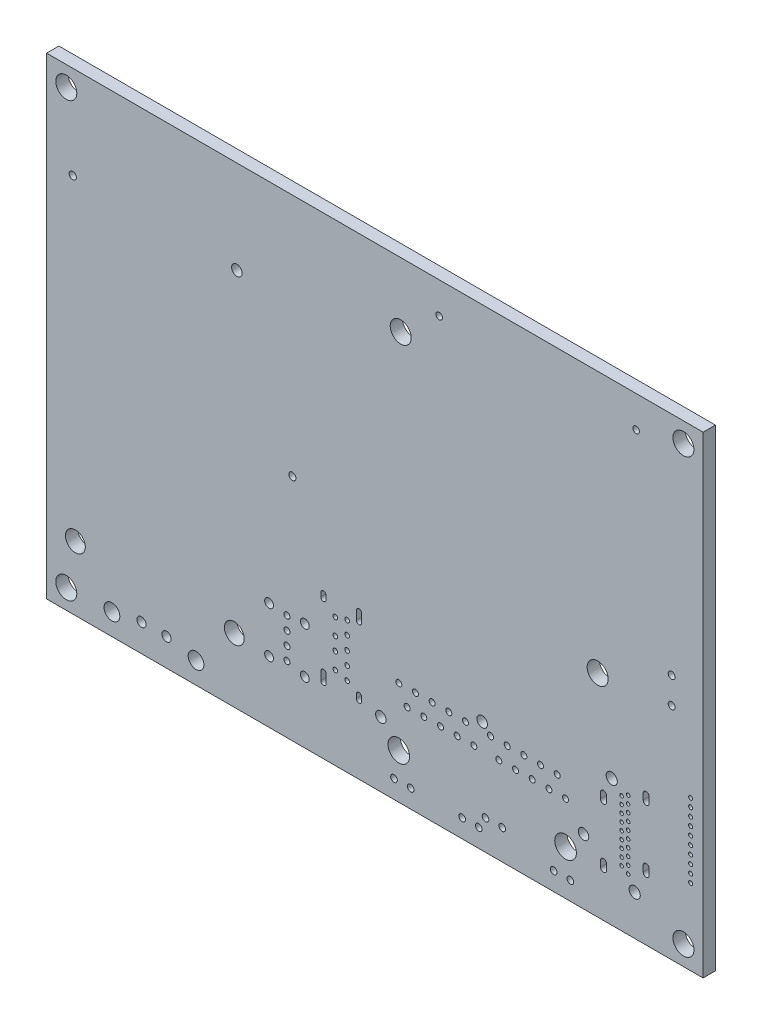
ISO-10303-21;
HEADER;
FILE_DESCRIPTION(('STEP AP214'),'2;1');
FILE_NAME('part.step','',(''),(''),'','','');
FILE_SCHEMA(('AUTOMOTIVE_DESIGN { 1 0 10303 214 1 1 1 1 }'));
ENDSEC;
DATA;
#1=APPLICATION_CONTEXT('core data for automotive mechanical design processes');
#2=APPLICATION_PROTOCOL_DEFINITION('international standard','automotive_design',2000,#1);
#3=PRODUCT_CONTEXT('',#1,'mechanical');
#4=PRODUCT('Part','Part','',(#3));
#5=PRODUCT_RELATED_PRODUCT_CATEGORY('part','',(#4));
#6=PRODUCT_DEFINITION_FORMATION('','',#4);
#7=PRODUCT_DEFINITION_CONTEXT('part definition',#1,'design');
#8=PRODUCT_DEFINITION('design','',#6,#7);
#9=PRODUCT_DEFINITION_SHAPE('','',#8);
#10=(LENGTH_UNIT() NAMED_UNIT(*) SI_UNIT(.MILLI.,.METRE.));
#11=(NAMED_UNIT(*) PLANE_ANGLE_UNIT() SI_UNIT($,.RADIAN.));
#12=(NAMED_UNIT(*) SI_UNIT($,.STERADIAN.) SOLID_ANGLE_UNIT());
#13=UNCERTAINTY_MEASURE_WITH_UNIT(LENGTH_MEASURE(1.E-05),#10,'distance_accuracy_value','');
#14=(GEOMETRIC_REPRESENTATION_CONTEXT(3) GLOBAL_UNCERTAINTY_ASSIGNED_CONTEXT((#13)) GLOBAL_UNIT_ASSIGNED_CONTEXT((#10,
#11,#12)) REPRESENTATION_CONTEXT('',''));
#15=CARTESIAN_POINT('',(0.,0.,0.));
#16=DIRECTION('',(0.,0.,1.));
#17=DIRECTION('',(1.,0.,0.));
#18=AXIS2_PLACEMENT_3D('',#15,#16,#17);
#19=CARTESIAN_POINT('',(1042.91686006,659.15129536,1.8752312));
#20=DIRECTION('',(1.,0.,0.));
#21=DIRECTION('',(0.,0.,-1.));
#22=AXIS2_PLACEMENT_3D('',#19,#20,#21);
#23=PLANE('',#22);
#24=DIRECTION('',(0.,-1.,0.));
#25=VECTOR('',#24,1.);
#26=CARTESIAN_POINT('',(1042.91686006,659.15129536,0.));
#27=LINE('',#26,#25);
#28=CARTESIAN_POINT('',(1042.91686006,659.15129536,0.));
#29=VERTEX_POINT('',#28);
#30=CARTESIAN_POINT('',(1042.91686006,587.15118536,0.));
#31=VERTEX_POINT('',#30);
#32=EDGE_CURVE('E1138',#29,#31,#27,.T.);
#33=ORIENTED_EDGE('',*,*,#32,.T.);
#34=DIRECTION('',(0.,0.,-1.));
#35=VECTOR('',#34,1.);
#36=CARTESIAN_POINT('',(1042.91686006,587.15118536,1.8752312));
#37=LINE('',#36,#35);
#38=CARTESIAN_POINT('',(1042.91686006,587.15118536,1.8752312));
#39=VERTEX_POINT('',#38);
#40=EDGE_CURVE('E11',#39,#31,#37,.T.);
#41=ORIENTED_EDGE('',*,*,#40,.F.);
#42=DIRECTION('',(0.,-1.,0.));
#43=VECTOR('',#42,1.);
#44=CARTESIAN_POINT('',(1042.91686006,659.15129536,1.8752312));
#45=LINE('',#44,#43);
#46=CARTESIAN_POINT('',(1042.91686006,659.15129536,1.8752312));
#47=VERTEX_POINT('',#46);
#48=EDGE_CURVE('E1139',#47,#39,#45,.T.);
#49=ORIENTED_EDGE('',*,*,#48,.F.);
#50=DIRECTION('',(0.,0.,-1.));
#51=VECTOR('',#50,1.);
#52=CARTESIAN_POINT('',(1042.91686006,659.15129536,1.8752312));
#53=LINE('',#52,#51);
#54=EDGE_CURVE('E1149',#47,#29,#53,.T.);
#55=ORIENTED_EDGE('',*,*,#54,.T.);
#56=EDGE_LOOP('',(#33,#41,#49,#55));
#57=FACE_BOUND('',#56,.T.);
#58=ADVANCED_FACE('F43',(#57),#23,.F.);
#59=CARTESIAN_POINT('',(1042.91686006,587.15118536,1.8752312));
#60=DIRECTION('',(0.,1.,0.));
#61=DIRECTION('',(0.,0.,1.));
#62=AXIS2_PLACEMENT_3D('',#59,#60,#61);
#63=PLANE('',#62);
#64=DIRECTION('',(1.,0.,0.));
#65=VECTOR('',#64,1.);
#66=CARTESIAN_POINT('',(1042.91686006,587.15118536,0.));
#67=LINE('',#66,#65);
#68=CARTESIAN_POINT('',(1142.91691406,587.15118536,0.));
#69=VERTEX_POINT('',#68);
#70=EDGE_CURVE('E1152',#31,#69,#67,.T.);
#71=ORIENTED_EDGE('',*,*,#70,.T.);
#72=DIRECTION('',(0.,0.,-1.));
#73=VECTOR('',#72,1.);
#74=CARTESIAN_POINT('',(1142.91691406,587.15118536,1.8752312));
#75=LINE('',#74,#73);
#76=CARTESIAN_POINT('',(1142.91691406,587.15118536,1.8752312));
#77=VERTEX_POINT('',#76);
#78=EDGE_CURVE('E50',#77,#69,#75,.T.);
#79=ORIENTED_EDGE('',*,*,#78,.F.);
#80=DIRECTION('',(1.,0.,0.));
#81=VECTOR('',#80,1.);
#82=CARTESIAN_POINT('',(1042.91686006,587.15118536,1.8752312));
#83=LINE('',#82,#81);
#84=EDGE_CURVE('E1142',#39,#77,#83,.T.);
#85=ORIENTED_EDGE('',*,*,#84,.F.);
#86=ORIENTED_EDGE('',*,*,#40,.T.);
#87=EDGE_LOOP('',(#71,#79,#85,#86));
#88=FACE_BOUND('',#87,.T.);
#89=ADVANCED_FACE('F1181',(#88),#63,.F.);
#90=CARTESIAN_POINT('',(1142.91691406,587.15118536,1.8752312));
#91=DIRECTION('',(-1.,0.,0.));
#92=DIRECTION('',(0.,0.,1.));
#93=AXIS2_PLACEMENT_3D('',#90,#91,#92);
#94=PLANE('',#93);
#95=DIRECTION('',(0.,1.,0.));
#96=VECTOR('',#95,1.);
#97=CARTESIAN_POINT('',(1142.91691406,587.15118536,0.));
#98=LINE('',#97,#96);
#99=CARTESIAN_POINT('',(1142.91691406,659.15129536,0.));
#100=VERTEX_POINT('',#99);
#101=EDGE_CURVE('E1154',#69,#100,#98,.T.);
#102=ORIENTED_EDGE('',*,*,#101,.T.);
#103=DIRECTION('',(0.,0.,-1.));
#104=VECTOR('',#103,1.);
#105=CARTESIAN_POINT('',(1142.91691406,659.15129536,1.8752312));
#106=LINE('',#105,#104);
#107=CARTESIAN_POINT('',(1142.91691406,659.15129536,1.8752312));
#108=VERTEX_POINT('',#107);
#109=EDGE_CURVE('E1159',#108,#100,#106,.T.);
#110=ORIENTED_EDGE('',*,*,#109,.F.);
#111=DIRECTION('',(0.,1.,0.));
#112=VECTOR('',#111,1.);
#113=CARTESIAN_POINT('',(1142.91691406,587.15118536,1.8752312));
#114=LINE('',#113,#112);
#115=EDGE_CURVE('E1145',#77,#108,#114,.T.);
#116=ORIENTED_EDGE('',*,*,#115,.F.);
#117=ORIENTED_EDGE('',*,*,#78,.T.);
#118=EDGE_LOOP('',(#102,#110,#116,#117));
#119=FACE_BOUND('',#118,.T.);
#120=ADVANCED_FACE('F1166',(#119),#94,.F.);
#121=CARTESIAN_POINT('',(1142.91691406,659.15129536,1.8752312));
#122=DIRECTION('',(0.,-1.,0.));
#123=DIRECTION('',(0.,0.,-1.));
#124=AXIS2_PLACEMENT_3D('',#121,#122,#123);
#125=PLANE('',#124);
#126=DIRECTION('',(-1.,0.,0.));
#127=VECTOR('',#126,1.);
#128=CARTESIAN_POINT('',(1142.91691406,659.15129536,0.));
#129=LINE('',#128,#127);
#130=EDGE_CURVE('E1143',#100,#29,#129,.T.);
#131=ORIENTED_EDGE('',*,*,#130,.T.);
#132=ORIENTED_EDGE('',*,*,#54,.F.);
#133=DIRECTION('',(-1.,0.,0.));
#134=VECTOR('',#133,1.);
#135=CARTESIAN_POINT('',(1142.91691406,659.15129536,1.8752312));
#136=LINE('',#135,#134);
#137=EDGE_CURVE('E1147',#108,#47,#136,.T.);
#138=ORIENTED_EDGE('',*,*,#137,.F.);
#139=ORIENTED_EDGE('',*,*,#109,.T.);
#140=EDGE_LOOP('',(#131,#132,#138,#139));
#141=FACE_BOUND('',#140,.T.);
#142=ADVANCED_FACE('F1174',(#141),#125,.F.);
#143=CARTESIAN_POINT('',(0.,0.,1.8752312));
#144=DIRECTION('',(0.,0.,1.));
#145=DIRECTION('',(1.,0.,0.));
#146=AXIS2_PLACEMENT_3D('',#143,#144,#145);
#147=PLANE('',#146);
#148=CARTESIAN_POINT('',(1134.24529056,606.0710891,1.8752312));
#149=DIRECTION('',(0.,0.,1.));
#150=DIRECTION('',(1.,0.,0.));
#151=AXIS2_PLACEMENT_3D('',#148,#149,#150);
#152=CIRCLE('',#151,0.457200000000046);
#153=CARTESIAN_POINT('',(1133.78809056,606.0710891,1.8752312));
#154=VERTEX_POINT('',#153);
#155=CARTESIAN_POINT('',(1134.70249056,606.0710891,1.8752312));
#156=VERTEX_POINT('',#155);
#157=EDGE_CURVE('E57',#154,#156,#152,.T.);
#158=ORIENTED_EDGE('',*,*,#157,.F.);
#159=DIRECTION('',(0.,-1.,0.));
#160=VECTOR('',#159,1.);
#161=CARTESIAN_POINT('',(1133.78809056,606.0710891,1.8752312));
#162=LINE('',#161,#160);
#163=CARTESIAN_POINT('',(1133.78809056,606.9600891,1.8752312));
#164=VERTEX_POINT('',#163);
#165=EDGE_CURVE('E418',#164,#154,#162,.T.);
#166=ORIENTED_EDGE('',*,*,#165,.F.);
#167=CARTESIAN_POINT('',(1134.24529056,606.9600891,1.8752312));
#168=DIRECTION('',(0.,0.,1.));
#169=DIRECTION('',(1.,0.,0.));
#170=AXIS2_PLACEMENT_3D('',#167,#168,#169);
#171=CIRCLE('',#170,0.457200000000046);
#172=CARTESIAN_POINT('',(1134.70249056,606.9600891,1.8752312));
#173=VERTEX_POINT('',#172);
#174=EDGE_CURVE('E432',#173,#164,#171,.T.);
#175=ORIENTED_EDGE('',*,*,#174,.F.);
#176=DIRECTION('',(0.,1.,0.));
#177=VECTOR('',#176,1.);
#178=CARTESIAN_POINT('',(1134.70249056,606.0710891,1.8752312));
#179=LINE('',#178,#177);
#180=EDGE_CURVE('E429',#156,#173,#179,.T.);
#181=ORIENTED_EDGE('',*,*,#180,.F.);
#182=EDGE_LOOP('',(#158,#166,#175,#181));
#183=FACE_BOUND('',#182,.T.);
#184=CARTESIAN_POINT('',(1085.0847488,597.25916616,1.8752312));
#185=DIRECTION('',(0.,0.,1.));
#186=DIRECTION('',(1.,0.,0.));
#187=AXIS2_PLACEMENT_3D('',#184,#185,#186);
#188=CIRCLE('',#187,0.406399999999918);
#189=CARTESIAN_POINT('',(1084.6783488,597.25916616,1.8752312));
#190=VERTEX_POINT('',#189);
#191=CARTESIAN_POINT('',(1085.4911488,597.25916616,1.8752312));
#192=VERTEX_POINT('',#191);
#193=EDGE_CURVE('E65',#190,#192,#188,.T.);
#194=ORIENTED_EDGE('',*,*,#193,.F.);
#195=DIRECTION('',(0.,-1.,0.));
#196=VECTOR('',#195,1.);
#197=CARTESIAN_POINT('',(1084.6783488,597.25916616,1.8752312));
#198=LINE('',#197,#196);
#199=CARTESIAN_POINT('',(1084.6783488,598.55456616,1.8752312));
#200=VERTEX_POINT('',#199);
#201=EDGE_CURVE('E386',#200,#190,#198,.T.);
#202=ORIENTED_EDGE('',*,*,#201,.F.);
#203=CARTESIAN_POINT('',(1085.0847488,598.55456616,1.8752312));
#204=DIRECTION('',(0.,0.,1.));
#205=DIRECTION('',(1.,0.,0.));
#206=AXIS2_PLACEMENT_3D('',#203,#204,#205);
#207=CIRCLE('',#206,0.406399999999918);
#208=CARTESIAN_POINT('',(1085.4911488,598.55456616,1.8752312));
#209=VERTEX_POINT('',#208);
#210=EDGE_CURVE('E401',#209,#200,#207,.T.);
#211=ORIENTED_EDGE('',*,*,#210,.F.);
#212=DIRECTION('',(0.,1.,0.));
#213=VECTOR('',#212,1.);
#214=CARTESIAN_POINT('',(1085.4911488,597.25916616,1.8752312));
#215=LINE('',#214,#213);
#216=EDGE_CURVE('E397',#192,#209,#215,.T.);
#217=ORIENTED_EDGE('',*,*,#216,.F.);
#218=EDGE_LOOP('',(#194,#202,#211,#217));
#219=FACE_BOUND('',#218,.T.);
#220=CARTESIAN_POINT('',(1090.50474812,597.61476616,1.8752312));
#221=DIRECTION('',(0.,0.,1.));
#222=DIRECTION('',(1.,0.,0.));
#223=AXIS2_PLACEMENT_3D('',#220,#221,#222);
#224=CIRCLE('',#223,0.406399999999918);
#225=CARTESIAN_POINT('',(1090.09834812,597.61476616,1.8752312));
#226=VERTEX_POINT('',#225);
#227=CARTESIAN_POINT('',(1090.91114812,597.61476616,1.8752312));
#228=VERTEX_POINT('',#227);
#229=EDGE_CURVE('E408',#226,#228,#224,.T.);
#230=ORIENTED_EDGE('',*,*,#229,.F.);
#231=DIRECTION('',(0.,-1.,0.));
#232=VECTOR('',#231,1.);
#233=CARTESIAN_POINT('',(1090.09834812,597.61476616,1.8752312));
#234=LINE('',#233,#232);
#235=CARTESIAN_POINT('',(1090.09834812,598.19896616,1.8752312));
#236=VERTEX_POINT('',#235);
#237=EDGE_CURVE('E481',#236,#226,#234,.T.);
#238=ORIENTED_EDGE('',*,*,#237,.F.);
#239=CARTESIAN_POINT('',(1090.50474812,598.19896616,1.8752312));
#240=DIRECTION('',(0.,0.,1.));
#241=DIRECTION('',(1.,0.,0.));
#242=AXIS2_PLACEMENT_3D('',#239,#240,#241);
#243=CIRCLE('',#242,0.406399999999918);
#244=CARTESIAN_POINT('',(1090.91114812,598.19896616,1.8752312));
#245=VERTEX_POINT('',#244);
#246=EDGE_CURVE('E495',#245,#236,#243,.T.);
#247=ORIENTED_EDGE('',*,*,#246,.F.);
#248=DIRECTION('',(0.,1.,0.));
#249=VECTOR('',#248,1.);
#250=CARTESIAN_POINT('',(1090.91114812,597.61476616,1.8752312));
#251=LINE('',#250,#249);
#252=EDGE_CURVE('E492',#228,#245,#251,.T.);
#253=ORIENTED_EDGE('',*,*,#252,.F.);
#254=EDGE_LOOP('',(#230,#238,#247,#253));
#255=FACE_BOUND('',#254,.T.);
#256=CARTESIAN_POINT('',(1090.50474812,607.95916508,1.8752312));
#257=DIRECTION('',(0.,0.,1.));
#258=DIRECTION('',(1.,0.,0.));
#259=AXIS2_PLACEMENT_3D('',#256,#257,#258);
#260=CIRCLE('',#259,0.406399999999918);
#261=CARTESIAN_POINT('',(1090.09834812,607.95916508,1.8752312));
#262=VERTEX_POINT('',#261);
#263=CARTESIAN_POINT('',(1090.91114812,607.95916508,1.8752312));
#264=VERTEX_POINT('',#263);
#265=EDGE_CURVE('E457',#262,#264,#260,.T.);
#266=ORIENTED_EDGE('',*,*,#265,.F.);
#267=DIRECTION('',(0.,-1.,0.));
#268=VECTOR('',#267,1.);
#269=CARTESIAN_POINT('',(1090.09834812,607.95916508,1.8752312));
#270=LINE('',#269,#268);
#271=CARTESIAN_POINT('',(1090.09834812,609.25456508,1.8752312));
#272=VERTEX_POINT('',#271);
#273=EDGE_CURVE('E447',#272,#262,#270,.T.);
#274=ORIENTED_EDGE('',*,*,#273,.F.);
#275=CARTESIAN_POINT('',(1090.50474812,609.25456508,1.8752312));
#276=DIRECTION('',(0.,0.,1.));
#277=DIRECTION('',(1.,0.,0.));
#278=AXIS2_PLACEMENT_3D('',#275,#276,#277);
#279=CIRCLE('',#278,0.406399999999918);
#280=CARTESIAN_POINT('',(1090.91114812,609.25456508,1.8752312));
#281=VERTEX_POINT('',#280);
#282=EDGE_CURVE('E463',#281,#272,#279,.T.);
#283=ORIENTED_EDGE('',*,*,#282,.F.);
#284=DIRECTION('',(0.,1.,0.));
#285=VECTOR('',#284,1.);
#286=CARTESIAN_POINT('',(1090.91114812,607.95916508,1.8752312));
#287=LINE('',#286,#285);
#288=EDGE_CURVE('E459',#264,#281,#287,.T.);
#289=ORIENTED_EDGE('',*,*,#288,.F.);
#290=EDGE_LOOP('',(#266,#274,#283,#289));
#291=FACE_BOUND('',#290,.T.);
#292=CARTESIAN_POINT('',(1127.74529086,602.97108768,1.8752312));
#293=DIRECTION('',(0.,0.,1.));
#294=DIRECTION('',(1.,0.,0.));
#295=AXIS2_PLACEMENT_3D('',#292,#293,#294);
#296=CIRCLE('',#295,0.457200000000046);
#297=CARTESIAN_POINT('',(1127.28809086,602.97108768,1.8752312));
#298=VERTEX_POINT('',#297);
#299=CARTESIAN_POINT('',(1128.20249086,602.97108768,1.8752312));
#300=VERTEX_POINT('',#299);
#301=EDGE_CURVE('E282',#298,#300,#296,.T.);
#302=ORIENTED_EDGE('',*,*,#301,.F.);
#303=DIRECTION('',(0.,-1.,0.));
#304=VECTOR('',#303,1.);
#305=CARTESIAN_POINT('',(1127.28809086,602.97108768,1.8752312));
#306=LINE('',#305,#304);
#307=CARTESIAN_POINT('',(1127.28809086,603.86008768,1.8752312));
#308=VERTEX_POINT('',#307);
#309=EDGE_CURVE('E300',#308,#298,#306,.T.);
#310=ORIENTED_EDGE('',*,*,#309,.F.);
#311=CARTESIAN_POINT('',(1127.74529086,603.86008768,1.8752312));
#312=DIRECTION('',(0.,0.,1.));
#313=DIRECTION('',(1.,0.,0.));
#314=AXIS2_PLACEMENT_3D('',#311,#312,#313);
#315=CIRCLE('',#314,0.457200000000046);
#316=CARTESIAN_POINT('',(1128.20249086,603.86008768,1.8752312));
#317=VERTEX_POINT('',#316);
#318=EDGE_CURVE('E303',#317,#308,#315,.T.);
#319=ORIENTED_EDGE('',*,*,#318,.F.);
#320=DIRECTION('',(0.,1.,0.));
#321=VECTOR('',#320,1.);
#322=CARTESIAN_POINT('',(1128.20249086,602.97108768,1.8752312));
#323=LINE('',#322,#321);
#324=EDGE_CURVE('E309',#300,#317,#323,.T.);
#325=ORIENTED_EDGE('',*,*,#324,.F.);
#326=EDGE_LOOP('',(#302,#310,#319,#325));
#327=FACE_BOUND('',#326,.T.);
#328=CARTESIAN_POINT('',(1127.74529086,593.9710879,1.8752312));
#329=DIRECTION('',(0.,0.,1.));
#330=DIRECTION('',(1.,0.,0.));
#331=AXIS2_PLACEMENT_3D('',#328,#329,#330);
#332=CIRCLE('',#331,0.457200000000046);
#333=CARTESIAN_POINT('',(1127.28809086,593.9710879,1.8752312));
#334=VERTEX_POINT('',#333);
#335=CARTESIAN_POINT('',(1128.20249086,593.9710879,1.8752312));
#336=VERTEX_POINT('',#335);
#337=EDGE_CURVE('E333',#334,#336,#332,.T.);
#338=ORIENTED_EDGE('',*,*,#337,.F.);
#339=DIRECTION('',(0.,-1.,0.));
#340=VECTOR('',#339,1.);
#341=CARTESIAN_POINT('',(1127.28809086,593.9710879,1.8752312));
#342=LINE('',#341,#340);
#343=CARTESIAN_POINT('',(1127.28809086,594.8600879,1.8752312));
#344=VERTEX_POINT('',#343);
#345=EDGE_CURVE('E323',#344,#334,#342,.T.);
#346=ORIENTED_EDGE('',*,*,#345,.F.);
#347=CARTESIAN_POINT('',(1127.74529086,594.8600879,1.8752312));
#348=DIRECTION('',(0.,0.,1.));
#349=DIRECTION('',(1.,0.,0.));
#350=AXIS2_PLACEMENT_3D('',#347,#348,#349);
#351=CIRCLE('',#350,0.457200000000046);
#352=CARTESIAN_POINT('',(1128.20249086,594.8600879,1.8752312));
#353=VERTEX_POINT('',#352);
#354=EDGE_CURVE('E339',#353,#344,#351,.T.);
#355=ORIENTED_EDGE('',*,*,#354,.F.);
#356=DIRECTION('',(0.,1.,0.));
#357=VECTOR('',#356,1.);
#358=CARTESIAN_POINT('',(1128.20249086,593.9710879,1.8752312));
#359=LINE('',#358,#357);
#360=EDGE_CURVE('E335',#336,#353,#359,.T.);
#361=ORIENTED_EDGE('',*,*,#360,.F.);
#362=EDGE_LOOP('',(#338,#346,#355,#361));
#363=FACE_BOUND('',#362,.T.);
#364=CARTESIAN_POINT('',(1134.24529056,596.57108778,1.8752312));
#365=DIRECTION('',(0.,0.,1.));
#366=DIRECTION('',(1.,0.,0.));
#367=AXIS2_PLACEMENT_3D('',#364,#365,#366);
#368=CIRCLE('',#367,0.457200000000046);
#369=CARTESIAN_POINT('',(1133.78809056,596.57108778,1.8752312));
#370=VERTEX_POINT('',#369);
#371=CARTESIAN_POINT('',(1134.70249056,596.57108778,1.8752312));
#372=VERTEX_POINT('',#371);
#373=EDGE_CURVE('E365',#370,#372,#368,.T.);
#374=ORIENTED_EDGE('',*,*,#373,.F.);
#375=DIRECTION('',(0.,-1.,0.));
#376=VECTOR('',#375,1.);
#377=CARTESIAN_POINT('',(1133.78809056,596.57108778,1.8752312));
#378=LINE('',#377,#376);
#379=CARTESIAN_POINT('',(1133.78809056,597.46008778,1.8752312));
#380=VERTEX_POINT('',#379);
#381=EDGE_CURVE('E355',#380,#370,#378,.T.);
#382=ORIENTED_EDGE('',*,*,#381,.F.);
#383=CARTESIAN_POINT('',(1134.24529056,597.46008778,1.8752312));
#384=DIRECTION('',(0.,0.,1.));
#385=DIRECTION('',(1.,0.,0.));
#386=AXIS2_PLACEMENT_3D('',#383,#384,#385);
#387=CIRCLE('',#386,0.457200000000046);
#388=CARTESIAN_POINT('',(1134.70249056,597.46008778,1.8752312));
#389=VERTEX_POINT('',#388);
#390=EDGE_CURVE('E370',#389,#380,#387,.T.);
#391=ORIENTED_EDGE('',*,*,#390,.F.);
#392=DIRECTION('',(0.,1.,0.));
#393=VECTOR('',#392,1.);
#394=CARTESIAN_POINT('',(1134.70249056,596.57108778,1.8752312));
#395=LINE('',#394,#393);
#396=EDGE_CURVE('E367',#372,#389,#395,.T.);
#397=ORIENTED_EDGE('',*,*,#396,.F.);
#398=EDGE_LOOP('',(#374,#382,#391,#397));
#399=FACE_BOUND('',#398,.T.);
#400=CARTESIAN_POINT('',(1085.0847488,608.31476508,1.8752312));
#401=DIRECTION('',(0.,0.,1.));
#402=DIRECTION('',(1.,0.,0.));
#403=AXIS2_PLACEMENT_3D('',#400,#401,#402);
#404=CIRCLE('',#403,0.406399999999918);
#405=CARTESIAN_POINT('',(1084.6783488,608.31476508,1.8752312));
#406=VERTEX_POINT('',#405);
#407=CARTESIAN_POINT('',(1085.4911488,608.31476508,1.8752312));
#408=VERTEX_POINT('',#407);
#409=EDGE_CURVE('E470',#406,#408,#404,.T.);
#410=ORIENTED_EDGE('',*,*,#409,.F.);
#411=DIRECTION('',(0.,-1.,0.));
#412=VECTOR('',#411,1.);
#413=CARTESIAN_POINT('',(1084.6783488,608.31476508,1.8752312));
#414=LINE('',#413,#412);
#415=CARTESIAN_POINT('',(1084.6783488,608.89896508,1.8752312));
#416=VERTEX_POINT('',#415);
#417=EDGE_CURVE('E511',#416,#406,#414,.T.);
#418=ORIENTED_EDGE('',*,*,#417,.F.);
#419=CARTESIAN_POINT('',(1085.0847488,608.89896508,1.8752312));
#420=DIRECTION('',(0.,0.,1.));
#421=DIRECTION('',(1.,0.,0.));
#422=AXIS2_PLACEMENT_3D('',#419,#420,#421);
#423=CIRCLE('',#422,0.406399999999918);
#424=CARTESIAN_POINT('',(1085.4911488,608.89896508,1.8752312));
#425=VERTEX_POINT('',#424);
#426=EDGE_CURVE('E525',#425,#416,#423,.T.);
#427=ORIENTED_EDGE('',*,*,#426,.F.);
#428=DIRECTION('',(0.,1.,0.));
#429=VECTOR('',#428,1.);
#430=CARTESIAN_POINT('',(1085.4911488,608.31476508,1.8752312));
#431=LINE('',#430,#429);
#432=EDGE_CURVE('E522',#408,#425,#431,.T.);
#433=ORIENTED_EDGE('',*,*,#432,.F.);
#434=EDGE_LOOP('',(#410,#418,#427,#433));
#435=FACE_BOUND('',#434,.T.);
#436=CARTESIAN_POINT('',(1096.85568538,649.3439134,1.87523119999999));
#437=DIRECTION('',(0.,0.,-1.));
#438=DIRECTION('',(-1.,0.,0.));
#439=AXIS2_PLACEMENT_3D('',#436,#437,#438);
#440=CIRCLE('',#439,1.60019999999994);
#441=CARTESIAN_POINT('',(1095.25548538,649.3439134,1.87523119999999));
#442=VERTEX_POINT('',#441);
#443=EDGE_CURVE('E541',#442,#442,#440,.T.);
#444=ORIENTED_EDGE('',*,*,#443,.T.);
#445=EDGE_LOOP('',(#444));
#446=FACE_BOUND('',#445,.T.);
#447=CARTESIAN_POINT('',(1126.85543996,619.34417152,1.87523119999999));
#448=DIRECTION('',(0.,0.,-1.));
#449=DIRECTION('',(-1.,0.,0.));
#450=AXIS2_PLACEMENT_3D('',#447,#448,#449);
#451=CIRCLE('',#450,1.60019999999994);
#452=CARTESIAN_POINT('',(1125.25523996,619.34417152,1.87523119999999));
#453=VERTEX_POINT('',#452);
#454=EDGE_CURVE('E547',#453,#453,#451,.T.);
#455=ORIENTED_EDGE('',*,*,#454,.T.);
#456=EDGE_LOOP('',(#455));
#457=FACE_BOUND('',#456,.T.);
#458=CARTESIAN_POINT('',(1139.91816974,590.15186516,1.87523119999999));
#459=DIRECTION('',(0.,0.,-1.));
#460=DIRECTION('',(-1.,0.,0.));
#461=AXIS2_PLACEMENT_3D('',#458,#459,#460);
#462=CIRCLE('',#461,1.60019999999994);
#463=CARTESIAN_POINT('',(1138.31796974,590.15186516,1.87523119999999));
#464=VERTEX_POINT('',#463);
#465=EDGE_CURVE('E553',#464,#464,#462,.T.);
#466=ORIENTED_EDGE('',*,*,#465,.T.);
#467=EDGE_LOOP('',(#466));
#468=FACE_BOUND('',#467,.T.);
#469=CARTESIAN_POINT('',(1045.91685406,590.15117936,1.87523119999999));
#470=DIRECTION('',(0.,0.,-1.));
#471=DIRECTION('',(-1.,0.,0.));
#472=AXIS2_PLACEMENT_3D('',#469,#470,#471);
#473=CIRCLE('',#472,1.60019999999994);
#474=CARTESIAN_POINT('',(1044.31665406,590.15117936,1.87523119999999));
#475=VERTEX_POINT('',#474);
#476=EDGE_CURVE('E559',#475,#475,#473,.T.);
#477=ORIENTED_EDGE('',*,*,#476,.T.);
#478=EDGE_LOOP('',(#477));
#479=FACE_BOUND('',#478,.T.);
#480=CARTESIAN_POINT('',(1139.91714866,656.15104736,1.87523119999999));
#481=DIRECTION('',(0.,0.,-1.));
#482=DIRECTION('',(-1.,0.,0.));
#483=AXIS2_PLACEMENT_3D('',#480,#481,#482);
#484=CIRCLE('',#483,1.60019999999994);
#485=CARTESIAN_POINT('',(1138.31694866,656.15104736,1.87523119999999));
#486=VERTEX_POINT('',#485);
#487=EDGE_CURVE('E565',#486,#486,#484,.T.);
#488=ORIENTED_EDGE('',*,*,#487,.T.);
#489=EDGE_LOOP('',(#488));
#490=FACE_BOUND('',#489,.T.);
#491=CARTESIAN_POINT('',(1045.91685406,656.15105752,1.87523119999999));
#492=DIRECTION('',(0.,0.,-1.));
#493=DIRECTION('',(-1.,0.,0.));
#494=AXIS2_PLACEMENT_3D('',#491,#492,#493);
#495=CIRCLE('',#494,1.60019999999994);
#496=CARTESIAN_POINT('',(1044.31665406,656.15105752,1.87523119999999));
#497=VERTEX_POINT('',#496);
#498=EDGE_CURVE('E571',#497,#497,#495,.T.);
#499=ORIENTED_EDGE('',*,*,#498,.T.);
#500=EDGE_LOOP('',(#499));
#501=FACE_BOUND('',#500,.T.);
#502=CARTESIAN_POINT('',(1080.35646006,622.05078536,1.87523119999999));
#503=DIRECTION('',(0.,0.,-1.));
#504=DIRECTION('',(-1.,0.,0.));
#505=AXIS2_PLACEMENT_3D('',#502,#503,#504);
#506=CIRCLE('',#505,0.546099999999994);
#507=CARTESIAN_POINT('',(1079.81036006,622.05078536,1.87523119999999));
#508=VERTEX_POINT('',#507);
#509=EDGE_CURVE('E577',#508,#508,#506,.T.);
#510=ORIENTED_EDGE('',*,*,#509,.T.);
#511=EDGE_LOOP('',(#510));
#512=FACE_BOUND('',#511,.T.);
#513=CARTESIAN_POINT('',(1095.8351718,589.93021714,1.87523119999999));
#514=DIRECTION('',(0.,0.,-1.));
#515=DIRECTION('',(-1.,0.,0.));
#516=AXIS2_PLACEMENT_3D('',#513,#514,#515);
#517=CIRCLE('',#516,0.507999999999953);
#518=CARTESIAN_POINT('',(1095.3271718,589.93021714,1.87523119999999));
#519=VERTEX_POINT('',#518);
#520=EDGE_CURVE('E583',#519,#519,#517,.T.);
#521=ORIENTED_EDGE('',*,*,#520,.T.);
#522=EDGE_LOOP('',(#521));
#523=FACE_BOUND('',#522,.T.);
#524=CARTESIAN_POINT('',(1098.3751718,589.93021714,1.87523119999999));
#525=DIRECTION('',(0.,0.,-1.));
#526=DIRECTION('',(-1.,0.,0.));
#527=AXIS2_PLACEMENT_3D('',#524,#525,#526);
#528=CIRCLE('',#527,0.507999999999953);
#529=CARTESIAN_POINT('',(1097.8671718,589.93021714,1.87523119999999));
#530=VERTEX_POINT('',#529);
#531=EDGE_CURVE('E589',#530,#530,#528,.T.);
#532=ORIENTED_EDGE('',*,*,#531,.T.);
#533=EDGE_LOOP('',(#532));
#534=FACE_BOUND('',#533,.T.);
#535=CARTESIAN_POINT('',(1106.21517136,589.93021714,1.87523119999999));
#536=DIRECTION('',(0.,0.,-1.));
#537=DIRECTION('',(-1.,0.,0.));
#538=AXIS2_PLACEMENT_3D('',#535,#536,#537);
#539=CIRCLE('',#538,0.507999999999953);
#540=CARTESIAN_POINT('',(1105.70717136,589.93021714,1.87523119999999));
#541=VERTEX_POINT('',#540);
#542=EDGE_CURVE('E595',#541,#541,#539,.T.);
#543=ORIENTED_EDGE('',*,*,#542,.T.);
#544=EDGE_LOOP('',(#543));
#545=FACE_BOUND('',#544,.T.);
#546=CARTESIAN_POINT('',(1108.75517136,589.93021714,1.87523119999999));
#547=DIRECTION('',(0.,0.,-1.));
#548=DIRECTION('',(-1.,0.,0.));
#549=AXIS2_PLACEMENT_3D('',#546,#547,#548);
#550=CIRCLE('',#549,0.507999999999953);
#551=CARTESIAN_POINT('',(1108.24717136,589.93021714,1.87523119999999));
#552=VERTEX_POINT('',#551);
#553=EDGE_CURVE('E601',#552,#552,#550,.T.);
#554=ORIENTED_EDGE('',*,*,#553,.T.);
#555=EDGE_LOOP('',(#554));
#556=FACE_BOUND('',#555,.T.);
#557=CARTESIAN_POINT('',(1109.77517186,591.70021614,1.87523119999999));
#558=DIRECTION('',(0.,0.,-1.));
#559=DIRECTION('',(-1.,0.,0.));
#560=AXIS2_PLACEMENT_3D('',#557,#558,#559);
#561=CIRCLE('',#560,0.507999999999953);
#562=CARTESIAN_POINT('',(1109.26717186,591.70021614,1.87523119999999));
#563=VERTEX_POINT('',#562);
#564=EDGE_CURVE('E607',#563,#563,#561,.T.);
#565=ORIENTED_EDGE('',*,*,#564,.T.);
#566=EDGE_LOOP('',(#565));
#567=FACE_BOUND('',#566,.T.);
#568=CARTESIAN_POINT('',(1112.31517186,591.70021614,1.87523119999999));
#569=DIRECTION('',(0.,0.,-1.));
#570=DIRECTION('',(-1.,0.,0.));
#571=AXIS2_PLACEMENT_3D('',#568,#569,#570);
#572=CIRCLE('',#571,0.507999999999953);
#573=CARTESIAN_POINT('',(1111.80717186,591.70021614,1.87523119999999));
#574=VERTEX_POINT('',#573);
#575=EDGE_CURVE('E613',#574,#574,#572,.T.);
#576=ORIENTED_EDGE('',*,*,#575,.T.);
#577=EDGE_LOOP('',(#576));
#578=FACE_BOUND('',#577,.T.);
#579=CARTESIAN_POINT('',(1122.69517142,589.93021714,1.87523119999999));
#580=DIRECTION('',(0.,0.,-1.));
#581=DIRECTION('',(-1.,0.,0.));
#582=AXIS2_PLACEMENT_3D('',#579,#580,#581);
#583=CIRCLE('',#582,0.507999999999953);
#584=CARTESIAN_POINT('',(1122.18717142,589.93021714,1.87523119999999));
#585=VERTEX_POINT('',#584);
#586=EDGE_CURVE('E619',#585,#585,#583,.T.);
#587=ORIENTED_EDGE('',*,*,#586,.T.);
#588=EDGE_LOOP('',(#587));
#589=FACE_BOUND('',#588,.T.);
#590=CARTESIAN_POINT('',(1120.15517396,589.93021714,1.87523119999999));
#591=DIRECTION('',(0.,0.,-1.));
#592=DIRECTION('',(-1.,0.,0.));
#593=AXIS2_PLACEMENT_3D('',#590,#591,#592);
#594=CIRCLE('',#593,0.507999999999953);
#595=CARTESIAN_POINT('',(1119.64717396,589.93021714,1.87523119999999));
#596=VERTEX_POINT('',#595);
#597=EDGE_CURVE('E625',#596,#596,#594,.T.);
#598=ORIENTED_EDGE('',*,*,#597,.T.);
#599=EDGE_LOOP('',(#598));
#600=FACE_BOUND('',#599,.T.);
#601=CARTESIAN_POINT('',(1093.82517328,597.04021562,1.87523119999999));
#602=DIRECTION('',(0.,0.,-1.));
#603=DIRECTION('',(-1.,0.,0.));
#604=AXIS2_PLACEMENT_3D('',#601,#602,#603);
#605=CIRCLE('',#604,0.80009999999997);
#606=CARTESIAN_POINT('',(1093.02507328,597.04021562,1.87523119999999));
#607=VERTEX_POINT('',#606);
#608=EDGE_CURVE('E631',#607,#607,#605,.T.);
#609=ORIENTED_EDGE('',*,*,#608,.T.);
#610=EDGE_LOOP('',(#609));
#611=FACE_BOUND('',#610,.T.);
#612=CARTESIAN_POINT('',(1124.70517248,597.04021562,1.87523119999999));
#613=DIRECTION('',(0.,0.,-1.));
#614=DIRECTION('',(-1.,0.,0.));
#615=AXIS2_PLACEMENT_3D('',#612,#613,#614);
#616=CIRCLE('',#615,0.80009999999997);
#617=CARTESIAN_POINT('',(1123.90507248,597.04021562,1.87523119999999));
#618=VERTEX_POINT('',#617);
#619=EDGE_CURVE('E637',#618,#618,#616,.T.);
#620=ORIENTED_EDGE('',*,*,#619,.T.);
#621=EDGE_LOOP('',(#620));
#622=FACE_BOUND('',#621,.T.);
#623=CARTESIAN_POINT('',(1109.26517288,604.15021664,1.87523119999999));
#624=DIRECTION('',(0.,0.,-1.));
#625=DIRECTION('',(-1.,0.,0.));
#626=AXIS2_PLACEMENT_3D('',#623,#624,#625);
#627=CIRCLE('',#626,0.80009999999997);
#628=CARTESIAN_POINT('',(1108.46507288,604.15021664,1.87523119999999));
#629=VERTEX_POINT('',#628);
#630=EDGE_CURVE('E643',#629,#629,#627,.T.);
#631=ORIENTED_EDGE('',*,*,#630,.T.);
#632=EDGE_LOOP('',(#631));
#633=FACE_BOUND('',#632,.T.);
#634=CARTESIAN_POINT('',(1096.56517288,593.99021664,1.87523119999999));
#635=DIRECTION('',(0.,0.,-1.));
#636=DIRECTION('',(-1.,0.,0.));
#637=AXIS2_PLACEMENT_3D('',#634,#635,#636);
#638=CIRCLE('',#637,1.65100000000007);
#639=CARTESIAN_POINT('',(1094.91417288,593.99021664,1.87523119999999));
#640=VERTEX_POINT('',#639);
#641=EDGE_CURVE('E649',#640,#640,#638,.T.);
#642=ORIENTED_EDGE('',*,*,#641,.T.);
#643=EDGE_LOOP('',(#642));
#644=FACE_BOUND('',#643,.T.);
#645=CARTESIAN_POINT('',(1121.96517288,593.99021664,1.87523119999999));
#646=DIRECTION('',(0.,0.,-1.));
#647=DIRECTION('',(-1.,0.,0.));
#648=AXIS2_PLACEMENT_3D('',#645,#646,#647);
#649=CIRCLE('',#648,1.65100000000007);
#650=CARTESIAN_POINT('',(1120.31417288,593.99021664,1.87523119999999));
#651=VERTEX_POINT('',#650);
#652=EDGE_CURVE('E655',#651,#651,#649,.T.);
#653=ORIENTED_EDGE('',*,*,#652,.T.);
#654=EDGE_LOOP('',(#653));
#655=FACE_BOUND('',#654,.T.);
#656=CARTESIAN_POINT('',(1110.53517288,602.88021664,1.87523119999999));
#657=DIRECTION('',(0.,0.,-1.));
#658=DIRECTION('',(-1.,0.,0.));
#659=AXIS2_PLACEMENT_3D('',#656,#657,#658);
#660=CIRCLE('',#659,0.457200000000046);
#661=CARTESIAN_POINT('',(1110.07797288,602.88021664,1.87523119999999));
#662=VERTEX_POINT('',#661);
#663=EDGE_CURVE('E661',#662,#662,#660,.T.);
#664=ORIENTED_EDGE('',*,*,#663,.T.);
#665=EDGE_LOOP('',(#664));
#666=FACE_BOUND('',#665,.T.);
#667=CARTESIAN_POINT('',(1099.10517288,602.88021664,1.87523119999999));
#668=DIRECTION('',(0.,0.,-1.));
#669=DIRECTION('',(-1.,0.,0.));
#670=AXIS2_PLACEMENT_3D('',#667,#668,#669);
#671=CIRCLE('',#670,0.457200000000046);
#672=CARTESIAN_POINT('',(1098.64797288,602.88021664,1.87523119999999));
#673=VERTEX_POINT('',#672);
#674=EDGE_CURVE('E667',#673,#673,#671,.T.);
#675=ORIENTED_EDGE('',*,*,#674,.T.);
#676=EDGE_LOOP('',(#675));
#677=FACE_BOUND('',#676,.T.);
#678=CARTESIAN_POINT('',(1101.64517288,602.88021664,1.87523119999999));
#679=DIRECTION('',(0.,0.,-1.));
#680=DIRECTION('',(-1.,0.,0.));
#681=AXIS2_PLACEMENT_3D('',#678,#679,#680);
#682=CIRCLE('',#681,0.457200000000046);
#683=CARTESIAN_POINT('',(1101.18797288,602.88021664,1.87523119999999));
#684=VERTEX_POINT('',#683);
#685=EDGE_CURVE('E673',#684,#684,#682,.T.);
#686=ORIENTED_EDGE('',*,*,#685,.T.);
#687=EDGE_LOOP('',(#686));
#688=FACE_BOUND('',#687,.T.);
#689=CARTESIAN_POINT('',(1104.18517288,602.88021664,1.87523119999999));
#690=DIRECTION('',(0.,0.,-1.));
#691=DIRECTION('',(-1.,0.,0.));
#692=AXIS2_PLACEMENT_3D('',#689,#690,#691);
#693=CIRCLE('',#692,0.457200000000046);
#694=CARTESIAN_POINT('',(1103.72797288,602.88021664,1.87523119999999));
#695=VERTEX_POINT('',#694);
#696=EDGE_CURVE('E679',#695,#695,#693,.T.);
#697=ORIENTED_EDGE('',*,*,#696,.T.);
#698=EDGE_LOOP('',(#697));
#699=FACE_BOUND('',#698,.T.);
#700=CARTESIAN_POINT('',(1097.83517288,600.34021664,1.87523119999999));
#701=DIRECTION('',(0.,0.,-1.));
#702=DIRECTION('',(-1.,0.,0.));
#703=AXIS2_PLACEMENT_3D('',#700,#701,#702);
#704=CIRCLE('',#703,0.457200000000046);
#705=CARTESIAN_POINT('',(1097.37797288,600.34021664,1.87523119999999));
#706=VERTEX_POINT('',#705);
#707=EDGE_CURVE('E685',#706,#706,#704,.T.);
#708=ORIENTED_EDGE('',*,*,#707,.T.);
#709=EDGE_LOOP('',(#708));
#710=FACE_BOUND('',#709,.T.);
#711=CARTESIAN_POINT('',(1100.37517288,600.34021664,1.87523119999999));
#712=DIRECTION('',(0.,0.,-1.));
#713=DIRECTION('',(-1.,0.,0.));
#714=AXIS2_PLACEMENT_3D('',#711,#712,#713);
#715=CIRCLE('',#714,0.457200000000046);
#716=CARTESIAN_POINT('',(1099.91797288,600.34021664,1.87523119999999));
#717=VERTEX_POINT('',#716);
#718=EDGE_CURVE('E691',#717,#717,#715,.T.);
#719=ORIENTED_EDGE('',*,*,#718,.T.);
#720=EDGE_LOOP('',(#719));
#721=FACE_BOUND('',#720,.T.);
#722=CARTESIAN_POINT('',(1102.91517288,600.34021664,1.87523119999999));
#723=DIRECTION('',(0.,0.,-1.));
#724=DIRECTION('',(-1.,0.,0.));
#725=AXIS2_PLACEMENT_3D('',#722,#723,#724);
#726=CIRCLE('',#725,0.457200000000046);
#727=CARTESIAN_POINT('',(1102.45797288,600.34021664,1.87523119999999));
#728=VERTEX_POINT('',#727);
#729=EDGE_CURVE('E697',#728,#728,#726,.T.);
#730=ORIENTED_EDGE('',*,*,#729,.T.);
#731=EDGE_LOOP('',(#730));
#732=FACE_BOUND('',#731,.T.);
#733=CARTESIAN_POINT('',(1107.99517288,600.34021664,1.87523119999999));
#734=DIRECTION('',(0.,0.,-1.));
#735=DIRECTION('',(-1.,0.,0.));
#736=AXIS2_PLACEMENT_3D('',#733,#734,#735);
#737=CIRCLE('',#736,0.457200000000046);
#738=CARTESIAN_POINT('',(1107.53797288,600.34021664,1.87523119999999));
#739=VERTEX_POINT('',#738);
#740=EDGE_CURVE('E703',#739,#739,#737,.T.);
#741=ORIENTED_EDGE('',*,*,#740,.T.);
#742=EDGE_LOOP('',(#741));
#743=FACE_BOUND('',#742,.T.);
#744=CARTESIAN_POINT('',(1096.56517288,602.88021664,1.87523119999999));
#745=DIRECTION('',(0.,0.,-1.));
#746=DIRECTION('',(-1.,0.,0.));
#747=AXIS2_PLACEMENT_3D('',#744,#745,#746);
#748=CIRCLE('',#747,0.457200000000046);
#749=CARTESIAN_POINT('',(1096.10797288,602.88021664,1.87523119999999));
#750=VERTEX_POINT('',#749);
#751=EDGE_CURVE('E709',#750,#750,#748,.T.);
#752=ORIENTED_EDGE('',*,*,#751,.T.);
#753=EDGE_LOOP('',(#752));
#754=FACE_BOUND('',#753,.T.);
#755=CARTESIAN_POINT('',(1113.07517288,602.88021664,1.87523119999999));
#756=DIRECTION('',(0.,0.,-1.));
#757=DIRECTION('',(-1.,0.,0.));
#758=AXIS2_PLACEMENT_3D('',#755,#756,#757);
#759=CIRCLE('',#758,0.457200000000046);
#760=CARTESIAN_POINT('',(1112.61797288,602.88021664,1.87523119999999));
#761=VERTEX_POINT('',#760);
#762=EDGE_CURVE('E715',#761,#761,#759,.T.);
#763=ORIENTED_EDGE('',*,*,#762,.T.);
#764=EDGE_LOOP('',(#763));
#765=FACE_BOUND('',#764,.T.);
#766=CARTESIAN_POINT('',(1115.61517288,602.88021664,1.87523119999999));
#767=DIRECTION('',(0.,0.,-1.));
#768=DIRECTION('',(-1.,0.,0.));
#769=AXIS2_PLACEMENT_3D('',#766,#767,#768);
#770=CIRCLE('',#769,0.457200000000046);
#771=CARTESIAN_POINT('',(1115.15797288,602.88021664,1.87523119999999));
#772=VERTEX_POINT('',#771);
#773=EDGE_CURVE('E721',#772,#772,#770,.T.);
#774=ORIENTED_EDGE('',*,*,#773,.T.);
#775=EDGE_LOOP('',(#774));
#776=FACE_BOUND('',#775,.T.);
#777=CARTESIAN_POINT('',(1118.15517288,602.88021664,1.87523119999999));
#778=DIRECTION('',(0.,0.,-1.));
#779=DIRECTION('',(-1.,0.,0.));
#780=AXIS2_PLACEMENT_3D('',#777,#778,#779);
#781=CIRCLE('',#780,0.457200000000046);
#782=CARTESIAN_POINT('',(1117.69797288,602.88021664,1.87523119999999));
#783=VERTEX_POINT('',#782);
#784=EDGE_CURVE('E727',#783,#783,#781,.T.);
#785=ORIENTED_EDGE('',*,*,#784,.T.);
#786=EDGE_LOOP('',(#785));
#787=FACE_BOUND('',#786,.T.);
#788=CARTESIAN_POINT('',(1120.69517288,602.88021664,1.87523119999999));
#789=DIRECTION('',(0.,0.,-1.));
#790=DIRECTION('',(-1.,0.,0.));
#791=AXIS2_PLACEMENT_3D('',#788,#789,#790);
#792=CIRCLE('',#791,0.457200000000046);
#793=CARTESIAN_POINT('',(1120.23797288,602.88021664,1.87523119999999));
#794=VERTEX_POINT('',#793);
#795=EDGE_CURVE('E733',#794,#794,#792,.T.);
#796=ORIENTED_EDGE('',*,*,#795,.T.);
#797=EDGE_LOOP('',(#796));
#798=FACE_BOUND('',#797,.T.);
#799=CARTESIAN_POINT('',(1111.80517288,600.34021664,1.87523119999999));
#800=DIRECTION('',(0.,0.,-1.));
#801=DIRECTION('',(-1.,0.,0.));
#802=AXIS2_PLACEMENT_3D('',#799,#800,#801);
#803=CIRCLE('',#802,0.457200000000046);
#804=CARTESIAN_POINT('',(1111.34797288,600.34021664,1.87523119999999));
#805=VERTEX_POINT('',#804);
#806=EDGE_CURVE('E739',#805,#805,#803,.T.);
#807=ORIENTED_EDGE('',*,*,#806,.T.);
#808=EDGE_LOOP('',(#807));
#809=FACE_BOUND('',#808,.T.);
#810=CARTESIAN_POINT('',(1114.34517288,600.34021664,1.87523119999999));
#811=DIRECTION('',(0.,0.,-1.));
#812=DIRECTION('',(-1.,0.,0.));
#813=AXIS2_PLACEMENT_3D('',#810,#811,#812);
#814=CIRCLE('',#813,0.457200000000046);
#815=CARTESIAN_POINT('',(1113.88797288,600.34021664,1.87523119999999));
#816=VERTEX_POINT('',#815);
#817=EDGE_CURVE('E745',#816,#816,#814,.T.);
#818=ORIENTED_EDGE('',*,*,#817,.T.);
#819=EDGE_LOOP('',(#818));
#820=FACE_BOUND('',#819,.T.);
#821=CARTESIAN_POINT('',(1116.88517288,600.34021664,1.87523119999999));
#822=DIRECTION('',(0.,0.,-1.));
#823=DIRECTION('',(-1.,0.,0.));
#824=AXIS2_PLACEMENT_3D('',#821,#822,#823);
#825=CIRCLE('',#824,0.457200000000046);
#826=CARTESIAN_POINT('',(1116.42797288,600.34021664,1.87523119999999));
#827=VERTEX_POINT('',#826);
#828=EDGE_CURVE('E751',#827,#827,#825,.T.);
#829=ORIENTED_EDGE('',*,*,#828,.T.);
#830=EDGE_LOOP('',(#829));
#831=FACE_BOUND('',#830,.T.);
#832=CARTESIAN_POINT('',(1119.42517288,600.34021664,1.87523119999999));
#833=DIRECTION('',(0.,0.,-1.));
#834=DIRECTION('',(-1.,0.,0.));
#835=AXIS2_PLACEMENT_3D('',#832,#833,#834);
#836=CIRCLE('',#835,0.457200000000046);
#837=CARTESIAN_POINT('',(1118.96797288,600.34021664,1.87523119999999));
#838=VERTEX_POINT('',#837);
#839=EDGE_CURVE('E757',#838,#838,#836,.T.);
#840=ORIENTED_EDGE('',*,*,#839,.T.);
#841=EDGE_LOOP('',(#840));
#842=FACE_BOUND('',#841,.T.);
#843=CARTESIAN_POINT('',(1121.96517288,600.34021664,1.87523119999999));
#844=DIRECTION('',(0.,0.,-1.));
#845=DIRECTION('',(-1.,0.,0.));
#846=AXIS2_PLACEMENT_3D('',#843,#844,#845);
#847=CIRCLE('',#846,0.457200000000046);
#848=CARTESIAN_POINT('',(1121.50797288,600.34021664,1.87523119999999));
#849=VERTEX_POINT('',#848);
#850=EDGE_CURVE('E763',#849,#849,#847,.T.);
#851=ORIENTED_EDGE('',*,*,#850,.T.);
#852=EDGE_LOOP('',(#851));
#853=FACE_BOUND('',#852,.T.);
#854=CARTESIAN_POINT('',(1106.72517288,602.88021664,1.87523119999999));
#855=DIRECTION('',(0.,0.,-1.));
#856=DIRECTION('',(-1.,0.,0.));
#857=AXIS2_PLACEMENT_3D('',#854,#855,#856);
#858=CIRCLE('',#857,0.457200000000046);
#859=CARTESIAN_POINT('',(1106.26797288,602.88021664,1.87523119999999));
#860=VERTEX_POINT('',#859);
#861=EDGE_CURVE('E769',#860,#860,#858,.T.);
#862=ORIENTED_EDGE('',*,*,#861,.T.);
#863=EDGE_LOOP('',(#862));
#864=FACE_BOUND('',#863,.T.);
#865=CARTESIAN_POINT('',(1105.45517288,600.34021664,1.87523119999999));
#866=DIRECTION('',(0.,0.,-1.));
#867=DIRECTION('',(-1.,0.,0.));
#868=AXIS2_PLACEMENT_3D('',#865,#866,#867);
#869=CIRCLE('',#868,0.457200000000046);
#870=CARTESIAN_POINT('',(1104.99797288,600.34021664,1.87523119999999));
#871=VERTEX_POINT('',#870);
#872=EDGE_CURVE('E775',#871,#871,#869,.T.);
#873=ORIENTED_EDGE('',*,*,#872,.T.);
#874=EDGE_LOOP('',(#873));
#875=FACE_BOUND('',#874,.T.);
#876=CARTESIAN_POINT('',(1061.18159366,591.32956156,1.87523119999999));
#877=DIRECTION('',(0.,0.,-1.));
#878=DIRECTION('',(-1.,0.,0.));
#879=AXIS2_PLACEMENT_3D('',#876,#877,#878);
#880=CIRCLE('',#879,0.699999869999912);
#881=CARTESIAN_POINT('',(1060.48159379,591.32956156,1.87523119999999));
#882=VERTEX_POINT('',#881);
#883=EDGE_CURVE('E781',#882,#882,#880,.T.);
#884=ORIENTED_EDGE('',*,*,#883,.T.);
#885=EDGE_LOOP('',(#884));
#886=FACE_BOUND('',#885,.T.);
#887=CARTESIAN_POINT('',(1057.37159366,591.32956156,1.87523119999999));
#888=DIRECTION('',(0.,0.,-1.));
#889=DIRECTION('',(-1.,0.,0.));
#890=AXIS2_PLACEMENT_3D('',#887,#888,#889);
#891=CIRCLE('',#890,0.699999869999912);
#892=CARTESIAN_POINT('',(1056.67159379,591.32956156,1.87523119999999));
#893=VERTEX_POINT('',#892);
#894=EDGE_CURVE('E787',#893,#893,#891,.T.);
#895=ORIENTED_EDGE('',*,*,#894,.T.);
#896=EDGE_LOOP('',(#895));
#897=FACE_BOUND('',#896,.T.);
#898=CARTESIAN_POINT('',(1065.68159482,590.42956082,1.87523119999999));
#899=DIRECTION('',(0.,0.,-1.));
#900=DIRECTION('',(-1.,0.,0.));
#901=AXIS2_PLACEMENT_3D('',#898,#899,#900);
#902=CIRCLE('',#901,1.20000013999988);
#903=CARTESIAN_POINT('',(1064.48159468,590.42956082,1.87523119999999));
#904=VERTEX_POINT('',#903);
#905=EDGE_CURVE('E793',#904,#904,#902,.T.);
#906=ORIENTED_EDGE('',*,*,#905,.T.);
#907=EDGE_LOOP('',(#906));
#908=FACE_BOUND('',#907,.T.);
#909=CARTESIAN_POINT('',(1052.8715925,590.42956082,1.87523119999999));
#910=DIRECTION('',(0.,0.,-1.));
#911=DIRECTION('',(-1.,0.,0.));
#912=AXIS2_PLACEMENT_3D('',#909,#910,#911);
#913=CIRCLE('',#912,1.20000013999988);
#914=CARTESIAN_POINT('',(1051.67159236,590.42956082,1.87523119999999));
#915=VERTEX_POINT('',#914);
#916=EDGE_CURVE('E799',#915,#915,#913,.T.);
#917=ORIENTED_EDGE('',*,*,#916,.T.);
#918=EDGE_LOOP('',(#917));
#919=FACE_BOUND('',#918,.T.);
#920=CARTESIAN_POINT('',(1076.80875062,596.55186506,1.87523119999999));
#921=DIRECTION('',(0.,0.,-1.));
#922=DIRECTION('',(-1.,0.,0.));
#923=AXIS2_PLACEMENT_3D('',#920,#921,#922);
#924=CIRCLE('',#923,0.673099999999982);
#925=CARTESIAN_POINT('',(1076.13565062,596.55186506,1.87523119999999));
#926=VERTEX_POINT('',#925);
#927=EDGE_CURVE('E805',#926,#926,#924,.T.);
#928=ORIENTED_EDGE('',*,*,#927,.T.);
#929=EDGE_LOOP('',(#928));
#930=FACE_BOUND('',#929,.T.);
#931=CARTESIAN_POINT('',(1082.2487499,596.55186506,1.87523119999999));
#932=DIRECTION('',(0.,0.,-1.));
#933=DIRECTION('',(-1.,0.,0.));
#934=AXIS2_PLACEMENT_3D('',#931,#932,#933);
#935=CIRCLE('',#934,0.673099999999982);
#936=CARTESIAN_POINT('',(1081.5756499,596.55186506,1.87523119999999));
#937=VERTEX_POINT('',#936);
#938=EDGE_CURVE('E811',#937,#937,#935,.T.);
#939=ORIENTED_EDGE('',*,*,#938,.T.);
#940=EDGE_LOOP('',(#939));
#941=FACE_BOUND('',#940,.T.);
#942=CARTESIAN_POINT('',(1082.2487499,603.5518663,1.87523119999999));
#943=DIRECTION('',(0.,0.,-1.));
#944=DIRECTION('',(-1.,0.,0.));
#945=AXIS2_PLACEMENT_3D('',#942,#943,#944);
#946=CIRCLE('',#945,0.673099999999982);
#947=CARTESIAN_POINT('',(1081.5756499,603.5518663,1.87523119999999));
#948=VERTEX_POINT('',#947);
#949=EDGE_CURVE('E817',#948,#948,#946,.T.);
#950=ORIENTED_EDGE('',*,*,#949,.T.);
#951=EDGE_LOOP('',(#950));
#952=FACE_BOUND('',#951,.T.);
#953=CARTESIAN_POINT('',(1076.80875062,603.5518663,1.87523119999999));
#954=DIRECTION('',(0.,0.,-1.));
#955=DIRECTION('',(-1.,0.,0.));
#956=AXIS2_PLACEMENT_3D('',#953,#954,#955);
#957=CIRCLE('',#956,0.673099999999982);
#958=CARTESIAN_POINT('',(1076.13565062,603.5518663,1.87523119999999));
#959=VERTEX_POINT('',#958);
#960=EDGE_CURVE('E823',#959,#959,#957,.T.);
#961=ORIENTED_EDGE('',*,*,#960,.T.);
#962=EDGE_LOOP('',(#961));
#963=FACE_BOUND('',#962,.T.);
#964=CARTESIAN_POINT('',(1079.52875026,597.28186614,1.87523119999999));
#965=DIRECTION('',(0.,0.,-1.));
#966=DIRECTION('',(-1.,0.,0.));
#967=AXIS2_PLACEMENT_3D('',#964,#965,#966);
#968=CIRCLE('',#967,0.457200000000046);
#969=CARTESIAN_POINT('',(1079.07155026,597.28186614,1.87523119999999));
#970=VERTEX_POINT('',#969);
#971=EDGE_CURVE('E829',#970,#970,#968,.T.);
#972=ORIENTED_EDGE('',*,*,#971,.T.);
#973=EDGE_LOOP('',(#972));
#974=FACE_BOUND('',#973,.T.);
#975=CARTESIAN_POINT('',(1079.52875026,599.28186722,1.87523119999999));
#976=DIRECTION('',(0.,0.,-1.));
#977=DIRECTION('',(-1.,0.,0.));
#978=AXIS2_PLACEMENT_3D('',#975,#976,#977);
#979=CIRCLE('',#978,0.457200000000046);
#980=CARTESIAN_POINT('',(1079.07155026,599.28186722,1.87523119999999));
#981=VERTEX_POINT('',#980);
#982=EDGE_CURVE('E835',#981,#981,#979,.T.);
#983=ORIENTED_EDGE('',*,*,#982,.T.);
#984=EDGE_LOOP('',(#983));
#985=FACE_BOUND('',#984,.T.);
#986=CARTESIAN_POINT('',(1079.52875026,601.28186576,1.87523119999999));
#987=DIRECTION('',(0.,0.,-1.));
#988=DIRECTION('',(-1.,0.,0.));
#989=AXIS2_PLACEMENT_3D('',#986,#987,#988);
#990=CIRCLE('',#989,0.457200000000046);
#991=CARTESIAN_POINT('',(1079.07155026,601.28186576,1.87523119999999));
#992=VERTEX_POINT('',#991);
#993=EDGE_CURVE('E841',#992,#992,#990,.T.);
#994=ORIENTED_EDGE('',*,*,#993,.T.);
#995=EDGE_LOOP('',(#994));
#996=FACE_BOUND('',#995,.T.);
#997=CARTESIAN_POINT('',(1079.52875026,603.28186684,1.87523119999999));
#998=DIRECTION('',(0.,0.,-1.));
#999=DIRECTION('',(-1.,0.,0.));
#1000=AXIS2_PLACEMENT_3D('',#997,#998,#999);
#1001=CIRCLE('',#1000,0.457200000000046);
#1002=CARTESIAN_POINT('',(1079.07155026,603.28186684,1.87523119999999));
#1003=VERTEX_POINT('',#1002);
#1004=EDGE_CURVE('E847',#1003,#1003,#1001,.T.);
#1005=ORIENTED_EDGE('',*,*,#1004,.T.);
#1006=EDGE_LOOP('',(#1005));
#1007=FACE_BOUND('',#1006,.T.);
#1008=CARTESIAN_POINT('',(1046.90274236,644.99761018,1.87523119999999));
#1009=DIRECTION('',(0.,0.,-1.));
#1010=DIRECTION('',(-1.,0.,0.));
#1011=AXIS2_PLACEMENT_3D('',#1008,#1009,#1010);
#1012=CIRCLE('',#1011,0.550000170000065);
#1013=CARTESIAN_POINT('',(1046.35274219,644.99761018,1.87523119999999));
#1014=VERTEX_POINT('',#1013);
#1015=EDGE_CURVE('E853',#1014,#1014,#1012,.T.);
#1016=ORIENTED_EDGE('',*,*,#1015,.T.);
#1017=EDGE_LOOP('',(#1016));
#1018=FACE_BOUND('',#1017,.T.);
#1019=CARTESIAN_POINT('',(1071.90274316,644.99761018,1.87523119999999));
#1020=DIRECTION('',(0.,0.,-1.));
#1021=DIRECTION('',(-1.,0.,0.));
#1022=AXIS2_PLACEMENT_3D('',#1019,#1020,#1021);
#1023=CIRCLE('',#1022,0.799999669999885);
#1024=CARTESIAN_POINT('',(1071.10274349,644.99761018,1.87523119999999));
#1025=VERTEX_POINT('',#1024);
#1026=EDGE_CURVE('E859',#1025,#1025,#1023,.T.);
#1027=ORIENTED_EDGE('',*,*,#1026,.T.);
#1028=EDGE_LOOP('',(#1027));
#1029=FACE_BOUND('',#1028,.T.);
#1030=CARTESIAN_POINT('',(1047.3027441,596.94760976,1.87523119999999));
#1031=DIRECTION('',(0.,0.,-1.));
#1032=DIRECTION('',(-1.,0.,0.));
#1033=AXIS2_PLACEMENT_3D('',#1030,#1031,#1032);
#1034=CIRCLE('',#1033,1.51129999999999);
#1035=CARTESIAN_POINT('',(1045.7914441,596.94760976,1.87523119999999));
#1036=VERTEX_POINT('',#1035);
#1037=EDGE_CURVE('E865',#1036,#1036,#1034,.T.);
#1038=ORIENTED_EDGE('',*,*,#1037,.T.);
#1039=EDGE_LOOP('',(#1038));
#1040=FACE_BOUND('',#1039,.T.);
#1041=CARTESIAN_POINT('',(1071.50274396,596.94760976,1.87523119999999));
#1042=DIRECTION('',(0.,0.,-1.));
#1043=DIRECTION('',(-1.,0.,0.));
#1044=AXIS2_PLACEMENT_3D('',#1041,#1042,#1043);
#1045=CIRCLE('',#1044,1.51129999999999);
#1046=CARTESIAN_POINT('',(1069.99144396,596.94760976,1.87523119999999));
#1047=VERTEX_POINT('',#1046);
#1048=EDGE_CURVE('E871',#1047,#1047,#1045,.T.);
#1049=ORIENTED_EDGE('',*,*,#1048,.T.);
#1050=EDGE_LOOP('',(#1049));
#1051=FACE_BOUND('',#1050,.T.);
#1052=CARTESIAN_POINT('',(1128.9952909,606.5155891,1.87523119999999));
#1053=DIRECTION('',(0.,0.,-1.));
#1054=DIRECTION('',(-1.,0.,0.));
#1055=AXIS2_PLACEMENT_3D('',#1052,#1053,#1054);
#1056=CIRCLE('',#1055,0.849999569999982);
#1057=CARTESIAN_POINT('',(1128.14529133,606.5155891,1.87523119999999));
#1058=VERTEX_POINT('',#1057);
#1059=EDGE_CURVE('E877',#1058,#1058,#1056,.T.);
#1060=ORIENTED_EDGE('',*,*,#1059,.T.);
#1061=EDGE_LOOP('',(#1060));
#1062=FACE_BOUND('',#1061,.T.);
#1063=CARTESIAN_POINT('',(1132.49529152,593.2655902,1.87523119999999));
#1064=DIRECTION('',(0.,0.,-1.));
#1065=DIRECTION('',(-1.,0.,0.));
#1066=AXIS2_PLACEMENT_3D('',#1063,#1064,#1065);
#1067=CIRCLE('',#1066,0.849999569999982);
#1068=CARTESIAN_POINT('',(1131.64529195,593.2655902,1.87523119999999));
#1069=VERTEX_POINT('',#1068);
#1070=EDGE_CURVE('E883',#1069,#1069,#1067,.T.);
#1071=ORIENTED_EDGE('',*,*,#1070,.T.);
#1072=EDGE_LOOP('',(#1071));
#1073=FACE_BOUND('',#1072,.T.);
#1074=CARTESIAN_POINT('',(1130.49529044,596.89808992,1.87523119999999));
#1075=DIRECTION('',(0.,0.,-1.));
#1076=DIRECTION('',(-1.,0.,0.));
#1077=AXIS2_PLACEMENT_3D('',#1074,#1075,#1076);
#1078=CIRCLE('',#1077,0.27499944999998);
#1079=CARTESIAN_POINT('',(1130.22029099,596.89808992,1.87523119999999));
#1080=VERTEX_POINT('',#1079);
#1081=EDGE_CURVE('E889',#1080,#1080,#1078,.T.);
#1082=ORIENTED_EDGE('',*,*,#1081,.T.);
#1083=EDGE_LOOP('',(#1082));
#1084=FACE_BOUND('',#1083,.T.);
#1085=CARTESIAN_POINT('',(1130.49529044,598.05308888,1.87523119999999));
#1086=DIRECTION('',(0.,0.,-1.));
#1087=DIRECTION('',(-1.,0.,0.));
#1088=AXIS2_PLACEMENT_3D('',#1085,#1086,#1087);
#1089=CIRCLE('',#1088,0.27499944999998);
#1090=CARTESIAN_POINT('',(1130.22029099,598.05308888,1.87523119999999));
#1091=VERTEX_POINT('',#1090);
#1092=EDGE_CURVE('E895',#1091,#1091,#1089,.T.);
#1093=ORIENTED_EDGE('',*,*,#1092,.T.);
#1094=EDGE_LOOP('',(#1093));
#1095=FACE_BOUND('',#1094,.T.);
#1096=CARTESIAN_POINT('',(1131.49529098,595.16558894,1.87523119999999));
#1097=DIRECTION('',(0.,0.,-1.));
#1098=DIRECTION('',(-1.,0.,0.));
#1099=AXIS2_PLACEMENT_3D('',#1096,#1097,#1098);
#1100=CIRCLE('',#1099,0.27499944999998);
#1101=CARTESIAN_POINT('',(1131.22029153,595.16558894,1.87523119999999));
#1102=VERTEX_POINT('',#1101);
#1103=EDGE_CURVE('E901',#1102,#1102,#1100,.T.);
#1104=ORIENTED_EDGE('',*,*,#1103,.T.);
#1105=EDGE_LOOP('',(#1104));
#1106=FACE_BOUND('',#1105,.T.);
#1107=CARTESIAN_POINT('',(1130.49529044,595.74308842,1.87523119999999));
#1108=DIRECTION('',(0.,0.,-1.));
#1109=DIRECTION('',(-1.,0.,0.));
#1110=AXIS2_PLACEMENT_3D('',#1107,#1108,#1109);
#1111=CIRCLE('',#1110,0.27499944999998);
#1112=CARTESIAN_POINT('',(1130.22029099,595.74308842,1.87523119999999));
#1113=VERTEX_POINT('',#1112);
#1114=EDGE_CURVE('E907',#1113,#1113,#1111,.T.);
#1115=ORIENTED_EDGE('',*,*,#1114,.T.);
#1116=EDGE_LOOP('',(#1115));
#1117=FACE_BOUND('',#1116,.T.);
#1118=CARTESIAN_POINT('',(1131.49529098,596.3205879,1.87523119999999));
#1119=DIRECTION('',(0.,0.,-1.));
#1120=DIRECTION('',(-1.,0.,0.));
#1121=AXIS2_PLACEMENT_3D('',#1118,#1119,#1120);
#1122=CIRCLE('',#1121,0.27499944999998);
#1123=CARTESIAN_POINT('',(1131.22029153,596.3205879,1.87523119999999));
#1124=VERTEX_POINT('',#1123);
#1125=EDGE_CURVE('E913',#1124,#1124,#1122,.T.);
#1126=ORIENTED_EDGE('',*,*,#1125,.T.);
#1127=EDGE_LOOP('',(#1126));
#1128=FACE_BOUND('',#1127,.T.);
#1129=CARTESIAN_POINT('',(1131.49529098,597.4755894,1.87523119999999));
#1130=DIRECTION('',(0.,0.,-1.));
#1131=DIRECTION('',(-1.,0.,0.));
#1132=AXIS2_PLACEMENT_3D('',#1129,#1130,#1131);
#1133=CIRCLE('',#1132,0.27499944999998);
#1134=CARTESIAN_POINT('',(1131.22029153,597.4755894,1.87523119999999));
#1135=VERTEX_POINT('',#1134);
#1136=EDGE_CURVE('E919',#1135,#1135,#1133,.T.);
#1137=ORIENTED_EDGE('',*,*,#1136,.T.);
#1138=EDGE_LOOP('',(#1137));
#1139=FACE_BOUND('',#1138,.T.);
#1140=CARTESIAN_POINT('',(1131.49529098,598.63058836,1.87523119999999));
#1141=DIRECTION('',(0.,0.,-1.));
#1142=DIRECTION('',(-1.,0.,0.));
#1143=AXIS2_PLACEMENT_3D('',#1140,#1141,#1142);
#1144=CIRCLE('',#1143,0.27499944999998);
#1145=CARTESIAN_POINT('',(1131.22029153,598.63058836,1.87523119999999));
#1146=VERTEX_POINT('',#1145);
#1147=EDGE_CURVE('E925',#1146,#1146,#1144,.T.);
#1148=ORIENTED_EDGE('',*,*,#1147,.T.);
#1149=EDGE_LOOP('',(#1148));
#1150=FACE_BOUND('',#1149,.T.);
#1151=CARTESIAN_POINT('',(1130.49529044,599.20808784,1.87523119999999));
#1152=DIRECTION('',(0.,0.,-1.));
#1153=DIRECTION('',(-1.,0.,0.));
#1154=AXIS2_PLACEMENT_3D('',#1151,#1152,#1153);
#1155=CIRCLE('',#1154,0.27499944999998);
#1156=CARTESIAN_POINT('',(1130.22029099,599.20808784,1.87523119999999));
#1157=VERTEX_POINT('',#1156);
#1158=EDGE_CURVE('E931',#1157,#1157,#1155,.T.);
#1159=ORIENTED_EDGE('',*,*,#1158,.T.);
#1160=EDGE_LOOP('',(#1159));
#1161=FACE_BOUND('',#1160,.T.);
#1162=CARTESIAN_POINT('',(1131.49529098,599.78558986,1.87523119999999));
#1163=DIRECTION('',(0.,0.,-1.));
#1164=DIRECTION('',(-1.,0.,0.));
#1165=AXIS2_PLACEMENT_3D('',#1162,#1163,#1164);
#1166=CIRCLE('',#1165,0.27499944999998);
#1167=CARTESIAN_POINT('',(1131.22029153,599.78558986,1.87523119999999));
#1168=VERTEX_POINT('',#1167);
#1169=EDGE_CURVE('E937',#1168,#1168,#1166,.T.);
#1170=ORIENTED_EDGE('',*,*,#1169,.T.);
#1171=EDGE_LOOP('',(#1170));
#1172=FACE_BOUND('',#1171,.T.);
#1173=CARTESIAN_POINT('',(1130.49529044,600.36308934,1.87523119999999));
#1174=DIRECTION('',(0.,0.,-1.));
#1175=DIRECTION('',(-1.,0.,0.));
#1176=AXIS2_PLACEMENT_3D('',#1173,#1174,#1175);
#1177=CIRCLE('',#1176,0.27499944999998);
#1178=CARTESIAN_POINT('',(1130.22029099,600.36308934,1.87523119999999));
#1179=VERTEX_POINT('',#1178);
#1180=EDGE_CURVE('E943',#1179,#1179,#1177,.T.);
#1181=ORIENTED_EDGE('',*,*,#1180,.T.);
#1182=EDGE_LOOP('',(#1181));
#1183=FACE_BOUND('',#1182,.T.);
#1184=CARTESIAN_POINT('',(1131.49529098,600.94058882,1.87523119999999));
#1185=DIRECTION('',(0.,0.,-1.));
#1186=DIRECTION('',(-1.,0.,0.));
#1187=AXIS2_PLACEMENT_3D('',#1184,#1185,#1186);
#1188=CIRCLE('',#1187,0.27499944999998);
#1189=CARTESIAN_POINT('',(1131.22029153,600.94058882,1.87523119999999));
#1190=VERTEX_POINT('',#1189);
#1191=EDGE_CURVE('E949',#1190,#1190,#1188,.T.);
#1192=ORIENTED_EDGE('',*,*,#1191,.T.);
#1193=EDGE_LOOP('',(#1192));
#1194=FACE_BOUND('',#1193,.T.);
#1195=CARTESIAN_POINT('',(1130.49529044,601.5180883,1.87523119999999));
#1196=DIRECTION('',(0.,0.,-1.));
#1197=DIRECTION('',(-1.,0.,0.));
#1198=AXIS2_PLACEMENT_3D('',#1195,#1196,#1197);
#1199=CIRCLE('',#1198,0.27499944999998);
#1200=CARTESIAN_POINT('',(1130.22029099,601.5180883,1.87523119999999));
#1201=VERTEX_POINT('',#1200);
#1202=EDGE_CURVE('E955',#1201,#1201,#1199,.T.);
#1203=ORIENTED_EDGE('',*,*,#1202,.T.);
#1204=EDGE_LOOP('',(#1203));
#1205=FACE_BOUND('',#1204,.T.);
#1206=CARTESIAN_POINT('',(1131.49529098,602.09558778,1.87523119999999));
#1207=DIRECTION('',(0.,0.,-1.));
#1208=DIRECTION('',(-1.,0.,0.));
#1209=AXIS2_PLACEMENT_3D('',#1206,#1207,#1208);
#1210=CIRCLE('',#1209,0.27499944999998);
#1211=CARTESIAN_POINT('',(1131.22029153,602.09558778,1.87523119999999));
#1212=VERTEX_POINT('',#1211);
#1213=EDGE_CURVE('E961',#1212,#1212,#1210,.T.);
#1214=ORIENTED_EDGE('',*,*,#1213,.T.);
#1215=EDGE_LOOP('',(#1214));
#1216=FACE_BOUND('',#1215,.T.);
#1217=CARTESIAN_POINT('',(1130.49529044,602.6730898,1.87523119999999));
#1218=DIRECTION('',(0.,0.,-1.));
#1219=DIRECTION('',(-1.,0.,0.));
#1220=AXIS2_PLACEMENT_3D('',#1217,#1218,#1219);
#1221=CIRCLE('',#1220,0.27499944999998);
#1222=CARTESIAN_POINT('',(1130.22029099,602.6730898,1.87523119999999));
#1223=VERTEX_POINT('',#1222);
#1224=EDGE_CURVE('E967',#1223,#1223,#1221,.T.);
#1225=ORIENTED_EDGE('',*,*,#1224,.T.);
#1226=EDGE_LOOP('',(#1225));
#1227=FACE_BOUND('',#1226,.T.);
#1228=CARTESIAN_POINT('',(1131.49529098,603.25058928,1.87523119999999));
#1229=DIRECTION('',(0.,0.,-1.));
#1230=DIRECTION('',(-1.,0.,0.));
#1231=AXIS2_PLACEMENT_3D('',#1228,#1229,#1230);
#1232=CIRCLE('',#1231,0.27499944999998);
#1233=CARTESIAN_POINT('',(1131.22029153,603.25058928,1.87523119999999));
#1234=VERTEX_POINT('',#1233);
#1235=EDGE_CURVE('E973',#1234,#1234,#1232,.T.);
#1236=ORIENTED_EDGE('',*,*,#1235,.T.);
#1237=EDGE_LOOP('',(#1236));
#1238=FACE_BOUND('',#1237,.T.);
#1239=CARTESIAN_POINT('',(1130.49529044,603.82808876,1.87523119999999));
#1240=DIRECTION('',(0.,0.,-1.));
#1241=DIRECTION('',(-1.,0.,0.));
#1242=AXIS2_PLACEMENT_3D('',#1239,#1240,#1241);
#1243=CIRCLE('',#1242,0.27499944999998);
#1244=CARTESIAN_POINT('',(1130.22029099,603.82808876,1.87523119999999));
#1245=VERTEX_POINT('',#1244);
#1246=EDGE_CURVE('E979',#1245,#1245,#1243,.T.);
#1247=ORIENTED_EDGE('',*,*,#1246,.T.);
#1248=EDGE_LOOP('',(#1247));
#1249=FACE_BOUND('',#1248,.T.);
#1250=CARTESIAN_POINT('',(1131.49529098,604.40558824,1.87523119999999));
#1251=DIRECTION('',(0.,0.,-1.));
#1252=DIRECTION('',(-1.,0.,0.));
#1253=AXIS2_PLACEMENT_3D('',#1250,#1251,#1252);
#1254=CIRCLE('',#1253,0.27499944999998);
#1255=CARTESIAN_POINT('',(1131.22029153,604.40558824,1.87523119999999));
#1256=VERTEX_POINT('',#1255);
#1257=EDGE_CURVE('E985',#1256,#1256,#1254,.T.);
#1258=ORIENTED_EDGE('',*,*,#1257,.T.);
#1259=EDGE_LOOP('',(#1258));
#1260=FACE_BOUND('',#1259,.T.);
#1261=CARTESIAN_POINT('',(1130.49529044,604.98308772,1.87523119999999));
#1262=DIRECTION('',(0.,0.,-1.));
#1263=DIRECTION('',(-1.,0.,0.));
#1264=AXIS2_PLACEMENT_3D('',#1261,#1262,#1263);
#1265=CIRCLE('',#1264,0.27499944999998);
#1266=CARTESIAN_POINT('',(1130.22029099,604.98308772,1.87523119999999));
#1267=VERTEX_POINT('',#1266);
#1268=EDGE_CURVE('E991',#1267,#1267,#1265,.T.);
#1269=ORIENTED_EDGE('',*,*,#1268,.T.);
#1270=EDGE_LOOP('',(#1269));
#1271=FACE_BOUND('',#1270,.T.);
#1272=CARTESIAN_POINT('',(1131.49529098,605.56058974,1.87523119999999));
#1273=DIRECTION('',(0.,0.,-1.));
#1274=DIRECTION('',(-1.,0.,0.));
#1275=AXIS2_PLACEMENT_3D('',#1272,#1273,#1274);
#1276=CIRCLE('',#1275,0.27499944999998);
#1277=CARTESIAN_POINT('',(1131.22029153,605.56058974,1.87523119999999));
#1278=VERTEX_POINT('',#1277);
#1279=EDGE_CURVE('E997',#1278,#1278,#1276,.T.);
#1280=ORIENTED_EDGE('',*,*,#1279,.T.);
#1281=EDGE_LOOP('',(#1280));
#1282=FACE_BOUND('',#1281,.T.);
#1283=CARTESIAN_POINT('',(1141.01116984,598.7258663,1.87523119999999));
#1284=DIRECTION('',(0.,0.,-1.));
#1285=DIRECTION('',(-1.,0.,0.));
#1286=AXIS2_PLACEMENT_3D('',#1283,#1284,#1285);
#1287=CIRCLE('',#1286,0.304799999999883);
#1288=CARTESIAN_POINT('',(1140.70636984,598.7258663,1.87523119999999));
#1289=VERTEX_POINT('',#1288);
#1290=EDGE_CURVE('E1003',#1289,#1289,#1287,.T.);
#1291=ORIENTED_EDGE('',*,*,#1290,.T.);
#1292=EDGE_LOOP('',(#1291));
#1293=FACE_BOUND('',#1292,.T.);
#1294=CARTESIAN_POINT('',(1141.01116984,599.97586634,1.87523119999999));
#1295=DIRECTION('',(0.,0.,-1.));
#1296=DIRECTION('',(-1.,0.,0.));
#1297=AXIS2_PLACEMENT_3D('',#1294,#1295,#1296);
#1298=CIRCLE('',#1297,0.304799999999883);
#1299=CARTESIAN_POINT('',(1140.70636984,599.97586634,1.87523119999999));
#1300=VERTEX_POINT('',#1299);
#1301=EDGE_CURVE('E1009',#1300,#1300,#1298,.T.);
#1302=ORIENTED_EDGE('',*,*,#1301,.T.);
#1303=EDGE_LOOP('',(#1302));
#1304=FACE_BOUND('',#1303,.T.);
#1305=CARTESIAN_POINT('',(1141.01116984,601.22586638,1.87523119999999));
#1306=DIRECTION('',(0.,0.,-1.));
#1307=DIRECTION('',(-1.,0.,0.));
#1308=AXIS2_PLACEMENT_3D('',#1305,#1306,#1307);
#1309=CIRCLE('',#1308,0.304799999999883);
#1310=CARTESIAN_POINT('',(1140.70636984,601.22586638,1.87523119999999));
#1311=VERTEX_POINT('',#1310);
#1312=EDGE_CURVE('E1015',#1311,#1311,#1309,.T.);
#1313=ORIENTED_EDGE('',*,*,#1312,.T.);
#1314=EDGE_LOOP('',(#1313));
#1315=FACE_BOUND('',#1314,.T.);
#1316=CARTESIAN_POINT('',(1141.01116984,602.47586642,1.87523119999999));
#1317=DIRECTION('',(0.,0.,-1.));
#1318=DIRECTION('',(-1.,0.,0.));
#1319=AXIS2_PLACEMENT_3D('',#1316,#1317,#1318);
#1320=CIRCLE('',#1319,0.304799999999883);
#1321=CARTESIAN_POINT('',(1140.70636984,602.47586642,1.87523119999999));
#1322=VERTEX_POINT('',#1321);
#1323=EDGE_CURVE('E1021',#1322,#1322,#1320,.T.);
#1324=ORIENTED_EDGE('',*,*,#1323,.T.);
#1325=EDGE_LOOP('',(#1324));
#1326=FACE_BOUND('',#1325,.T.);
#1327=CARTESIAN_POINT('',(1141.01116984,603.72586646,1.87523119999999));
#1328=DIRECTION('',(0.,0.,-1.));
#1329=DIRECTION('',(-1.,0.,0.));
#1330=AXIS2_PLACEMENT_3D('',#1327,#1328,#1329);
#1331=CIRCLE('',#1330,0.304799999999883);
#1332=CARTESIAN_POINT('',(1140.70636984,603.72586646,1.87523119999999));
#1333=VERTEX_POINT('',#1332);
#1334=EDGE_CURVE('E1027',#1333,#1333,#1331,.T.);
#1335=ORIENTED_EDGE('',*,*,#1334,.T.);
#1336=EDGE_LOOP('',(#1335));
#1337=FACE_BOUND('',#1336,.T.);
#1338=CARTESIAN_POINT('',(1141.01116984,604.9758665,1.87523119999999));
#1339=DIRECTION('',(0.,0.,-1.));
#1340=DIRECTION('',(-1.,0.,0.));
#1341=AXIS2_PLACEMENT_3D('',#1338,#1339,#1340);
#1342=CIRCLE('',#1341,0.304799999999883);
#1343=CARTESIAN_POINT('',(1140.70636984,604.9758665,1.87523119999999));
#1344=VERTEX_POINT('',#1343);
#1345=EDGE_CURVE('E1033',#1344,#1344,#1342,.T.);
#1346=ORIENTED_EDGE('',*,*,#1345,.T.);
#1347=EDGE_LOOP('',(#1346));
#1348=FACE_BOUND('',#1347,.T.);
#1349=CARTESIAN_POINT('',(1141.01116984,606.22586654,1.87523119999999));
#1350=DIRECTION('',(0.,0.,-1.));
#1351=DIRECTION('',(-1.,0.,0.));
#1352=AXIS2_PLACEMENT_3D('',#1349,#1350,#1351);
#1353=CIRCLE('',#1352,0.304799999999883);
#1354=CARTESIAN_POINT('',(1140.70636984,606.22586654,1.87523119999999));
#1355=VERTEX_POINT('',#1354);
#1356=EDGE_CURVE('E1039',#1355,#1355,#1353,.T.);
#1357=ORIENTED_EDGE('',*,*,#1356,.T.);
#1358=EDGE_LOOP('',(#1357));
#1359=FACE_BOUND('',#1358,.T.);
#1360=CARTESIAN_POINT('',(1141.01116984,607.47586658,1.87523119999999));
#1361=DIRECTION('',(0.,0.,-1.));
#1362=DIRECTION('',(-1.,0.,0.));
#1363=AXIS2_PLACEMENT_3D('',#1360,#1361,#1362);
#1364=CIRCLE('',#1363,0.304799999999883);
#1365=CARTESIAN_POINT('',(1140.70636984,607.47586658,1.87523119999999));
#1366=VERTEX_POINT('',#1365);
#1367=EDGE_CURVE('E1045',#1366,#1366,#1364,.T.);
#1368=ORIENTED_EDGE('',*,*,#1367,.T.);
#1369=EDGE_LOOP('',(#1368));
#1370=FACE_BOUND('',#1369,.T.);
#1371=CARTESIAN_POINT('',(1141.01116984,608.72586662,1.87523119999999));
#1372=DIRECTION('',(0.,0.,-1.));
#1373=DIRECTION('',(-1.,0.,0.));
#1374=AXIS2_PLACEMENT_3D('',#1371,#1372,#1373);
#1375=CIRCLE('',#1374,0.304799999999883);
#1376=CARTESIAN_POINT('',(1140.70636984,608.72586662,1.87523119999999));
#1377=VERTEX_POINT('',#1376);
#1378=EDGE_CURVE('E1051',#1377,#1377,#1375,.T.);
#1379=ORIENTED_EDGE('',*,*,#1378,.T.);
#1380=EDGE_LOOP('',(#1379));
#1381=FACE_BOUND('',#1380,.T.);
#1382=CARTESIAN_POINT('',(1141.01116984,609.97586666,1.87523119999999));
#1383=DIRECTION('',(0.,0.,-1.));
#1384=DIRECTION('',(-1.,0.,0.));
#1385=AXIS2_PLACEMENT_3D('',#1382,#1383,#1384);
#1386=CIRCLE('',#1385,0.304799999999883);
#1387=CARTESIAN_POINT('',(1140.70636984,609.97586666,1.87523119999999));
#1388=VERTEX_POINT('',#1387);
#1389=EDGE_CURVE('E1057',#1388,#1388,#1386,.T.);
#1390=ORIENTED_EDGE('',*,*,#1389,.T.);
#1391=EDGE_LOOP('',(#1390));
#1392=FACE_BOUND('',#1391,.T.);
#1393=CARTESIAN_POINT('',(1138.12064222,624.68387382,1.87523119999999));
#1394=DIRECTION('',(0.,0.,-1.));
#1395=DIRECTION('',(-1.,0.,0.));
#1396=AXIS2_PLACEMENT_3D('',#1393,#1394,#1395);
#1397=CIRCLE('',#1396,0.525000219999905);
#1398=CARTESIAN_POINT('',(1137.595642,624.68387382,1.87523119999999));
#1399=VERTEX_POINT('',#1398);
#1400=EDGE_CURVE('E1063',#1399,#1399,#1397,.T.);
#1401=ORIENTED_EDGE('',*,*,#1400,.T.);
#1402=EDGE_LOOP('',(#1401));
#1403=FACE_BOUND('',#1402,.T.);
#1404=CARTESIAN_POINT('',(1138.12064222,620.6838742,1.87523119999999));
#1405=DIRECTION('',(0.,0.,-1.));
#1406=DIRECTION('',(-1.,0.,0.));
#1407=AXIS2_PLACEMENT_3D('',#1404,#1405,#1406);
#1408=CIRCLE('',#1407,0.525000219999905);
#1409=CARTESIAN_POINT('',(1137.595642,620.6838742,1.87523119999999));
#1410=VERTEX_POINT('',#1409);
#1411=EDGE_CURVE('E1069',#1410,#1410,#1408,.T.);
#1412=ORIENTED_EDGE('',*,*,#1411,.T.);
#1413=EDGE_LOOP('',(#1412));
#1414=FACE_BOUND('',#1413,.T.);
#1415=CARTESIAN_POINT('',(1086.89474772,606.75686624,1.87523119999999));
#1416=DIRECTION('',(0.,0.,-1.));
#1417=DIRECTION('',(-1.,0.,0.));
#1418=AXIS2_PLACEMENT_3D('',#1415,#1416,#1417);
#1419=CIRCLE('',#1418,0.355600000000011);
#1420=CARTESIAN_POINT('',(1086.53914772,606.75686624,1.87523119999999));
#1421=VERTEX_POINT('',#1420);
#1422=EDGE_CURVE('E1075',#1421,#1421,#1419,.T.);
#1423=ORIENTED_EDGE('',*,*,#1422,.T.);
#1424=EDGE_LOOP('',(#1423));
#1425=FACE_BOUND('',#1424,.T.);
#1426=CARTESIAN_POINT('',(1086.89474772,599.756865,1.87523119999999));
#1427=DIRECTION('',(0.,0.,-1.));
#1428=DIRECTION('',(-1.,0.,0.));
#1429=AXIS2_PLACEMENT_3D('',#1426,#1427,#1428);
#1430=CIRCLE('',#1429,0.355600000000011);
#1431=CARTESIAN_POINT('',(1086.53914772,599.756865,1.87523119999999));
#1432=VERTEX_POINT('',#1431);
#1433=EDGE_CURVE('E1081',#1432,#1432,#1430,.T.);
#1434=ORIENTED_EDGE('',*,*,#1433,.T.);
#1435=EDGE_LOOP('',(#1434));
#1436=FACE_BOUND('',#1435,.T.);
#1437=CARTESIAN_POINT('',(1086.89474772,604.25686616,1.87523119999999));
#1438=DIRECTION('',(0.,0.,-1.));
#1439=DIRECTION('',(-1.,0.,0.));
#1440=AXIS2_PLACEMENT_3D('',#1437,#1438,#1439);
#1441=CIRCLE('',#1440,0.355600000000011);
#1442=CARTESIAN_POINT('',(1086.53914772,604.25686616,1.87523119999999));
#1443=VERTEX_POINT('',#1442);
#1444=EDGE_CURVE('E1087',#1443,#1443,#1441,.T.);
#1445=ORIENTED_EDGE('',*,*,#1444,.T.);
#1446=EDGE_LOOP('',(#1445));
#1447=FACE_BOUND('',#1446,.T.);
#1448=CARTESIAN_POINT('',(1086.89474772,602.25686508,1.87523119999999));
#1449=DIRECTION('',(0.,0.,-1.));
#1450=DIRECTION('',(-1.,0.,0.));
#1451=AXIS2_PLACEMENT_3D('',#1448,#1449,#1450);
#1452=CIRCLE('',#1451,0.355600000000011);
#1453=CARTESIAN_POINT('',(1086.53914772,602.25686508,1.87523119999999));
#1454=VERTEX_POINT('',#1453);
#1455=EDGE_CURVE('E1093',#1454,#1454,#1452,.T.);
#1456=ORIENTED_EDGE('',*,*,#1455,.T.);
#1457=EDGE_LOOP('',(#1456));
#1458=FACE_BOUND('',#1457,.T.);
#1459=CARTESIAN_POINT('',(1088.69474666,603.25686562,1.87523119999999));
#1460=DIRECTION('',(0.,0.,-1.));
#1461=DIRECTION('',(-1.,0.,0.));
#1462=AXIS2_PLACEMENT_3D('',#1459,#1460,#1461);
#1463=CIRCLE('',#1462,0.355600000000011);
#1464=CARTESIAN_POINT('',(1088.33914666,603.25686562,1.87523119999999));
#1465=VERTEX_POINT('',#1464);
#1466=EDGE_CURVE('E1099',#1465,#1465,#1463,.T.);
#1467=ORIENTED_EDGE('',*,*,#1466,.T.);
#1468=EDGE_LOOP('',(#1467));
#1469=FACE_BOUND('',#1468,.T.);
#1470=CARTESIAN_POINT('',(1088.69474666,601.25686708,1.87523119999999));
#1471=DIRECTION('',(0.,0.,-1.));
#1472=DIRECTION('',(-1.,0.,0.));
#1473=AXIS2_PLACEMENT_3D('',#1470,#1471,#1472);
#1474=CIRCLE('',#1473,0.355600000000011);
#1475=CARTESIAN_POINT('',(1088.33914666,601.25686708,1.87523119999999));
#1476=VERTEX_POINT('',#1475);
#1477=EDGE_CURVE('E1105',#1476,#1476,#1474,.T.);
#1478=ORIENTED_EDGE('',*,*,#1477,.T.);
#1479=EDGE_LOOP('',(#1478));
#1480=FACE_BOUND('',#1479,.T.);
#1481=CARTESIAN_POINT('',(1088.69474666,605.2568667,1.87523119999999));
#1482=DIRECTION('',(0.,0.,-1.));
#1483=DIRECTION('',(-1.,0.,0.));
#1484=AXIS2_PLACEMENT_3D('',#1481,#1482,#1483);
#1485=CIRCLE('',#1484,0.355600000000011);
#1486=CARTESIAN_POINT('',(1088.33914666,605.2568667,1.87523119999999));
#1487=VERTEX_POINT('',#1486);
#1488=EDGE_CURVE('E1111',#1487,#1487,#1485,.T.);
#1489=ORIENTED_EDGE('',*,*,#1488,.T.);
#1490=EDGE_LOOP('',(#1489));
#1491=FACE_BOUND('',#1490,.T.);
#1492=CARTESIAN_POINT('',(1088.69474666,607.25686524,1.87523119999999));
#1493=DIRECTION('',(0.,0.,-1.));
#1494=DIRECTION('',(-1.,0.,0.));
#1495=AXIS2_PLACEMENT_3D('',#1492,#1493,#1494);
#1496=CIRCLE('',#1495,0.355600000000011);
#1497=CARTESIAN_POINT('',(1088.33914666,607.25686524,1.87523119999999));
#1498=VERTEX_POINT('',#1497);
#1499=EDGE_CURVE('E1117',#1498,#1498,#1496,.T.);
#1500=ORIENTED_EDGE('',*,*,#1499,.T.);
#1501=EDGE_LOOP('',(#1500));
#1502=FACE_BOUND('',#1501,.T.);
#1503=CARTESIAN_POINT('',(1088.69474666,599.256866,1.87523119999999));
#1504=DIRECTION('',(0.,0.,-1.));
#1505=DIRECTION('',(-1.,0.,0.));
#1506=AXIS2_PLACEMENT_3D('',#1503,#1504,#1505);
#1507=CIRCLE('',#1506,0.355600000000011);
#1508=CARTESIAN_POINT('',(1088.33914666,599.256866,1.87523119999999));
#1509=VERTEX_POINT('',#1508);
#1510=EDGE_CURVE('E1123',#1509,#1509,#1507,.T.);
#1511=ORIENTED_EDGE('',*,*,#1510,.T.);
#1512=EDGE_LOOP('',(#1511));
#1513=FACE_BOUND('',#1512,.T.);
#1514=CARTESIAN_POINT('',(1102.7168573,654.36804864,1.87523119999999));
#1515=DIRECTION('',(0.,0.,-1.));
#1516=DIRECTION('',(-1.,0.,0.));
#1517=AXIS2_PLACEMENT_3D('',#1514,#1515,#1516);
#1518=CIRCLE('',#1517,0.495300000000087);
#1519=CARTESIAN_POINT('',(1102.2215573,654.36804864,1.87523119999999));
#1520=VERTEX_POINT('',#1519);
#1521=EDGE_CURVE('E1129',#1520,#1520,#1518,.T.);
#1522=ORIENTED_EDGE('',*,*,#1521,.T.);
#1523=EDGE_LOOP('',(#1522));
#1524=FACE_BOUND('',#1523,.T.);
#1525=CARTESIAN_POINT('',(1132.71685826,654.36804864,1.87523119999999));
#1526=DIRECTION('',(0.,0.,-1.));
#1527=DIRECTION('',(-1.,0.,0.));
#1528=AXIS2_PLACEMENT_3D('',#1525,#1526,#1527);
#1529=CIRCLE('',#1528,0.495300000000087);
#1530=CARTESIAN_POINT('',(1132.22155826,654.36804864,1.87523119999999));
#1531=VERTEX_POINT('',#1530);
#1532=EDGE_CURVE('E1135',#1531,#1531,#1529,.T.);
#1533=ORIENTED_EDGE('',*,*,#1532,.T.);
#1534=EDGE_LOOP('',(#1533));
#1535=FACE_BOUND('',#1534,.T.);
#1536=ORIENTED_EDGE('',*,*,#48,.T.);
#1537=ORIENTED_EDGE('',*,*,#84,.T.);
#1538=ORIENTED_EDGE('',*,*,#115,.T.);
#1539=ORIENTED_EDGE('',*,*,#137,.T.);
#1540=EDGE_LOOP('',(#1536,#1537,#1538,#1539));
#1541=FACE_BOUND('',#1540,.T.);
#1542=ADVANCED_FACE('F1180',(#183,#219,#255,#291,#327,#363,#399,#435,#446,#457,#468,#479,#490,
#501,#512,#523,#534,#545,#556,#567,#578,#589,#600,#611,#622,#633,#644,#655,#666,#677,#688,#699,
#710,#721,#732,#743,#754,#765,#776,#787,#798,#809,#820,#831,#842,#853,#864,#875,#886,#897,#908,
#919,#930,#941,#952,#963,#974,#985,#996,#1007,#1018,#1029,#1040,#1051,#1062,#1073,#1084,#1095,
#1106,#1117,#1128,#1139,#1150,#1161,#1172,#1183,#1194,#1205,#1216,#1227,#1238,#1249,#1260,#1271,
#1282,#1293,#1304,#1315,#1326,#1337,#1348,#1359,#1370,#1381,#1392,#1403,#1414,#1425,#1436,#1447,
#1458,#1469,#1480,#1491,#1502,#1513,#1524,#1535,#1541),#147,.T.);
#1543=CARTESIAN_POINT('',(0.,0.,0.));
#1544=DIRECTION('',(0.,0.,1.));
#1545=DIRECTION('',(1.,0.,0.));
#1546=AXIS2_PLACEMENT_3D('',#1543,#1544,#1545);
#1547=PLANE('',#1546);
#1548=DIRECTION('',(0.,-1.,0.));
#1549=VECTOR('',#1548,1.);
#1550=CARTESIAN_POINT('',(1133.78809056,606.0710891,0.));
#1551=LINE('',#1550,#1549);
#1552=CARTESIAN_POINT('',(1133.78809056,606.9600891,0.));
#1553=VERTEX_POINT('',#1552);
#1554=CARTESIAN_POINT('',(1133.78809056,606.0710891,0.));
#1555=VERTEX_POINT('',#1554);
#1556=EDGE_CURVE('E424',#1553,#1555,#1551,.T.);
#1557=ORIENTED_EDGE('',*,*,#1556,.T.);
#1558=CARTESIAN_POINT('',(1134.24529056,606.0710891,0.));
#1559=DIRECTION('',(0.,0.,1.));
#1560=DIRECTION('',(1.,0.,0.));
#1561=AXIS2_PLACEMENT_3D('',#1558,#1559,#1560);
#1562=CIRCLE('',#1561,0.457200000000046);
#1563=CARTESIAN_POINT('',(1134.70249056,606.0710891,0.));
#1564=VERTEX_POINT('',#1563);
#1565=EDGE_CURVE('E414',#1555,#1564,#1562,.T.);
#1566=ORIENTED_EDGE('',*,*,#1565,.T.);
#1567=DIRECTION('',(0.,1.,0.));
#1568=VECTOR('',#1567,1.);
#1569=CARTESIAN_POINT('',(1134.70249056,606.0710891,0.));
#1570=LINE('',#1569,#1568);
#1571=CARTESIAN_POINT('',(1134.70249056,606.9600891,0.));
#1572=VERTEX_POINT('',#1571);
#1573=EDGE_CURVE('E417',#1564,#1572,#1570,.T.);
#1574=ORIENTED_EDGE('',*,*,#1573,.T.);
#1575=CARTESIAN_POINT('',(1134.24529056,606.9600891,0.));
#1576=DIRECTION('',(0.,0.,1.));
#1577=DIRECTION('',(1.,0.,0.));
#1578=AXIS2_PLACEMENT_3D('',#1575,#1576,#1577);
#1579=CIRCLE('',#1578,0.457200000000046);
#1580=EDGE_CURVE('E421',#1572,#1553,#1579,.T.);
#1581=ORIENTED_EDGE('',*,*,#1580,.T.);
#1582=EDGE_LOOP('',(#1557,#1566,#1574,#1581));
#1583=FACE_BOUND('',#1582,.T.);
#1584=DIRECTION('',(0.,-1.,0.));
#1585=VECTOR('',#1584,1.);
#1586=CARTESIAN_POINT('',(1084.6783488,597.25916616,0.));
#1587=LINE('',#1586,#1585);
#1588=CARTESIAN_POINT('',(1084.6783488,598.55456616,0.));
#1589=VERTEX_POINT('',#1588);
#1590=CARTESIAN_POINT('',(1084.6783488,597.25916616,0.));
#1591=VERTEX_POINT('',#1590);
#1592=EDGE_CURVE('E392',#1589,#1591,#1587,.T.);
#1593=ORIENTED_EDGE('',*,*,#1592,.T.);
#1594=CARTESIAN_POINT('',(1085.0847488,597.25916616,0.));
#1595=DIRECTION('',(0.,0.,1.));
#1596=DIRECTION('',(1.,0.,0.));
#1597=AXIS2_PLACEMENT_3D('',#1594,#1595,#1596);
#1598=CIRCLE('',#1597,0.406399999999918);
#1599=CARTESIAN_POINT('',(1085.4911488,597.25916616,0.));
#1600=VERTEX_POINT('',#1599);
#1601=EDGE_CURVE('E382',#1591,#1600,#1598,.T.);
#1602=ORIENTED_EDGE('',*,*,#1601,.T.);
#1603=DIRECTION('',(0.,1.,0.));
#1604=VECTOR('',#1603,1.);
#1605=CARTESIAN_POINT('',(1085.4911488,597.25916616,0.));
#1606=LINE('',#1605,#1604);
#1607=CARTESIAN_POINT('',(1085.4911488,598.55456616,0.));
#1608=VERTEX_POINT('',#1607);
#1609=EDGE_CURVE('E385',#1600,#1608,#1606,.T.);
#1610=ORIENTED_EDGE('',*,*,#1609,.T.);
#1611=CARTESIAN_POINT('',(1085.0847488,598.55456616,0.));
#1612=DIRECTION('',(0.,0.,1.));
#1613=DIRECTION('',(1.,0.,0.));
#1614=AXIS2_PLACEMENT_3D('',#1611,#1612,#1613);
#1615=CIRCLE('',#1614,0.406399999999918);
#1616=EDGE_CURVE('E389',#1608,#1589,#1615,.T.);
#1617=ORIENTED_EDGE('',*,*,#1616,.T.);
#1618=EDGE_LOOP('',(#1593,#1602,#1610,#1617));
#1619=FACE_BOUND('',#1618,.T.);
#1620=DIRECTION('',(0.,-1.,0.));
#1621=VECTOR('',#1620,1.);
#1622=CARTESIAN_POINT('',(1090.09834812,597.61476616,0.));
#1623=LINE('',#1622,#1621);
#1624=CARTESIAN_POINT('',(1090.09834812,598.19896616,0.));
#1625=VERTEX_POINT('',#1624);
#1626=CARTESIAN_POINT('',(1090.09834812,597.61476616,0.));
#1627=VERTEX_POINT('',#1626);
#1628=EDGE_CURVE('E487',#1625,#1627,#1623,.T.);
#1629=ORIENTED_EDGE('',*,*,#1628,.T.);
#1630=CARTESIAN_POINT('',(1090.50474812,597.61476616,0.));
#1631=DIRECTION('',(0.,0.,1.));
#1632=DIRECTION('',(1.,0.,0.));
#1633=AXIS2_PLACEMENT_3D('',#1630,#1631,#1632);
#1634=CIRCLE('',#1633,0.406399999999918);
#1635=CARTESIAN_POINT('',(1090.91114812,597.61476616,0.));
#1636=VERTEX_POINT('',#1635);
#1637=EDGE_CURVE('E477',#1627,#1636,#1634,.T.);
#1638=ORIENTED_EDGE('',*,*,#1637,.T.);
#1639=DIRECTION('',(0.,1.,0.));
#1640=VECTOR('',#1639,1.);
#1641=CARTESIAN_POINT('',(1090.91114812,597.61476616,0.));
#1642=LINE('',#1641,#1640);
#1643=CARTESIAN_POINT('',(1090.91114812,598.19896616,0.));
#1644=VERTEX_POINT('',#1643);
#1645=EDGE_CURVE('E480',#1636,#1644,#1642,.T.);
#1646=ORIENTED_EDGE('',*,*,#1645,.T.);
#1647=CARTESIAN_POINT('',(1090.50474812,598.19896616,0.));
#1648=DIRECTION('',(0.,0.,1.));
#1649=DIRECTION('',(1.,0.,0.));
#1650=AXIS2_PLACEMENT_3D('',#1647,#1648,#1649);
#1651=CIRCLE('',#1650,0.406399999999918);
#1652=EDGE_CURVE('E484',#1644,#1625,#1651,.T.);
#1653=ORIENTED_EDGE('',*,*,#1652,.T.);
#1654=EDGE_LOOP('',(#1629,#1638,#1646,#1653));
#1655=FACE_BOUND('',#1654,.T.);
#1656=DIRECTION('',(0.,-1.,0.));
#1657=VECTOR('',#1656,1.);
#1658=CARTESIAN_POINT('',(1090.09834812,607.95916508,0.));
#1659=LINE('',#1658,#1657);
#1660=CARTESIAN_POINT('',(1090.09834812,609.25456508,0.));
#1661=VERTEX_POINT('',#1660);
#1662=CARTESIAN_POINT('',(1090.09834812,607.95916508,0.));
#1663=VERTEX_POINT('',#1662);
#1664=EDGE_CURVE('E453',#1661,#1663,#1659,.T.);
#1665=ORIENTED_EDGE('',*,*,#1664,.T.);
#1666=CARTESIAN_POINT('',(1090.50474812,607.95916508,0.));
#1667=DIRECTION('',(0.,0.,1.));
#1668=DIRECTION('',(1.,0.,0.));
#1669=AXIS2_PLACEMENT_3D('',#1666,#1667,#1668);
#1670=CIRCLE('',#1669,0.406399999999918);
#1671=CARTESIAN_POINT('',(1090.91114812,607.95916508,0.));
#1672=VERTEX_POINT('',#1671);
#1673=EDGE_CURVE('E443',#1663,#1672,#1670,.T.);
#1674=ORIENTED_EDGE('',*,*,#1673,.T.);
#1675=DIRECTION('',(0.,1.,0.));
#1676=VECTOR('',#1675,1.);
#1677=CARTESIAN_POINT('',(1090.91114812,607.95916508,0.));
#1678=LINE('',#1677,#1676);
#1679=CARTESIAN_POINT('',(1090.91114812,609.25456508,0.));
#1680=VERTEX_POINT('',#1679);
#1681=EDGE_CURVE('E446',#1672,#1680,#1678,.T.);
#1682=ORIENTED_EDGE('',*,*,#1681,.T.);
#1683=CARTESIAN_POINT('',(1090.50474812,609.25456508,0.));
#1684=DIRECTION('',(0.,0.,1.));
#1685=DIRECTION('',(1.,0.,0.));
#1686=AXIS2_PLACEMENT_3D('',#1683,#1684,#1685);
#1687=CIRCLE('',#1686,0.406399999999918);
#1688=EDGE_CURVE('E450',#1680,#1661,#1687,.T.);
#1689=ORIENTED_EDGE('',*,*,#1688,.T.);
#1690=EDGE_LOOP('',(#1665,#1674,#1682,#1689));
#1691=FACE_BOUND('',#1690,.T.);
#1692=DIRECTION('',(0.,-1.,0.));
#1693=VECTOR('',#1692,1.);
#1694=CARTESIAN_POINT('',(1127.28809086,602.97108768,0.));
#1695=LINE('',#1694,#1693);
#1696=CARTESIAN_POINT('',(1127.28809086,603.86008768,0.));
#1697=VERTEX_POINT('',#1696);
#1698=CARTESIAN_POINT('',(1127.28809086,602.97108768,0.));
#1699=VERTEX_POINT('',#1698);
#1700=EDGE_CURVE('E287',#1697,#1699,#1695,.T.);
#1701=ORIENTED_EDGE('',*,*,#1700,.T.);
#1702=CARTESIAN_POINT('',(1127.74529086,602.97108768,0.));
#1703=DIRECTION('',(0.,0.,1.));
#1704=DIRECTION('',(1.,0.,0.));
#1705=AXIS2_PLACEMENT_3D('',#1702,#1703,#1704);
#1706=CIRCLE('',#1705,0.457200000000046);
#1707=CARTESIAN_POINT('',(1128.20249086,602.97108768,0.));
#1708=VERTEX_POINT('',#1707);
#1709=EDGE_CURVE('E279',#1699,#1708,#1706,.T.);
#1710=ORIENTED_EDGE('',*,*,#1709,.T.);
#1711=DIRECTION('',(0.,1.,0.));
#1712=VECTOR('',#1711,1.);
#1713=CARTESIAN_POINT('',(1128.20249086,602.97108768,0.));
#1714=LINE('',#1713,#1712);
#1715=CARTESIAN_POINT('',(1128.20249086,603.86008768,0.));
#1716=VERTEX_POINT('',#1715);
#1717=EDGE_CURVE('E291',#1708,#1716,#1714,.T.);
#1718=ORIENTED_EDGE('',*,*,#1717,.T.);
#1719=CARTESIAN_POINT('',(1127.74529086,603.86008768,0.));
#1720=DIRECTION('',(0.,0.,1.));
#1721=DIRECTION('',(1.,0.,0.));
#1722=AXIS2_PLACEMENT_3D('',#1719,#1720,#1721);
#1723=CIRCLE('',#1722,0.457200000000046);
#1724=EDGE_CURVE('E295',#1716,#1697,#1723,.T.);
#1725=ORIENTED_EDGE('',*,*,#1724,.T.);
#1726=EDGE_LOOP('',(#1701,#1710,#1718,#1725));
#1727=FACE_BOUND('',#1726,.T.);
#1728=DIRECTION('',(0.,-1.,0.));
#1729=VECTOR('',#1728,1.);
#1730=CARTESIAN_POINT('',(1127.28809086,593.9710879,0.));
#1731=LINE('',#1730,#1729);
#1732=CARTESIAN_POINT('',(1127.28809086,594.8600879,0.));
#1733=VERTEX_POINT('',#1732);
#1734=CARTESIAN_POINT('',(1127.28809086,593.9710879,0.));
#1735=VERTEX_POINT('',#1734);
#1736=EDGE_CURVE('E329',#1733,#1735,#1731,.T.);
#1737=ORIENTED_EDGE('',*,*,#1736,.T.);
#1738=CARTESIAN_POINT('',(1127.74529086,593.9710879,0.));
#1739=DIRECTION('',(0.,0.,1.));
#1740=DIRECTION('',(1.,0.,0.));
#1741=AXIS2_PLACEMENT_3D('',#1738,#1739,#1740);
#1742=CIRCLE('',#1741,0.457200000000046);
#1743=CARTESIAN_POINT('',(1128.20249086,593.9710879,0.));
#1744=VERTEX_POINT('',#1743);
#1745=EDGE_CURVE('E319',#1735,#1744,#1742,.T.);
#1746=ORIENTED_EDGE('',*,*,#1745,.T.);
#1747=DIRECTION('',(0.,1.,0.));
#1748=VECTOR('',#1747,1.);
#1749=CARTESIAN_POINT('',(1128.20249086,593.9710879,0.));
#1750=LINE('',#1749,#1748);
#1751=CARTESIAN_POINT('',(1128.20249086,594.8600879,0.));
#1752=VERTEX_POINT('',#1751);
#1753=EDGE_CURVE('E322',#1744,#1752,#1750,.T.);
#1754=ORIENTED_EDGE('',*,*,#1753,.T.);
#1755=CARTESIAN_POINT('',(1127.74529086,594.8600879,0.));
#1756=DIRECTION('',(0.,0.,1.));
#1757=DIRECTION('',(1.,0.,0.));
#1758=AXIS2_PLACEMENT_3D('',#1755,#1756,#1757);
#1759=CIRCLE('',#1758,0.457200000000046);
#1760=EDGE_CURVE('E326',#1752,#1733,#1759,.T.);
#1761=ORIENTED_EDGE('',*,*,#1760,.T.);
#1762=EDGE_LOOP('',(#1737,#1746,#1754,#1761));
#1763=FACE_BOUND('',#1762,.T.);
#1764=DIRECTION('',(0.,-1.,0.));
#1765=VECTOR('',#1764,1.);
#1766=CARTESIAN_POINT('',(1133.78809056,596.57108778,0.));
#1767=LINE('',#1766,#1765);
#1768=CARTESIAN_POINT('',(1133.78809056,597.46008778,0.));
#1769=VERTEX_POINT('',#1768);
#1770=CARTESIAN_POINT('',(1133.78809056,596.57108778,0.));
#1771=VERTEX_POINT('',#1770);
#1772=EDGE_CURVE('E361',#1769,#1771,#1767,.T.);
#1773=ORIENTED_EDGE('',*,*,#1772,.T.);
#1774=CARTESIAN_POINT('',(1134.24529056,596.57108778,0.));
#1775=DIRECTION('',(0.,0.,1.));
#1776=DIRECTION('',(1.,0.,0.));
#1777=AXIS2_PLACEMENT_3D('',#1774,#1775,#1776);
#1778=CIRCLE('',#1777,0.457200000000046);
#1779=CARTESIAN_POINT('',(1134.70249056,596.57108778,0.));
#1780=VERTEX_POINT('',#1779);
#1781=EDGE_CURVE('E351',#1771,#1780,#1778,.T.);
#1782=ORIENTED_EDGE('',*,*,#1781,.T.);
#1783=DIRECTION('',(0.,1.,0.));
#1784=VECTOR('',#1783,1.);
#1785=CARTESIAN_POINT('',(1134.70249056,596.57108778,0.));
#1786=LINE('',#1785,#1784);
#1787=CARTESIAN_POINT('',(1134.70249056,597.46008778,0.));
#1788=VERTEX_POINT('',#1787);
#1789=EDGE_CURVE('E354',#1780,#1788,#1786,.T.);
#1790=ORIENTED_EDGE('',*,*,#1789,.T.);
#1791=CARTESIAN_POINT('',(1134.24529056,597.46008778,0.));
#1792=DIRECTION('',(0.,0.,1.));
#1793=DIRECTION('',(1.,0.,0.));
#1794=AXIS2_PLACEMENT_3D('',#1791,#1792,#1793);
#1795=CIRCLE('',#1794,0.457200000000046);
#1796=EDGE_CURVE('E358',#1788,#1769,#1795,.T.);
#1797=ORIENTED_EDGE('',*,*,#1796,.T.);
#1798=EDGE_LOOP('',(#1773,#1782,#1790,#1797));
#1799=FACE_BOUND('',#1798,.T.);
#1800=DIRECTION('',(0.,-1.,0.));
#1801=VECTOR('',#1800,1.);
#1802=CARTESIAN_POINT('',(1084.6783488,608.31476508,0.));
#1803=LINE('',#1802,#1801);
#1804=CARTESIAN_POINT('',(1084.6783488,608.89896508,0.));
#1805=VERTEX_POINT('',#1804);
#1806=CARTESIAN_POINT('',(1084.6783488,608.31476508,0.));
#1807=VERTEX_POINT('',#1806);
#1808=EDGE_CURVE('E517',#1805,#1807,#1803,.T.);
#1809=ORIENTED_EDGE('',*,*,#1808,.T.);
#1810=CARTESIAN_POINT('',(1085.0847488,608.31476508,0.));
#1811=DIRECTION('',(0.,0.,1.));
#1812=DIRECTION('',(1.,0.,0.));
#1813=AXIS2_PLACEMENT_3D('',#1810,#1811,#1812);
#1814=CIRCLE('',#1813,0.406399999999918);
#1815=CARTESIAN_POINT('',(1085.4911488,608.31476508,0.));
#1816=VERTEX_POINT('',#1815);
#1817=EDGE_CURVE('E507',#1807,#1816,#1814,.T.);
#1818=ORIENTED_EDGE('',*,*,#1817,.T.);
#1819=DIRECTION('',(0.,1.,0.));
#1820=VECTOR('',#1819,1.);
#1821=CARTESIAN_POINT('',(1085.4911488,608.31476508,0.));
#1822=LINE('',#1821,#1820);
#1823=CARTESIAN_POINT('',(1085.4911488,608.89896508,0.));
#1824=VERTEX_POINT('',#1823);
#1825=EDGE_CURVE('E510',#1816,#1824,#1822,.T.);
#1826=ORIENTED_EDGE('',*,*,#1825,.T.);
#1827=CARTESIAN_POINT('',(1085.0847488,608.89896508,0.));
#1828=DIRECTION('',(0.,0.,1.));
#1829=DIRECTION('',(1.,0.,0.));
#1830=AXIS2_PLACEMENT_3D('',#1827,#1828,#1829);
#1831=CIRCLE('',#1830,0.406399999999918);
#1832=EDGE_CURVE('E514',#1824,#1805,#1831,.T.);
#1833=ORIENTED_EDGE('',*,*,#1832,.T.);
#1834=EDGE_LOOP('',(#1809,#1818,#1826,#1833));
#1835=FACE_BOUND('',#1834,.T.);
#1836=CARTESIAN_POINT('',(1096.85568538,649.3439134,0.));
#1837=DIRECTION('',(0.,0.,-1.));
#1838=DIRECTION('',(-1.,0.,0.));
#1839=AXIS2_PLACEMENT_3D('',#1836,#1837,#1838);
#1840=CIRCLE('',#1839,1.60019999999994);
#1841=CARTESIAN_POINT('',(1095.25548538,649.3439134,0.));
#1842=VERTEX_POINT('',#1841);
#1843=EDGE_CURVE('E532',#1842,#1842,#1840,.T.);
#1844=ORIENTED_EDGE('',*,*,#1843,.F.);
#1845=EDGE_LOOP('',(#1844));
#1846=FACE_BOUND('',#1845,.T.);
#1847=CARTESIAN_POINT('',(1126.85543996,619.34417152,0.));
#1848=DIRECTION('',(0.,0.,-1.));
#1849=DIRECTION('',(-1.,0.,0.));
#1850=AXIS2_PLACEMENT_3D('',#1847,#1848,#1849);
#1851=CIRCLE('',#1850,1.60019999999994);
#1852=CARTESIAN_POINT('',(1125.25523996,619.34417152,0.));
#1853=VERTEX_POINT('',#1852);
#1854=EDGE_CURVE('E544',#1853,#1853,#1851,.T.);
#1855=ORIENTED_EDGE('',*,*,#1854,.F.);
#1856=EDGE_LOOP('',(#1855));
#1857=FACE_BOUND('',#1856,.T.);
#1858=CARTESIAN_POINT('',(1139.91816974,590.15186516,0.));
#1859=DIRECTION('',(0.,0.,-1.));
#1860=DIRECTION('',(-1.,0.,0.));
#1861=AXIS2_PLACEMENT_3D('',#1858,#1859,#1860);
#1862=CIRCLE('',#1861,1.60019999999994);
#1863=CARTESIAN_POINT('',(1138.31796974,590.15186516,0.));
#1864=VERTEX_POINT('',#1863);
#1865=EDGE_CURVE('E550',#1864,#1864,#1862,.T.);
#1866=ORIENTED_EDGE('',*,*,#1865,.F.);
#1867=EDGE_LOOP('',(#1866));
#1868=FACE_BOUND('',#1867,.T.);
#1869=CARTESIAN_POINT('',(1045.91685406,590.15117936,0.));
#1870=DIRECTION('',(0.,0.,-1.));
#1871=DIRECTION('',(-1.,0.,0.));
#1872=AXIS2_PLACEMENT_3D('',#1869,#1870,#1871);
#1873=CIRCLE('',#1872,1.60019999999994);
#1874=CARTESIAN_POINT('',(1044.31665406,590.15117936,0.));
#1875=VERTEX_POINT('',#1874);
#1876=EDGE_CURVE('E556',#1875,#1875,#1873,.T.);
#1877=ORIENTED_EDGE('',*,*,#1876,.F.);
#1878=EDGE_LOOP('',(#1877));
#1879=FACE_BOUND('',#1878,.T.);
#1880=CARTESIAN_POINT('',(1139.91714866,656.15104736,0.));
#1881=DIRECTION('',(0.,0.,-1.));
#1882=DIRECTION('',(-1.,0.,0.));
#1883=AXIS2_PLACEMENT_3D('',#1880,#1881,#1882);
#1884=CIRCLE('',#1883,1.60019999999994);
#1885=CARTESIAN_POINT('',(1138.31694866,656.15104736,0.));
#1886=VERTEX_POINT('',#1885);
#1887=EDGE_CURVE('E562',#1886,#1886,#1884,.T.);
#1888=ORIENTED_EDGE('',*,*,#1887,.F.);
#1889=EDGE_LOOP('',(#1888));
#1890=FACE_BOUND('',#1889,.T.);
#1891=CARTESIAN_POINT('',(1045.91685406,656.15105752,0.));
#1892=DIRECTION('',(0.,0.,-1.));
#1893=DIRECTION('',(-1.,0.,0.));
#1894=AXIS2_PLACEMENT_3D('',#1891,#1892,#1893);
#1895=CIRCLE('',#1894,1.60019999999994);
#1896=CARTESIAN_POINT('',(1044.31665406,656.15105752,0.));
#1897=VERTEX_POINT('',#1896);
#1898=EDGE_CURVE('E568',#1897,#1897,#1895,.T.);
#1899=ORIENTED_EDGE('',*,*,#1898,.F.);
#1900=EDGE_LOOP('',(#1899));
#1901=FACE_BOUND('',#1900,.T.);
#1902=CARTESIAN_POINT('',(1080.35646006,622.05078536,0.));
#1903=DIRECTION('',(0.,0.,-1.));
#1904=DIRECTION('',(-1.,0.,0.));
#1905=AXIS2_PLACEMENT_3D('',#1902,#1903,#1904);
#1906=CIRCLE('',#1905,0.546099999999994);
#1907=CARTESIAN_POINT('',(1079.81036006,622.05078536,0.));
#1908=VERTEX_POINT('',#1907);
#1909=EDGE_CURVE('E574',#1908,#1908,#1906,.T.);
#1910=ORIENTED_EDGE('',*,*,#1909,.F.);
#1911=EDGE_LOOP('',(#1910));
#1912=FACE_BOUND('',#1911,.T.);
#1913=CARTESIAN_POINT('',(1095.8351718,589.93021714,0.));
#1914=DIRECTION('',(0.,0.,-1.));
#1915=DIRECTION('',(-1.,0.,0.));
#1916=AXIS2_PLACEMENT_3D('',#1913,#1914,#1915);
#1917=CIRCLE('',#1916,0.507999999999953);
#1918=CARTESIAN_POINT('',(1095.3271718,589.93021714,0.));
#1919=VERTEX_POINT('',#1918);
#1920=EDGE_CURVE('E580',#1919,#1919,#1917,.T.);
#1921=ORIENTED_EDGE('',*,*,#1920,.F.);
#1922=EDGE_LOOP('',(#1921));
#1923=FACE_BOUND('',#1922,.T.);
#1924=CARTESIAN_POINT('',(1098.3751718,589.93021714,0.));
#1925=DIRECTION('',(0.,0.,-1.));
#1926=DIRECTION('',(-1.,0.,0.));
#1927=AXIS2_PLACEMENT_3D('',#1924,#1925,#1926);
#1928=CIRCLE('',#1927,0.507999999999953);
#1929=CARTESIAN_POINT('',(1097.8671718,589.93021714,0.));
#1930=VERTEX_POINT('',#1929);
#1931=EDGE_CURVE('E586',#1930,#1930,#1928,.T.);
#1932=ORIENTED_EDGE('',*,*,#1931,.F.);
#1933=EDGE_LOOP('',(#1932));
#1934=FACE_BOUND('',#1933,.T.);
#1935=CARTESIAN_POINT('',(1106.21517136,589.93021714,0.));
#1936=DIRECTION('',(0.,0.,-1.));
#1937=DIRECTION('',(-1.,0.,0.));
#1938=AXIS2_PLACEMENT_3D('',#1935,#1936,#1937);
#1939=CIRCLE('',#1938,0.507999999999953);
#1940=CARTESIAN_POINT('',(1105.70717136,589.93021714,0.));
#1941=VERTEX_POINT('',#1940);
#1942=EDGE_CURVE('E592',#1941,#1941,#1939,.T.);
#1943=ORIENTED_EDGE('',*,*,#1942,.F.);
#1944=EDGE_LOOP('',(#1943));
#1945=FACE_BOUND('',#1944,.T.);
#1946=CARTESIAN_POINT('',(1108.75517136,589.93021714,0.));
#1947=DIRECTION('',(0.,0.,-1.));
#1948=DIRECTION('',(-1.,0.,0.));
#1949=AXIS2_PLACEMENT_3D('',#1946,#1947,#1948);
#1950=CIRCLE('',#1949,0.507999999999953);
#1951=CARTESIAN_POINT('',(1108.24717136,589.93021714,0.));
#1952=VERTEX_POINT('',#1951);
#1953=EDGE_CURVE('E598',#1952,#1952,#1950,.T.);
#1954=ORIENTED_EDGE('',*,*,#1953,.F.);
#1955=EDGE_LOOP('',(#1954));
#1956=FACE_BOUND('',#1955,.T.);
#1957=CARTESIAN_POINT('',(1109.77517186,591.70021614,0.));
#1958=DIRECTION('',(0.,0.,-1.));
#1959=DIRECTION('',(-1.,0.,0.));
#1960=AXIS2_PLACEMENT_3D('',#1957,#1958,#1959);
#1961=CIRCLE('',#1960,0.507999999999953);
#1962=CARTESIAN_POINT('',(1109.26717186,591.70021614,0.));
#1963=VERTEX_POINT('',#1962);
#1964=EDGE_CURVE('E604',#1963,#1963,#1961,.T.);
#1965=ORIENTED_EDGE('',*,*,#1964,.F.);
#1966=EDGE_LOOP('',(#1965));
#1967=FACE_BOUND('',#1966,.T.);
#1968=CARTESIAN_POINT('',(1112.31517186,591.70021614,0.));
#1969=DIRECTION('',(0.,0.,-1.));
#1970=DIRECTION('',(-1.,0.,0.));
#1971=AXIS2_PLACEMENT_3D('',#1968,#1969,#1970);
#1972=CIRCLE('',#1971,0.507999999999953);
#1973=CARTESIAN_POINT('',(1111.80717186,591.70021614,0.));
#1974=VERTEX_POINT('',#1973);
#1975=EDGE_CURVE('E610',#1974,#1974,#1972,.T.);
#1976=ORIENTED_EDGE('',*,*,#1975,.F.);
#1977=EDGE_LOOP('',(#1976));
#1978=FACE_BOUND('',#1977,.T.);
#1979=CARTESIAN_POINT('',(1122.69517142,589.93021714,0.));
#1980=DIRECTION('',(0.,0.,-1.));
#1981=DIRECTION('',(-1.,0.,0.));
#1982=AXIS2_PLACEMENT_3D('',#1979,#1980,#1981);
#1983=CIRCLE('',#1982,0.507999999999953);
#1984=CARTESIAN_POINT('',(1122.18717142,589.93021714,0.));
#1985=VERTEX_POINT('',#1984);
#1986=EDGE_CURVE('E616',#1985,#1985,#1983,.T.);
#1987=ORIENTED_EDGE('',*,*,#1986,.F.);
#1988=EDGE_LOOP('',(#1987));
#1989=FACE_BOUND('',#1988,.T.);
#1990=CARTESIAN_POINT('',(1120.15517396,589.93021714,0.));
#1991=DIRECTION('',(0.,0.,-1.));
#1992=DIRECTION('',(-1.,0.,0.));
#1993=AXIS2_PLACEMENT_3D('',#1990,#1991,#1992);
#1994=CIRCLE('',#1993,0.507999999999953);
#1995=CARTESIAN_POINT('',(1119.64717396,589.93021714,0.));
#1996=VERTEX_POINT('',#1995);
#1997=EDGE_CURVE('E622',#1996,#1996,#1994,.T.);
#1998=ORIENTED_EDGE('',*,*,#1997,.F.);
#1999=EDGE_LOOP('',(#1998));
#2000=FACE_BOUND('',#1999,.T.);
#2001=CARTESIAN_POINT('',(1093.82517328,597.04021562,0.));
#2002=DIRECTION('',(0.,0.,-1.));
#2003=DIRECTION('',(-1.,0.,0.));
#2004=AXIS2_PLACEMENT_3D('',#2001,#2002,#2003);
#2005=CIRCLE('',#2004,0.80009999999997);
#2006=CARTESIAN_POINT('',(1093.02507328,597.04021562,0.));
#2007=VERTEX_POINT('',#2006);
#2008=EDGE_CURVE('E628',#2007,#2007,#2005,.T.);
#2009=ORIENTED_EDGE('',*,*,#2008,.F.);
#2010=EDGE_LOOP('',(#2009));
#2011=FACE_BOUND('',#2010,.T.);
#2012=CARTESIAN_POINT('',(1124.70517248,597.04021562,0.));
#2013=DIRECTION('',(0.,0.,-1.));
#2014=DIRECTION('',(-1.,0.,0.));
#2015=AXIS2_PLACEMENT_3D('',#2012,#2013,#2014);
#2016=CIRCLE('',#2015,0.80009999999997);
#2017=CARTESIAN_POINT('',(1123.90507248,597.04021562,0.));
#2018=VERTEX_POINT('',#2017);
#2019=EDGE_CURVE('E634',#2018,#2018,#2016,.T.);
#2020=ORIENTED_EDGE('',*,*,#2019,.F.);
#2021=EDGE_LOOP('',(#2020));
#2022=FACE_BOUND('',#2021,.T.);
#2023=CARTESIAN_POINT('',(1109.26517288,604.15021664,0.));
#2024=DIRECTION('',(0.,0.,-1.));
#2025=DIRECTION('',(-1.,0.,0.));
#2026=AXIS2_PLACEMENT_3D('',#2023,#2024,#2025);
#2027=CIRCLE('',#2026,0.80009999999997);
#2028=CARTESIAN_POINT('',(1108.46507288,604.15021664,0.));
#2029=VERTEX_POINT('',#2028);
#2030=EDGE_CURVE('E640',#2029,#2029,#2027,.T.);
#2031=ORIENTED_EDGE('',*,*,#2030,.F.);
#2032=EDGE_LOOP('',(#2031));
#2033=FACE_BOUND('',#2032,.T.);
#2034=CARTESIAN_POINT('',(1096.56517288,593.99021664,0.));
#2035=DIRECTION('',(0.,0.,-1.));
#2036=DIRECTION('',(-1.,0.,0.));
#2037=AXIS2_PLACEMENT_3D('',#2034,#2035,#2036);
#2038=CIRCLE('',#2037,1.65100000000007);
#2039=CARTESIAN_POINT('',(1094.91417288,593.99021664,0.));
#2040=VERTEX_POINT('',#2039);
#2041=EDGE_CURVE('E646',#2040,#2040,#2038,.T.);
#2042=ORIENTED_EDGE('',*,*,#2041,.F.);
#2043=EDGE_LOOP('',(#2042));
#2044=FACE_BOUND('',#2043,.T.);
#2045=CARTESIAN_POINT('',(1121.96517288,593.99021664,0.));
#2046=DIRECTION('',(0.,0.,-1.));
#2047=DIRECTION('',(-1.,0.,0.));
#2048=AXIS2_PLACEMENT_3D('',#2045,#2046,#2047);
#2049=CIRCLE('',#2048,1.65100000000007);
#2050=CARTESIAN_POINT('',(1120.31417288,593.99021664,0.));
#2051=VERTEX_POINT('',#2050);
#2052=EDGE_CURVE('E652',#2051,#2051,#2049,.T.);
#2053=ORIENTED_EDGE('',*,*,#2052,.F.);
#2054=EDGE_LOOP('',(#2053));
#2055=FACE_BOUND('',#2054,.T.);
#2056=CARTESIAN_POINT('',(1110.53517288,602.88021664,0.));
#2057=DIRECTION('',(0.,0.,-1.));
#2058=DIRECTION('',(-1.,0.,0.));
#2059=AXIS2_PLACEMENT_3D('',#2056,#2057,#2058);
#2060=CIRCLE('',#2059,0.457200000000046);
#2061=CARTESIAN_POINT('',(1110.07797288,602.88021664,0.));
#2062=VERTEX_POINT('',#2061);
#2063=EDGE_CURVE('E658',#2062,#2062,#2060,.T.);
#2064=ORIENTED_EDGE('',*,*,#2063,.F.);
#2065=EDGE_LOOP('',(#2064));
#2066=FACE_BOUND('',#2065,.T.);
#2067=CARTESIAN_POINT('',(1099.10517288,602.88021664,0.));
#2068=DIRECTION('',(0.,0.,-1.));
#2069=DIRECTION('',(-1.,0.,0.));
#2070=AXIS2_PLACEMENT_3D('',#2067,#2068,#2069);
#2071=CIRCLE('',#2070,0.457200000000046);
#2072=CARTESIAN_POINT('',(1098.64797288,602.88021664,0.));
#2073=VERTEX_POINT('',#2072);
#2074=EDGE_CURVE('E664',#2073,#2073,#2071,.T.);
#2075=ORIENTED_EDGE('',*,*,#2074,.F.);
#2076=EDGE_LOOP('',(#2075));
#2077=FACE_BOUND('',#2076,.T.);
#2078=CARTESIAN_POINT('',(1101.64517288,602.88021664,0.));
#2079=DIRECTION('',(0.,0.,-1.));
#2080=DIRECTION('',(-1.,0.,0.));
#2081=AXIS2_PLACEMENT_3D('',#2078,#2079,#2080);
#2082=CIRCLE('',#2081,0.457200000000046);
#2083=CARTESIAN_POINT('',(1101.18797288,602.88021664,0.));
#2084=VERTEX_POINT('',#2083);
#2085=EDGE_CURVE('E670',#2084,#2084,#2082,.T.);
#2086=ORIENTED_EDGE('',*,*,#2085,.F.);
#2087=EDGE_LOOP('',(#2086));
#2088=FACE_BOUND('',#2087,.T.);
#2089=CARTESIAN_POINT('',(1104.18517288,602.88021664,0.));
#2090=DIRECTION('',(0.,0.,-1.));
#2091=DIRECTION('',(-1.,0.,0.));
#2092=AXIS2_PLACEMENT_3D('',#2089,#2090,#2091);
#2093=CIRCLE('',#2092,0.457200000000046);
#2094=CARTESIAN_POINT('',(1103.72797288,602.88021664,0.));
#2095=VERTEX_POINT('',#2094);
#2096=EDGE_CURVE('E676',#2095,#2095,#2093,.T.);
#2097=ORIENTED_EDGE('',*,*,#2096,.F.);
#2098=EDGE_LOOP('',(#2097));
#2099=FACE_BOUND('',#2098,.T.);
#2100=CARTESIAN_POINT('',(1097.83517288,600.34021664,0.));
#2101=DIRECTION('',(0.,0.,-1.));
#2102=DIRECTION('',(-1.,0.,0.));
#2103=AXIS2_PLACEMENT_3D('',#2100,#2101,#2102);
#2104=CIRCLE('',#2103,0.457200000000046);
#2105=CARTESIAN_POINT('',(1097.37797288,600.34021664,0.));
#2106=VERTEX_POINT('',#2105);
#2107=EDGE_CURVE('E682',#2106,#2106,#2104,.T.);
#2108=ORIENTED_EDGE('',*,*,#2107,.F.);
#2109=EDGE_LOOP('',(#2108));
#2110=FACE_BOUND('',#2109,.T.);
#2111=CARTESIAN_POINT('',(1100.37517288,600.34021664,0.));
#2112=DIRECTION('',(0.,0.,-1.));
#2113=DIRECTION('',(-1.,0.,0.));
#2114=AXIS2_PLACEMENT_3D('',#2111,#2112,#2113);
#2115=CIRCLE('',#2114,0.457200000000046);
#2116=CARTESIAN_POINT('',(1099.91797288,600.34021664,0.));
#2117=VERTEX_POINT('',#2116);
#2118=EDGE_CURVE('E688',#2117,#2117,#2115,.T.);
#2119=ORIENTED_EDGE('',*,*,#2118,.F.);
#2120=EDGE_LOOP('',(#2119));
#2121=FACE_BOUND('',#2120,.T.);
#2122=CARTESIAN_POINT('',(1102.91517288,600.34021664,0.));
#2123=DIRECTION('',(0.,0.,-1.));
#2124=DIRECTION('',(-1.,0.,0.));
#2125=AXIS2_PLACEMENT_3D('',#2122,#2123,#2124);
#2126=CIRCLE('',#2125,0.457200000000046);
#2127=CARTESIAN_POINT('',(1102.45797288,600.34021664,0.));
#2128=VERTEX_POINT('',#2127);
#2129=EDGE_CURVE('E694',#2128,#2128,#2126,.T.);
#2130=ORIENTED_EDGE('',*,*,#2129,.F.);
#2131=EDGE_LOOP('',(#2130));
#2132=FACE_BOUND('',#2131,.T.);
#2133=CARTESIAN_POINT('',(1107.99517288,600.34021664,0.));
#2134=DIRECTION('',(0.,0.,-1.));
#2135=DIRECTION('',(-1.,0.,0.));
#2136=AXIS2_PLACEMENT_3D('',#2133,#2134,#2135);
#2137=CIRCLE('',#2136,0.457200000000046);
#2138=CARTESIAN_POINT('',(1107.53797288,600.34021664,0.));
#2139=VERTEX_POINT('',#2138);
#2140=EDGE_CURVE('E700',#2139,#2139,#2137,.T.);
#2141=ORIENTED_EDGE('',*,*,#2140,.F.);
#2142=EDGE_LOOP('',(#2141));
#2143=FACE_BOUND('',#2142,.T.);
#2144=CARTESIAN_POINT('',(1096.56517288,602.88021664,0.));
#2145=DIRECTION('',(0.,0.,-1.));
#2146=DIRECTION('',(-1.,0.,0.));
#2147=AXIS2_PLACEMENT_3D('',#2144,#2145,#2146);
#2148=CIRCLE('',#2147,0.457200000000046);
#2149=CARTESIAN_POINT('',(1096.10797288,602.88021664,0.));
#2150=VERTEX_POINT('',#2149);
#2151=EDGE_CURVE('E706',#2150,#2150,#2148,.T.);
#2152=ORIENTED_EDGE('',*,*,#2151,.F.);
#2153=EDGE_LOOP('',(#2152));
#2154=FACE_BOUND('',#2153,.T.);
#2155=CARTESIAN_POINT('',(1113.07517288,602.88021664,0.));
#2156=DIRECTION('',(0.,0.,-1.));
#2157=DIRECTION('',(-1.,0.,0.));
#2158=AXIS2_PLACEMENT_3D('',#2155,#2156,#2157);
#2159=CIRCLE('',#2158,0.457200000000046);
#2160=CARTESIAN_POINT('',(1112.61797288,602.88021664,0.));
#2161=VERTEX_POINT('',#2160);
#2162=EDGE_CURVE('E712',#2161,#2161,#2159,.T.);
#2163=ORIENTED_EDGE('',*,*,#2162,.F.);
#2164=EDGE_LOOP('',(#2163));
#2165=FACE_BOUND('',#2164,.T.);
#2166=CARTESIAN_POINT('',(1115.61517288,602.88021664,0.));
#2167=DIRECTION('',(0.,0.,-1.));
#2168=DIRECTION('',(-1.,0.,0.));
#2169=AXIS2_PLACEMENT_3D('',#2166,#2167,#2168);
#2170=CIRCLE('',#2169,0.457200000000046);
#2171=CARTESIAN_POINT('',(1115.15797288,602.88021664,0.));
#2172=VERTEX_POINT('',#2171);
#2173=EDGE_CURVE('E718',#2172,#2172,#2170,.T.);
#2174=ORIENTED_EDGE('',*,*,#2173,.F.);
#2175=EDGE_LOOP('',(#2174));
#2176=FACE_BOUND('',#2175,.T.);
#2177=CARTESIAN_POINT('',(1118.15517288,602.88021664,0.));
#2178=DIRECTION('',(0.,0.,-1.));
#2179=DIRECTION('',(-1.,0.,0.));
#2180=AXIS2_PLACEMENT_3D('',#2177,#2178,#2179);
#2181=CIRCLE('',#2180,0.457200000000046);
#2182=CARTESIAN_POINT('',(1117.69797288,602.88021664,0.));
#2183=VERTEX_POINT('',#2182);
#2184=EDGE_CURVE('E724',#2183,#2183,#2181,.T.);
#2185=ORIENTED_EDGE('',*,*,#2184,.F.);
#2186=EDGE_LOOP('',(#2185));
#2187=FACE_BOUND('',#2186,.T.);
#2188=CARTESIAN_POINT('',(1120.69517288,602.88021664,0.));
#2189=DIRECTION('',(0.,0.,-1.));
#2190=DIRECTION('',(-1.,0.,0.));
#2191=AXIS2_PLACEMENT_3D('',#2188,#2189,#2190);
#2192=CIRCLE('',#2191,0.457200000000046);
#2193=CARTESIAN_POINT('',(1120.23797288,602.88021664,0.));
#2194=VERTEX_POINT('',#2193);
#2195=EDGE_CURVE('E730',#2194,#2194,#2192,.T.);
#2196=ORIENTED_EDGE('',*,*,#2195,.F.);
#2197=EDGE_LOOP('',(#2196));
#2198=FACE_BOUND('',#2197,.T.);
#2199=CARTESIAN_POINT('',(1111.80517288,600.34021664,0.));
#2200=DIRECTION('',(0.,0.,-1.));
#2201=DIRECTION('',(-1.,0.,0.));
#2202=AXIS2_PLACEMENT_3D('',#2199,#2200,#2201);
#2203=CIRCLE('',#2202,0.457200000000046);
#2204=CARTESIAN_POINT('',(1111.34797288,600.34021664,0.));
#2205=VERTEX_POINT('',#2204);
#2206=EDGE_CURVE('E736',#2205,#2205,#2203,.T.);
#2207=ORIENTED_EDGE('',*,*,#2206,.F.);
#2208=EDGE_LOOP('',(#2207));
#2209=FACE_BOUND('',#2208,.T.);
#2210=CARTESIAN_POINT('',(1114.34517288,600.34021664,0.));
#2211=DIRECTION('',(0.,0.,-1.));
#2212=DIRECTION('',(-1.,0.,0.));
#2213=AXIS2_PLACEMENT_3D('',#2210,#2211,#2212);
#2214=CIRCLE('',#2213,0.457200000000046);
#2215=CARTESIAN_POINT('',(1113.88797288,600.34021664,0.));
#2216=VERTEX_POINT('',#2215);
#2217=EDGE_CURVE('E742',#2216,#2216,#2214,.T.);
#2218=ORIENTED_EDGE('',*,*,#2217,.F.);
#2219=EDGE_LOOP('',(#2218));
#2220=FACE_BOUND('',#2219,.T.);
#2221=CARTESIAN_POINT('',(1116.88517288,600.34021664,0.));
#2222=DIRECTION('',(0.,0.,-1.));
#2223=DIRECTION('',(-1.,0.,0.));
#2224=AXIS2_PLACEMENT_3D('',#2221,#2222,#2223);
#2225=CIRCLE('',#2224,0.457200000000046);
#2226=CARTESIAN_POINT('',(1116.42797288,600.34021664,0.));
#2227=VERTEX_POINT('',#2226);
#2228=EDGE_CURVE('E748',#2227,#2227,#2225,.T.);
#2229=ORIENTED_EDGE('',*,*,#2228,.F.);
#2230=EDGE_LOOP('',(#2229));
#2231=FACE_BOUND('',#2230,.T.);
#2232=CARTESIAN_POINT('',(1119.42517288,600.34021664,0.));
#2233=DIRECTION('',(0.,0.,-1.));
#2234=DIRECTION('',(-1.,0.,0.));
#2235=AXIS2_PLACEMENT_3D('',#2232,#2233,#2234);
#2236=CIRCLE('',#2235,0.457200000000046);
#2237=CARTESIAN_POINT('',(1118.96797288,600.34021664,0.));
#2238=VERTEX_POINT('',#2237);
#2239=EDGE_CURVE('E754',#2238,#2238,#2236,.T.);
#2240=ORIENTED_EDGE('',*,*,#2239,.F.);
#2241=EDGE_LOOP('',(#2240));
#2242=FACE_BOUND('',#2241,.T.);
#2243=CARTESIAN_POINT('',(1121.96517288,600.34021664,0.));
#2244=DIRECTION('',(0.,0.,-1.));
#2245=DIRECTION('',(-1.,0.,0.));
#2246=AXIS2_PLACEMENT_3D('',#2243,#2244,#2245);
#2247=CIRCLE('',#2246,0.457200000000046);
#2248=CARTESIAN_POINT('',(1121.50797288,600.34021664,0.));
#2249=VERTEX_POINT('',#2248);
#2250=EDGE_CURVE('E760',#2249,#2249,#2247,.T.);
#2251=ORIENTED_EDGE('',*,*,#2250,.F.);
#2252=EDGE_LOOP('',(#2251));
#2253=FACE_BOUND('',#2252,.T.);
#2254=CARTESIAN_POINT('',(1106.72517288,602.88021664,0.));
#2255=DIRECTION('',(0.,0.,-1.));
#2256=DIRECTION('',(-1.,0.,0.));
#2257=AXIS2_PLACEMENT_3D('',#2254,#2255,#2256);
#2258=CIRCLE('',#2257,0.457200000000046);
#2259=CARTESIAN_POINT('',(1106.26797288,602.88021664,0.));
#2260=VERTEX_POINT('',#2259);
#2261=EDGE_CURVE('E766',#2260,#2260,#2258,.T.);
#2262=ORIENTED_EDGE('',*,*,#2261,.F.);
#2263=EDGE_LOOP('',(#2262));
#2264=FACE_BOUND('',#2263,.T.);
#2265=CARTESIAN_POINT('',(1105.45517288,600.34021664,0.));
#2266=DIRECTION('',(0.,0.,-1.));
#2267=DIRECTION('',(-1.,0.,0.));
#2268=AXIS2_PLACEMENT_3D('',#2265,#2266,#2267);
#2269=CIRCLE('',#2268,0.457200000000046);
#2270=CARTESIAN_POINT('',(1104.99797288,600.34021664,0.));
#2271=VERTEX_POINT('',#2270);
#2272=EDGE_CURVE('E772',#2271,#2271,#2269,.T.);
#2273=ORIENTED_EDGE('',*,*,#2272,.F.);
#2274=EDGE_LOOP('',(#2273));
#2275=FACE_BOUND('',#2274,.T.);
#2276=CARTESIAN_POINT('',(1061.18159366,591.32956156,0.));
#2277=DIRECTION('',(0.,0.,-1.));
#2278=DIRECTION('',(-1.,0.,0.));
#2279=AXIS2_PLACEMENT_3D('',#2276,#2277,#2278);
#2280=CIRCLE('',#2279,0.699999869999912);
#2281=CARTESIAN_POINT('',(1060.48159379,591.32956156,0.));
#2282=VERTEX_POINT('',#2281);
#2283=EDGE_CURVE('E778',#2282,#2282,#2280,.T.);
#2284=ORIENTED_EDGE('',*,*,#2283,.F.);
#2285=EDGE_LOOP('',(#2284));
#2286=FACE_BOUND('',#2285,.T.);
#2287=CARTESIAN_POINT('',(1057.37159366,591.32956156,0.));
#2288=DIRECTION('',(0.,0.,-1.));
#2289=DIRECTION('',(-1.,0.,0.));
#2290=AXIS2_PLACEMENT_3D('',#2287,#2288,#2289);
#2291=CIRCLE('',#2290,0.699999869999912);
#2292=CARTESIAN_POINT('',(1056.67159379,591.32956156,0.));
#2293=VERTEX_POINT('',#2292);
#2294=EDGE_CURVE('E784',#2293,#2293,#2291,.T.);
#2295=ORIENTED_EDGE('',*,*,#2294,.F.);
#2296=EDGE_LOOP('',(#2295));
#2297=FACE_BOUND('',#2296,.T.);
#2298=CARTESIAN_POINT('',(1065.68159482,590.42956082,0.));
#2299=DIRECTION('',(0.,0.,-1.));
#2300=DIRECTION('',(-1.,0.,0.));
#2301=AXIS2_PLACEMENT_3D('',#2298,#2299,#2300);
#2302=CIRCLE('',#2301,1.20000013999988);
#2303=CARTESIAN_POINT('',(1064.48159468,590.42956082,0.));
#2304=VERTEX_POINT('',#2303);
#2305=EDGE_CURVE('E790',#2304,#2304,#2302,.T.);
#2306=ORIENTED_EDGE('',*,*,#2305,.F.);
#2307=EDGE_LOOP('',(#2306));
#2308=FACE_BOUND('',#2307,.T.);
#2309=CARTESIAN_POINT('',(1052.8715925,590.42956082,0.));
#2310=DIRECTION('',(0.,0.,-1.));
#2311=DIRECTION('',(-1.,0.,0.));
#2312=AXIS2_PLACEMENT_3D('',#2309,#2310,#2311);
#2313=CIRCLE('',#2312,1.20000013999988);
#2314=CARTESIAN_POINT('',(1051.67159236,590.42956082,0.));
#2315=VERTEX_POINT('',#2314);
#2316=EDGE_CURVE('E796',#2315,#2315,#2313,.T.);
#2317=ORIENTED_EDGE('',*,*,#2316,.F.);
#2318=EDGE_LOOP('',(#2317));
#2319=FACE_BOUND('',#2318,.T.);
#2320=CARTESIAN_POINT('',(1076.80875062,596.55186506,0.));
#2321=DIRECTION('',(0.,0.,-1.));
#2322=DIRECTION('',(-1.,0.,0.));
#2323=AXIS2_PLACEMENT_3D('',#2320,#2321,#2322);
#2324=CIRCLE('',#2323,0.673099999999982);
#2325=CARTESIAN_POINT('',(1076.13565062,596.55186506,0.));
#2326=VERTEX_POINT('',#2325);
#2327=EDGE_CURVE('E802',#2326,#2326,#2324,.T.);
#2328=ORIENTED_EDGE('',*,*,#2327,.F.);
#2329=EDGE_LOOP('',(#2328));
#2330=FACE_BOUND('',#2329,.T.);
#2331=CARTESIAN_POINT('',(1082.2487499,596.55186506,0.));
#2332=DIRECTION('',(0.,0.,-1.));
#2333=DIRECTION('',(-1.,0.,0.));
#2334=AXIS2_PLACEMENT_3D('',#2331,#2332,#2333);
#2335=CIRCLE('',#2334,0.673099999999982);
#2336=CARTESIAN_POINT('',(1081.5756499,596.55186506,0.));
#2337=VERTEX_POINT('',#2336);
#2338=EDGE_CURVE('E808',#2337,#2337,#2335,.T.);
#2339=ORIENTED_EDGE('',*,*,#2338,.F.);
#2340=EDGE_LOOP('',(#2339));
#2341=FACE_BOUND('',#2340,.T.);
#2342=CARTESIAN_POINT('',(1082.2487499,603.5518663,0.));
#2343=DIRECTION('',(0.,0.,-1.));
#2344=DIRECTION('',(-1.,0.,0.));
#2345=AXIS2_PLACEMENT_3D('',#2342,#2343,#2344);
#2346=CIRCLE('',#2345,0.673099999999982);
#2347=CARTESIAN_POINT('',(1081.5756499,603.5518663,0.));
#2348=VERTEX_POINT('',#2347);
#2349=EDGE_CURVE('E814',#2348,#2348,#2346,.T.);
#2350=ORIENTED_EDGE('',*,*,#2349,.F.);
#2351=EDGE_LOOP('',(#2350));
#2352=FACE_BOUND('',#2351,.T.);
#2353=CARTESIAN_POINT('',(1076.80875062,603.5518663,0.));
#2354=DIRECTION('',(0.,0.,-1.));
#2355=DIRECTION('',(-1.,0.,0.));
#2356=AXIS2_PLACEMENT_3D('',#2353,#2354,#2355);
#2357=CIRCLE('',#2356,0.673099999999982);
#2358=CARTESIAN_POINT('',(1076.13565062,603.5518663,0.));
#2359=VERTEX_POINT('',#2358);
#2360=EDGE_CURVE('E820',#2359,#2359,#2357,.T.);
#2361=ORIENTED_EDGE('',*,*,#2360,.F.);
#2362=EDGE_LOOP('',(#2361));
#2363=FACE_BOUND('',#2362,.T.);
#2364=CARTESIAN_POINT('',(1079.52875026,597.28186614,0.));
#2365=DIRECTION('',(0.,0.,-1.));
#2366=DIRECTION('',(-1.,0.,0.));
#2367=AXIS2_PLACEMENT_3D('',#2364,#2365,#2366);
#2368=CIRCLE('',#2367,0.457200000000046);
#2369=CARTESIAN_POINT('',(1079.07155026,597.28186614,0.));
#2370=VERTEX_POINT('',#2369);
#2371=EDGE_CURVE('E826',#2370,#2370,#2368,.T.);
#2372=ORIENTED_EDGE('',*,*,#2371,.F.);
#2373=EDGE_LOOP('',(#2372));
#2374=FACE_BOUND('',#2373,.T.);
#2375=CARTESIAN_POINT('',(1079.52875026,599.28186722,0.));
#2376=DIRECTION('',(0.,0.,-1.));
#2377=DIRECTION('',(-1.,0.,0.));
#2378=AXIS2_PLACEMENT_3D('',#2375,#2376,#2377);
#2379=CIRCLE('',#2378,0.457200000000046);
#2380=CARTESIAN_POINT('',(1079.07155026,599.28186722,0.));
#2381=VERTEX_POINT('',#2380);
#2382=EDGE_CURVE('E832',#2381,#2381,#2379,.T.);
#2383=ORIENTED_EDGE('',*,*,#2382,.F.);
#2384=EDGE_LOOP('',(#2383));
#2385=FACE_BOUND('',#2384,.T.);
#2386=CARTESIAN_POINT('',(1079.52875026,601.28186576,0.));
#2387=DIRECTION('',(0.,0.,-1.));
#2388=DIRECTION('',(-1.,0.,0.));
#2389=AXIS2_PLACEMENT_3D('',#2386,#2387,#2388);
#2390=CIRCLE('',#2389,0.457200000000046);
#2391=CARTESIAN_POINT('',(1079.07155026,601.28186576,0.));
#2392=VERTEX_POINT('',#2391);
#2393=EDGE_CURVE('E838',#2392,#2392,#2390,.T.);
#2394=ORIENTED_EDGE('',*,*,#2393,.F.);
#2395=EDGE_LOOP('',(#2394));
#2396=FACE_BOUND('',#2395,.T.);
#2397=CARTESIAN_POINT('',(1079.52875026,603.28186684,0.));
#2398=DIRECTION('',(0.,0.,-1.));
#2399=DIRECTION('',(-1.,0.,0.));
#2400=AXIS2_PLACEMENT_3D('',#2397,#2398,#2399);
#2401=CIRCLE('',#2400,0.457200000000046);
#2402=CARTESIAN_POINT('',(1079.07155026,603.28186684,0.));
#2403=VERTEX_POINT('',#2402);
#2404=EDGE_CURVE('E844',#2403,#2403,#2401,.T.);
#2405=ORIENTED_EDGE('',*,*,#2404,.F.);
#2406=EDGE_LOOP('',(#2405));
#2407=FACE_BOUND('',#2406,.T.);
#2408=CARTESIAN_POINT('',(1046.90274236,644.99761018,0.));
#2409=DIRECTION('',(0.,0.,-1.));
#2410=DIRECTION('',(-1.,0.,0.));
#2411=AXIS2_PLACEMENT_3D('',#2408,#2409,#2410);
#2412=CIRCLE('',#2411,0.550000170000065);
#2413=CARTESIAN_POINT('',(1046.35274219,644.99761018,0.));
#2414=VERTEX_POINT('',#2413);
#2415=EDGE_CURVE('E850',#2414,#2414,#2412,.T.);
#2416=ORIENTED_EDGE('',*,*,#2415,.F.);
#2417=EDGE_LOOP('',(#2416));
#2418=FACE_BOUND('',#2417,.T.);
#2419=CARTESIAN_POINT('',(1071.90274316,644.99761018,0.));
#2420=DIRECTION('',(0.,0.,-1.));
#2421=DIRECTION('',(-1.,0.,0.));
#2422=AXIS2_PLACEMENT_3D('',#2419,#2420,#2421);
#2423=CIRCLE('',#2422,0.799999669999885);
#2424=CARTESIAN_POINT('',(1071.10274349,644.99761018,0.));
#2425=VERTEX_POINT('',#2424);
#2426=EDGE_CURVE('E856',#2425,#2425,#2423,.T.);
#2427=ORIENTED_EDGE('',*,*,#2426,.F.);
#2428=EDGE_LOOP('',(#2427));
#2429=FACE_BOUND('',#2428,.T.);
#2430=CARTESIAN_POINT('',(1047.3027441,596.94760976,0.));
#2431=DIRECTION('',(0.,0.,-1.));
#2432=DIRECTION('',(-1.,0.,0.));
#2433=AXIS2_PLACEMENT_3D('',#2430,#2431,#2432);
#2434=CIRCLE('',#2433,1.51129999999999);
#2435=CARTESIAN_POINT('',(1045.7914441,596.94760976,0.));
#2436=VERTEX_POINT('',#2435);
#2437=EDGE_CURVE('E862',#2436,#2436,#2434,.T.);
#2438=ORIENTED_EDGE('',*,*,#2437,.F.);
#2439=EDGE_LOOP('',(#2438));
#2440=FACE_BOUND('',#2439,.T.);
#2441=CARTESIAN_POINT('',(1071.50274396,596.94760976,0.));
#2442=DIRECTION('',(0.,0.,-1.));
#2443=DIRECTION('',(-1.,0.,0.));
#2444=AXIS2_PLACEMENT_3D('',#2441,#2442,#2443);
#2445=CIRCLE('',#2444,1.51129999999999);
#2446=CARTESIAN_POINT('',(1069.99144396,596.94760976,0.));
#2447=VERTEX_POINT('',#2446);
#2448=EDGE_CURVE('E868',#2447,#2447,#2445,.T.);
#2449=ORIENTED_EDGE('',*,*,#2448,.F.);
#2450=EDGE_LOOP('',(#2449));
#2451=FACE_BOUND('',#2450,.T.);
#2452=CARTESIAN_POINT('',(1128.9952909,606.5155891,0.));
#2453=DIRECTION('',(0.,0.,-1.));
#2454=DIRECTION('',(-1.,0.,0.));
#2455=AXIS2_PLACEMENT_3D('',#2452,#2453,#2454);
#2456=CIRCLE('',#2455,0.849999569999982);
#2457=CARTESIAN_POINT('',(1128.14529133,606.5155891,0.));
#2458=VERTEX_POINT('',#2457);
#2459=EDGE_CURVE('E874',#2458,#2458,#2456,.T.);
#2460=ORIENTED_EDGE('',*,*,#2459,.F.);
#2461=EDGE_LOOP('',(#2460));
#2462=FACE_BOUND('',#2461,.T.);
#2463=CARTESIAN_POINT('',(1132.49529152,593.2655902,0.));
#2464=DIRECTION('',(0.,0.,-1.));
#2465=DIRECTION('',(-1.,0.,0.));
#2466=AXIS2_PLACEMENT_3D('',#2463,#2464,#2465);
#2467=CIRCLE('',#2466,0.849999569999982);
#2468=CARTESIAN_POINT('',(1131.64529195,593.2655902,0.));
#2469=VERTEX_POINT('',#2468);
#2470=EDGE_CURVE('E880',#2469,#2469,#2467,.T.);
#2471=ORIENTED_EDGE('',*,*,#2470,.F.);
#2472=EDGE_LOOP('',(#2471));
#2473=FACE_BOUND('',#2472,.T.);
#2474=CARTESIAN_POINT('',(1130.49529044,596.89808992,0.));
#2475=DIRECTION('',(0.,0.,-1.));
#2476=DIRECTION('',(-1.,0.,0.));
#2477=AXIS2_PLACEMENT_3D('',#2474,#2475,#2476);
#2478=CIRCLE('',#2477,0.27499944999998);
#2479=CARTESIAN_POINT('',(1130.22029099,596.89808992,0.));
#2480=VERTEX_POINT('',#2479);
#2481=EDGE_CURVE('E886',#2480,#2480,#2478,.T.);
#2482=ORIENTED_EDGE('',*,*,#2481,.F.);
#2483=EDGE_LOOP('',(#2482));
#2484=FACE_BOUND('',#2483,.T.);
#2485=CARTESIAN_POINT('',(1130.49529044,598.05308888,0.));
#2486=DIRECTION('',(0.,0.,-1.));
#2487=DIRECTION('',(-1.,0.,0.));
#2488=AXIS2_PLACEMENT_3D('',#2485,#2486,#2487);
#2489=CIRCLE('',#2488,0.27499944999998);
#2490=CARTESIAN_POINT('',(1130.22029099,598.05308888,0.));
#2491=VERTEX_POINT('',#2490);
#2492=EDGE_CURVE('E892',#2491,#2491,#2489,.T.);
#2493=ORIENTED_EDGE('',*,*,#2492,.F.);
#2494=EDGE_LOOP('',(#2493));
#2495=FACE_BOUND('',#2494,.T.);
#2496=CARTESIAN_POINT('',(1131.49529098,595.16558894,0.));
#2497=DIRECTION('',(0.,0.,-1.));
#2498=DIRECTION('',(-1.,0.,0.));
#2499=AXIS2_PLACEMENT_3D('',#2496,#2497,#2498);
#2500=CIRCLE('',#2499,0.27499944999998);
#2501=CARTESIAN_POINT('',(1131.22029153,595.16558894,0.));
#2502=VERTEX_POINT('',#2501);
#2503=EDGE_CURVE('E898',#2502,#2502,#2500,.T.);
#2504=ORIENTED_EDGE('',*,*,#2503,.F.);
#2505=EDGE_LOOP('',(#2504));
#2506=FACE_BOUND('',#2505,.T.);
#2507=CARTESIAN_POINT('',(1130.49529044,595.74308842,0.));
#2508=DIRECTION('',(0.,0.,-1.));
#2509=DIRECTION('',(-1.,0.,0.));
#2510=AXIS2_PLACEMENT_3D('',#2507,#2508,#2509);
#2511=CIRCLE('',#2510,0.27499944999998);
#2512=CARTESIAN_POINT('',(1130.22029099,595.74308842,0.));
#2513=VERTEX_POINT('',#2512);
#2514=EDGE_CURVE('E904',#2513,#2513,#2511,.T.);
#2515=ORIENTED_EDGE('',*,*,#2514,.F.);
#2516=EDGE_LOOP('',(#2515));
#2517=FACE_BOUND('',#2516,.T.);
#2518=CARTESIAN_POINT('',(1131.49529098,596.3205879,0.));
#2519=DIRECTION('',(0.,0.,-1.));
#2520=DIRECTION('',(-1.,0.,0.));
#2521=AXIS2_PLACEMENT_3D('',#2518,#2519,#2520);
#2522=CIRCLE('',#2521,0.27499944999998);
#2523=CARTESIAN_POINT('',(1131.22029153,596.3205879,0.));
#2524=VERTEX_POINT('',#2523);
#2525=EDGE_CURVE('E910',#2524,#2524,#2522,.T.);
#2526=ORIENTED_EDGE('',*,*,#2525,.F.);
#2527=EDGE_LOOP('',(#2526));
#2528=FACE_BOUND('',#2527,.T.);
#2529=CARTESIAN_POINT('',(1131.49529098,597.4755894,0.));
#2530=DIRECTION('',(0.,0.,-1.));
#2531=DIRECTION('',(-1.,0.,0.));
#2532=AXIS2_PLACEMENT_3D('',#2529,#2530,#2531);
#2533=CIRCLE('',#2532,0.27499944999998);
#2534=CARTESIAN_POINT('',(1131.22029153,597.4755894,0.));
#2535=VERTEX_POINT('',#2534);
#2536=EDGE_CURVE('E916',#2535,#2535,#2533,.T.);
#2537=ORIENTED_EDGE('',*,*,#2536,.F.);
#2538=EDGE_LOOP('',(#2537));
#2539=FACE_BOUND('',#2538,.T.);
#2540=CARTESIAN_POINT('',(1131.49529098,598.63058836,0.));
#2541=DIRECTION('',(0.,0.,-1.));
#2542=DIRECTION('',(-1.,0.,0.));
#2543=AXIS2_PLACEMENT_3D('',#2540,#2541,#2542);
#2544=CIRCLE('',#2543,0.27499944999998);
#2545=CARTESIAN_POINT('',(1131.22029153,598.63058836,0.));
#2546=VERTEX_POINT('',#2545);
#2547=EDGE_CURVE('E922',#2546,#2546,#2544,.T.);
#2548=ORIENTED_EDGE('',*,*,#2547,.F.);
#2549=EDGE_LOOP('',(#2548));
#2550=FACE_BOUND('',#2549,.T.);
#2551=CARTESIAN_POINT('',(1130.49529044,599.20808784,0.));
#2552=DIRECTION('',(0.,0.,-1.));
#2553=DIRECTION('',(-1.,0.,0.));
#2554=AXIS2_PLACEMENT_3D('',#2551,#2552,#2553);
#2555=CIRCLE('',#2554,0.27499944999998);
#2556=CARTESIAN_POINT('',(1130.22029099,599.20808784,0.));
#2557=VERTEX_POINT('',#2556);
#2558=EDGE_CURVE('E928',#2557,#2557,#2555,.T.);
#2559=ORIENTED_EDGE('',*,*,#2558,.F.);
#2560=EDGE_LOOP('',(#2559));
#2561=FACE_BOUND('',#2560,.T.);
#2562=CARTESIAN_POINT('',(1131.49529098,599.78558986,0.));
#2563=DIRECTION('',(0.,0.,-1.));
#2564=DIRECTION('',(-1.,0.,0.));
#2565=AXIS2_PLACEMENT_3D('',#2562,#2563,#2564);
#2566=CIRCLE('',#2565,0.27499944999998);
#2567=CARTESIAN_POINT('',(1131.22029153,599.78558986,0.));
#2568=VERTEX_POINT('',#2567);
#2569=EDGE_CURVE('E934',#2568,#2568,#2566,.T.);
#2570=ORIENTED_EDGE('',*,*,#2569,.F.);
#2571=EDGE_LOOP('',(#2570));
#2572=FACE_BOUND('',#2571,.T.);
#2573=CARTESIAN_POINT('',(1130.49529044,600.36308934,0.));
#2574=DIRECTION('',(0.,0.,-1.));
#2575=DIRECTION('',(-1.,0.,0.));
#2576=AXIS2_PLACEMENT_3D('',#2573,#2574,#2575);
#2577=CIRCLE('',#2576,0.27499944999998);
#2578=CARTESIAN_POINT('',(1130.22029099,600.36308934,0.));
#2579=VERTEX_POINT('',#2578);
#2580=EDGE_CURVE('E940',#2579,#2579,#2577,.T.);
#2581=ORIENTED_EDGE('',*,*,#2580,.F.);
#2582=EDGE_LOOP('',(#2581));
#2583=FACE_BOUND('',#2582,.T.);
#2584=CARTESIAN_POINT('',(1131.49529098,600.94058882,0.));
#2585=DIRECTION('',(0.,0.,-1.));
#2586=DIRECTION('',(-1.,0.,0.));
#2587=AXIS2_PLACEMENT_3D('',#2584,#2585,#2586);
#2588=CIRCLE('',#2587,0.27499944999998);
#2589=CARTESIAN_POINT('',(1131.22029153,600.94058882,0.));
#2590=VERTEX_POINT('',#2589);
#2591=EDGE_CURVE('E946',#2590,#2590,#2588,.T.);
#2592=ORIENTED_EDGE('',*,*,#2591,.F.);
#2593=EDGE_LOOP('',(#2592));
#2594=FACE_BOUND('',#2593,.T.);
#2595=CARTESIAN_POINT('',(1130.49529044,601.5180883,0.));
#2596=DIRECTION('',(0.,0.,-1.));
#2597=DIRECTION('',(-1.,0.,0.));
#2598=AXIS2_PLACEMENT_3D('',#2595,#2596,#2597);
#2599=CIRCLE('',#2598,0.27499944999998);
#2600=CARTESIAN_POINT('',(1130.22029099,601.5180883,0.));
#2601=VERTEX_POINT('',#2600);
#2602=EDGE_CURVE('E952',#2601,#2601,#2599,.T.);
#2603=ORIENTED_EDGE('',*,*,#2602,.F.);
#2604=EDGE_LOOP('',(#2603));
#2605=FACE_BOUND('',#2604,.T.);
#2606=CARTESIAN_POINT('',(1131.49529098,602.09558778,0.));
#2607=DIRECTION('',(0.,0.,-1.));
#2608=DIRECTION('',(-1.,0.,0.));
#2609=AXIS2_PLACEMENT_3D('',#2606,#2607,#2608);
#2610=CIRCLE('',#2609,0.27499944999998);
#2611=CARTESIAN_POINT('',(1131.22029153,602.09558778,0.));
#2612=VERTEX_POINT('',#2611);
#2613=EDGE_CURVE('E958',#2612,#2612,#2610,.T.);
#2614=ORIENTED_EDGE('',*,*,#2613,.F.);
#2615=EDGE_LOOP('',(#2614));
#2616=FACE_BOUND('',#2615,.T.);
#2617=CARTESIAN_POINT('',(1130.49529044,602.6730898,0.));
#2618=DIRECTION('',(0.,0.,-1.));
#2619=DIRECTION('',(-1.,0.,0.));
#2620=AXIS2_PLACEMENT_3D('',#2617,#2618,#2619);
#2621=CIRCLE('',#2620,0.27499944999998);
#2622=CARTESIAN_POINT('',(1130.22029099,602.6730898,0.));
#2623=VERTEX_POINT('',#2622);
#2624=EDGE_CURVE('E964',#2623,#2623,#2621,.T.);
#2625=ORIENTED_EDGE('',*,*,#2624,.F.);
#2626=EDGE_LOOP('',(#2625));
#2627=FACE_BOUND('',#2626,.T.);
#2628=CARTESIAN_POINT('',(1131.49529098,603.25058928,0.));
#2629=DIRECTION('',(0.,0.,-1.));
#2630=DIRECTION('',(-1.,0.,0.));
#2631=AXIS2_PLACEMENT_3D('',#2628,#2629,#2630);
#2632=CIRCLE('',#2631,0.27499944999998);
#2633=CARTESIAN_POINT('',(1131.22029153,603.25058928,0.));
#2634=VERTEX_POINT('',#2633);
#2635=EDGE_CURVE('E970',#2634,#2634,#2632,.T.);
#2636=ORIENTED_EDGE('',*,*,#2635,.F.);
#2637=EDGE_LOOP('',(#2636));
#2638=FACE_BOUND('',#2637,.T.);
#2639=CARTESIAN_POINT('',(1130.49529044,603.82808876,0.));
#2640=DIRECTION('',(0.,0.,-1.));
#2641=DIRECTION('',(-1.,0.,0.));
#2642=AXIS2_PLACEMENT_3D('',#2639,#2640,#2641);
#2643=CIRCLE('',#2642,0.27499944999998);
#2644=CARTESIAN_POINT('',(1130.22029099,603.82808876,0.));
#2645=VERTEX_POINT('',#2644);
#2646=EDGE_CURVE('E976',#2645,#2645,#2643,.T.);
#2647=ORIENTED_EDGE('',*,*,#2646,.F.);
#2648=EDGE_LOOP('',(#2647));
#2649=FACE_BOUND('',#2648,.T.);
#2650=CARTESIAN_POINT('',(1131.49529098,604.40558824,0.));
#2651=DIRECTION('',(0.,0.,-1.));
#2652=DIRECTION('',(-1.,0.,0.));
#2653=AXIS2_PLACEMENT_3D('',#2650,#2651,#2652);
#2654=CIRCLE('',#2653,0.27499944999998);
#2655=CARTESIAN_POINT('',(1131.22029153,604.40558824,0.));
#2656=VERTEX_POINT('',#2655);
#2657=EDGE_CURVE('E982',#2656,#2656,#2654,.T.);
#2658=ORIENTED_EDGE('',*,*,#2657,.F.);
#2659=EDGE_LOOP('',(#2658));
#2660=FACE_BOUND('',#2659,.T.);
#2661=CARTESIAN_POINT('',(1130.49529044,604.98308772,0.));
#2662=DIRECTION('',(0.,0.,-1.));
#2663=DIRECTION('',(-1.,0.,0.));
#2664=AXIS2_PLACEMENT_3D('',#2661,#2662,#2663);
#2665=CIRCLE('',#2664,0.27499944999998);
#2666=CARTESIAN_POINT('',(1130.22029099,604.98308772,0.));
#2667=VERTEX_POINT('',#2666);
#2668=EDGE_CURVE('E988',#2667,#2667,#2665,.T.);
#2669=ORIENTED_EDGE('',*,*,#2668,.F.);
#2670=EDGE_LOOP('',(#2669));
#2671=FACE_BOUND('',#2670,.T.);
#2672=CARTESIAN_POINT('',(1131.49529098,605.56058974,0.));
#2673=DIRECTION('',(0.,0.,-1.));
#2674=DIRECTION('',(-1.,0.,0.));
#2675=AXIS2_PLACEMENT_3D('',#2672,#2673,#2674);
#2676=CIRCLE('',#2675,0.27499944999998);
#2677=CARTESIAN_POINT('',(1131.22029153,605.56058974,0.));
#2678=VERTEX_POINT('',#2677);
#2679=EDGE_CURVE('E994',#2678,#2678,#2676,.T.);
#2680=ORIENTED_EDGE('',*,*,#2679,.F.);
#2681=EDGE_LOOP('',(#2680));
#2682=FACE_BOUND('',#2681,.T.);
#2683=CARTESIAN_POINT('',(1141.01116984,598.7258663,0.));
#2684=DIRECTION('',(0.,0.,-1.));
#2685=DIRECTION('',(-1.,0.,0.));
#2686=AXIS2_PLACEMENT_3D('',#2683,#2684,#2685);
#2687=CIRCLE('',#2686,0.304799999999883);
#2688=CARTESIAN_POINT('',(1140.70636984,598.7258663,0.));
#2689=VERTEX_POINT('',#2688);
#2690=EDGE_CURVE('E1000',#2689,#2689,#2687,.T.);
#2691=ORIENTED_EDGE('',*,*,#2690,.F.);
#2692=EDGE_LOOP('',(#2691));
#2693=FACE_BOUND('',#2692,.T.);
#2694=CARTESIAN_POINT('',(1141.01116984,599.97586634,0.));
#2695=DIRECTION('',(0.,0.,-1.));
#2696=DIRECTION('',(-1.,0.,0.));
#2697=AXIS2_PLACEMENT_3D('',#2694,#2695,#2696);
#2698=CIRCLE('',#2697,0.304799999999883);
#2699=CARTESIAN_POINT('',(1140.70636984,599.97586634,0.));
#2700=VERTEX_POINT('',#2699);
#2701=EDGE_CURVE('E1006',#2700,#2700,#2698,.T.);
#2702=ORIENTED_EDGE('',*,*,#2701,.F.);
#2703=EDGE_LOOP('',(#2702));
#2704=FACE_BOUND('',#2703,.T.);
#2705=CARTESIAN_POINT('',(1141.01116984,601.22586638,0.));
#2706=DIRECTION('',(0.,0.,-1.));
#2707=DIRECTION('',(-1.,0.,0.));
#2708=AXIS2_PLACEMENT_3D('',#2705,#2706,#2707);
#2709=CIRCLE('',#2708,0.304799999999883);
#2710=CARTESIAN_POINT('',(1140.70636984,601.22586638,0.));
#2711=VERTEX_POINT('',#2710);
#2712=EDGE_CURVE('E1012',#2711,#2711,#2709,.T.);
#2713=ORIENTED_EDGE('',*,*,#2712,.F.);
#2714=EDGE_LOOP('',(#2713));
#2715=FACE_BOUND('',#2714,.T.);
#2716=CARTESIAN_POINT('',(1141.01116984,602.47586642,0.));
#2717=DIRECTION('',(0.,0.,-1.));
#2718=DIRECTION('',(-1.,0.,0.));
#2719=AXIS2_PLACEMENT_3D('',#2716,#2717,#2718);
#2720=CIRCLE('',#2719,0.304799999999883);
#2721=CARTESIAN_POINT('',(1140.70636984,602.47586642,0.));
#2722=VERTEX_POINT('',#2721);
#2723=EDGE_CURVE('E1018',#2722,#2722,#2720,.T.);
#2724=ORIENTED_EDGE('',*,*,#2723,.F.);
#2725=EDGE_LOOP('',(#2724));
#2726=FACE_BOUND('',#2725,.T.);
#2727=CARTESIAN_POINT('',(1141.01116984,603.72586646,0.));
#2728=DIRECTION('',(0.,0.,-1.));
#2729=DIRECTION('',(-1.,0.,0.));
#2730=AXIS2_PLACEMENT_3D('',#2727,#2728,#2729);
#2731=CIRCLE('',#2730,0.304799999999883);
#2732=CARTESIAN_POINT('',(1140.70636984,603.72586646,0.));
#2733=VERTEX_POINT('',#2732);
#2734=EDGE_CURVE('E1024',#2733,#2733,#2731,.T.);
#2735=ORIENTED_EDGE('',*,*,#2734,.F.);
#2736=EDGE_LOOP('',(#2735));
#2737=FACE_BOUND('',#2736,.T.);
#2738=CARTESIAN_POINT('',(1141.01116984,604.9758665,0.));
#2739=DIRECTION('',(0.,0.,-1.));
#2740=DIRECTION('',(-1.,0.,0.));
#2741=AXIS2_PLACEMENT_3D('',#2738,#2739,#2740);
#2742=CIRCLE('',#2741,0.304799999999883);
#2743=CARTESIAN_POINT('',(1140.70636984,604.9758665,0.));
#2744=VERTEX_POINT('',#2743);
#2745=EDGE_CURVE('E1030',#2744,#2744,#2742,.T.);
#2746=ORIENTED_EDGE('',*,*,#2745,.F.);
#2747=EDGE_LOOP('',(#2746));
#2748=FACE_BOUND('',#2747,.T.);
#2749=CARTESIAN_POINT('',(1141.01116984,606.22586654,0.));
#2750=DIRECTION('',(0.,0.,-1.));
#2751=DIRECTION('',(-1.,0.,0.));
#2752=AXIS2_PLACEMENT_3D('',#2749,#2750,#2751);
#2753=CIRCLE('',#2752,0.304799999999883);
#2754=CARTESIAN_POINT('',(1140.70636984,606.22586654,0.));
#2755=VERTEX_POINT('',#2754);
#2756=EDGE_CURVE('E1036',#2755,#2755,#2753,.T.);
#2757=ORIENTED_EDGE('',*,*,#2756,.F.);
#2758=EDGE_LOOP('',(#2757));
#2759=FACE_BOUND('',#2758,.T.);
#2760=CARTESIAN_POINT('',(1141.01116984,607.47586658,0.));
#2761=DIRECTION('',(0.,0.,-1.));
#2762=DIRECTION('',(-1.,0.,0.));
#2763=AXIS2_PLACEMENT_3D('',#2760,#2761,#2762);
#2764=CIRCLE('',#2763,0.304799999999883);
#2765=CARTESIAN_POINT('',(1140.70636984,607.47586658,0.));
#2766=VERTEX_POINT('',#2765);
#2767=EDGE_CURVE('E1042',#2766,#2766,#2764,.T.);
#2768=ORIENTED_EDGE('',*,*,#2767,.F.);
#2769=EDGE_LOOP('',(#2768));
#2770=FACE_BOUND('',#2769,.T.);
#2771=CARTESIAN_POINT('',(1141.01116984,608.72586662,0.));
#2772=DIRECTION('',(0.,0.,-1.));
#2773=DIRECTION('',(-1.,0.,0.));
#2774=AXIS2_PLACEMENT_3D('',#2771,#2772,#2773);
#2775=CIRCLE('',#2774,0.304799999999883);
#2776=CARTESIAN_POINT('',(1140.70636984,608.72586662,0.));
#2777=VERTEX_POINT('',#2776);
#2778=EDGE_CURVE('E1048',#2777,#2777,#2775,.T.);
#2779=ORIENTED_EDGE('',*,*,#2778,.F.);
#2780=EDGE_LOOP('',(#2779));
#2781=FACE_BOUND('',#2780,.T.);
#2782=CARTESIAN_POINT('',(1141.01116984,609.97586666,0.));
#2783=DIRECTION('',(0.,0.,-1.));
#2784=DIRECTION('',(-1.,0.,0.));
#2785=AXIS2_PLACEMENT_3D('',#2782,#2783,#2784);
#2786=CIRCLE('',#2785,0.304799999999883);
#2787=CARTESIAN_POINT('',(1140.70636984,609.97586666,0.));
#2788=VERTEX_POINT('',#2787);
#2789=EDGE_CURVE('E1054',#2788,#2788,#2786,.T.);
#2790=ORIENTED_EDGE('',*,*,#2789,.F.);
#2791=EDGE_LOOP('',(#2790));
#2792=FACE_BOUND('',#2791,.T.);
#2793=CARTESIAN_POINT('',(1138.12064222,624.68387382,0.));
#2794=DIRECTION('',(0.,0.,-1.));
#2795=DIRECTION('',(-1.,0.,0.));
#2796=AXIS2_PLACEMENT_3D('',#2793,#2794,#2795);
#2797=CIRCLE('',#2796,0.525000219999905);
#2798=CARTESIAN_POINT('',(1137.595642,624.68387382,0.));
#2799=VERTEX_POINT('',#2798);
#2800=EDGE_CURVE('E1060',#2799,#2799,#2797,.T.);
#2801=ORIENTED_EDGE('',*,*,#2800,.F.);
#2802=EDGE_LOOP('',(#2801));
#2803=FACE_BOUND('',#2802,.T.);
#2804=CARTESIAN_POINT('',(1138.12064222,620.6838742,0.));
#2805=DIRECTION('',(0.,0.,-1.));
#2806=DIRECTION('',(-1.,0.,0.));
#2807=AXIS2_PLACEMENT_3D('',#2804,#2805,#2806);
#2808=CIRCLE('',#2807,0.525000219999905);
#2809=CARTESIAN_POINT('',(1137.595642,620.6838742,0.));
#2810=VERTEX_POINT('',#2809);
#2811=EDGE_CURVE('E1066',#2810,#2810,#2808,.T.);
#2812=ORIENTED_EDGE('',*,*,#2811,.F.);
#2813=EDGE_LOOP('',(#2812));
#2814=FACE_BOUND('',#2813,.T.);
#2815=CARTESIAN_POINT('',(1086.89474772,606.75686624,0.));
#2816=DIRECTION('',(0.,0.,-1.));
#2817=DIRECTION('',(-1.,0.,0.));
#2818=AXIS2_PLACEMENT_3D('',#2815,#2816,#2817);
#2819=CIRCLE('',#2818,0.355600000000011);
#2820=CARTESIAN_POINT('',(1086.53914772,606.75686624,0.));
#2821=VERTEX_POINT('',#2820);
#2822=EDGE_CURVE('E1072',#2821,#2821,#2819,.T.);
#2823=ORIENTED_EDGE('',*,*,#2822,.F.);
#2824=EDGE_LOOP('',(#2823));
#2825=FACE_BOUND('',#2824,.T.);
#2826=CARTESIAN_POINT('',(1086.89474772,599.756865,0.));
#2827=DIRECTION('',(0.,0.,-1.));
#2828=DIRECTION('',(-1.,0.,0.));
#2829=AXIS2_PLACEMENT_3D('',#2826,#2827,#2828);
#2830=CIRCLE('',#2829,0.355600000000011);
#2831=CARTESIAN_POINT('',(1086.53914772,599.756865,0.));
#2832=VERTEX_POINT('',#2831);
#2833=EDGE_CURVE('E1078',#2832,#2832,#2830,.T.);
#2834=ORIENTED_EDGE('',*,*,#2833,.F.);
#2835=EDGE_LOOP('',(#2834));
#2836=FACE_BOUND('',#2835,.T.);
#2837=CARTESIAN_POINT('',(1086.89474772,604.25686616,0.));
#2838=DIRECTION('',(0.,0.,-1.));
#2839=DIRECTION('',(-1.,0.,0.));
#2840=AXIS2_PLACEMENT_3D('',#2837,#2838,#2839);
#2841=CIRCLE('',#2840,0.355600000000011);
#2842=CARTESIAN_POINT('',(1086.53914772,604.25686616,0.));
#2843=VERTEX_POINT('',#2842);
#2844=EDGE_CURVE('E1084',#2843,#2843,#2841,.T.);
#2845=ORIENTED_EDGE('',*,*,#2844,.F.);
#2846=EDGE_LOOP('',(#2845));
#2847=FACE_BOUND('',#2846,.T.);
#2848=CARTESIAN_POINT('',(1086.89474772,602.25686508,0.));
#2849=DIRECTION('',(0.,0.,-1.));
#2850=DIRECTION('',(-1.,0.,0.));
#2851=AXIS2_PLACEMENT_3D('',#2848,#2849,#2850);
#2852=CIRCLE('',#2851,0.355600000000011);
#2853=CARTESIAN_POINT('',(1086.53914772,602.25686508,0.));
#2854=VERTEX_POINT('',#2853);
#2855=EDGE_CURVE('E1090',#2854,#2854,#2852,.T.);
#2856=ORIENTED_EDGE('',*,*,#2855,.F.);
#2857=EDGE_LOOP('',(#2856));
#2858=FACE_BOUND('',#2857,.T.);
#2859=CARTESIAN_POINT('',(1088.69474666,603.25686562,0.));
#2860=DIRECTION('',(0.,0.,-1.));
#2861=DIRECTION('',(-1.,0.,0.));
#2862=AXIS2_PLACEMENT_3D('',#2859,#2860,#2861);
#2863=CIRCLE('',#2862,0.355600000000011);
#2864=CARTESIAN_POINT('',(1088.33914666,603.25686562,0.));
#2865=VERTEX_POINT('',#2864);
#2866=EDGE_CURVE('E1096',#2865,#2865,#2863,.T.);
#2867=ORIENTED_EDGE('',*,*,#2866,.F.);
#2868=EDGE_LOOP('',(#2867));
#2869=FACE_BOUND('',#2868,.T.);
#2870=CARTESIAN_POINT('',(1088.69474666,601.25686708,0.));
#2871=DIRECTION('',(0.,0.,-1.));
#2872=DIRECTION('',(-1.,0.,0.));
#2873=AXIS2_PLACEMENT_3D('',#2870,#2871,#2872);
#2874=CIRCLE('',#2873,0.355600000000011);
#2875=CARTESIAN_POINT('',(1088.33914666,601.25686708,0.));
#2876=VERTEX_POINT('',#2875);
#2877=EDGE_CURVE('E1102',#2876,#2876,#2874,.T.);
#2878=ORIENTED_EDGE('',*,*,#2877,.F.);
#2879=EDGE_LOOP('',(#2878));
#2880=FACE_BOUND('',#2879,.T.);
#2881=CARTESIAN_POINT('',(1088.69474666,605.2568667,0.));
#2882=DIRECTION('',(0.,0.,-1.));
#2883=DIRECTION('',(-1.,0.,0.));
#2884=AXIS2_PLACEMENT_3D('',#2881,#2882,#2883);
#2885=CIRCLE('',#2884,0.355600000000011);
#2886=CARTESIAN_POINT('',(1088.33914666,605.2568667,0.));
#2887=VERTEX_POINT('',#2886);
#2888=EDGE_CURVE('E1108',#2887,#2887,#2885,.T.);
#2889=ORIENTED_EDGE('',*,*,#2888,.F.);
#2890=EDGE_LOOP('',(#2889));
#2891=FACE_BOUND('',#2890,.T.);
#2892=CARTESIAN_POINT('',(1088.69474666,607.25686524,0.));
#2893=DIRECTION('',(0.,0.,-1.));
#2894=DIRECTION('',(-1.,0.,0.));
#2895=AXIS2_PLACEMENT_3D('',#2892,#2893,#2894);
#2896=CIRCLE('',#2895,0.355600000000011);
#2897=CARTESIAN_POINT('',(1088.33914666,607.25686524,0.));
#2898=VERTEX_POINT('',#2897);
#2899=EDGE_CURVE('E1114',#2898,#2898,#2896,.T.);
#2900=ORIENTED_EDGE('',*,*,#2899,.F.);
#2901=EDGE_LOOP('',(#2900));
#2902=FACE_BOUND('',#2901,.T.);
#2903=CARTESIAN_POINT('',(1088.69474666,599.256866,0.));
#2904=DIRECTION('',(0.,0.,-1.));
#2905=DIRECTION('',(-1.,0.,0.));
#2906=AXIS2_PLACEMENT_3D('',#2903,#2904,#2905);
#2907=CIRCLE('',#2906,0.355600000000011);
#2908=CARTESIAN_POINT('',(1088.33914666,599.256866,0.));
#2909=VERTEX_POINT('',#2908);
#2910=EDGE_CURVE('E1120',#2909,#2909,#2907,.T.);
#2911=ORIENTED_EDGE('',*,*,#2910,.F.);
#2912=EDGE_LOOP('',(#2911));
#2913=FACE_BOUND('',#2912,.T.);
#2914=CARTESIAN_POINT('',(1102.7168573,654.36804864,0.));
#2915=DIRECTION('',(0.,0.,-1.));
#2916=DIRECTION('',(-1.,0.,0.));
#2917=AXIS2_PLACEMENT_3D('',#2914,#2915,#2916);
#2918=CIRCLE('',#2917,0.495300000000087);
#2919=CARTESIAN_POINT('',(1102.2215573,654.36804864,0.));
#2920=VERTEX_POINT('',#2919);
#2921=EDGE_CURVE('E1126',#2920,#2920,#2918,.T.);
#2922=ORIENTED_EDGE('',*,*,#2921,.F.);
#2923=EDGE_LOOP('',(#2922));
#2924=FACE_BOUND('',#2923,.T.);
#2925=CARTESIAN_POINT('',(1132.71685826,654.36804864,0.));
#2926=DIRECTION('',(0.,0.,-1.));
#2927=DIRECTION('',(-1.,0.,0.));
#2928=AXIS2_PLACEMENT_3D('',#2925,#2926,#2927);
#2929=CIRCLE('',#2928,0.495300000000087);
#2930=CARTESIAN_POINT('',(1132.22155826,654.36804864,0.));
#2931=VERTEX_POINT('',#2930);
#2932=EDGE_CURVE('E1132',#2931,#2931,#2929,.T.);
#2933=ORIENTED_EDGE('',*,*,#2932,.F.);
#2934=EDGE_LOOP('',(#2933));
#2935=FACE_BOUND('',#2934,.T.);
#2936=ORIENTED_EDGE('',*,*,#32,.F.);
#2937=ORIENTED_EDGE('',*,*,#130,.F.);
#2938=ORIENTED_EDGE('',*,*,#101,.F.);
#2939=ORIENTED_EDGE('',*,*,#70,.F.);
#2940=EDGE_LOOP('',(#2936,#2937,#2938,#2939));
#2941=FACE_BOUND('',#2940,.T.);
#2942=ADVANCED_FACE('F297',(#1583,#1619,#1655,#1691,#1727,#1763,#1799,#1835,#1846,#1857,#1868,
#1879,#1890,#1901,#1912,#1923,#1934,#1945,#1956,#1967,#1978,#1989,#2000,#2011,#2022,#2033,#2044,
#2055,#2066,#2077,#2088,#2099,#2110,#2121,#2132,#2143,#2154,#2165,#2176,#2187,#2198,#2209,#2220,
#2231,#2242,#2253,#2264,#2275,#2286,#2297,#2308,#2319,#2330,#2341,#2352,#2363,#2374,#2385,#2396,
#2407,#2418,#2429,#2440,#2451,#2462,#2473,#2484,#2495,#2506,#2517,#2528,#2539,#2550,#2561,#2572,
#2583,#2594,#2605,#2616,#2627,#2638,#2649,#2660,#2671,#2682,#2693,#2704,#2715,#2726,#2737,#2748,
#2759,#2770,#2781,#2792,#2803,#2814,#2825,#2836,#2847,#2858,#2869,#2880,#2891,#2902,#2913,#2924,
#2935,#2941),#1547,.F.);
#2943=CARTESIAN_POINT('',(1132.71685826,654.36804864,0.));
#2944=DIRECTION('',(0.,0.,-1.));
#2945=DIRECTION('',(-1.,0.,0.));
#2946=AXIS2_PLACEMENT_3D('',#2943,#2944,#2945);
#2947=CYLINDRICAL_SURFACE('',#2946,0.495300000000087);
#2948=ORIENTED_EDGE('',*,*,#1532,.F.);
#2949=EDGE_LOOP('',(#2948));
#2950=FACE_BOUND('',#2949,.T.);
#2951=ORIENTED_EDGE('',*,*,#2932,.T.);
#2952=EDGE_LOOP('',(#2951));
#2953=FACE_BOUND('',#2952,.T.);
#2954=ADVANCED_FACE('F1193',(#2950,#2953),#2947,.F.);
#2955=CARTESIAN_POINT('',(1102.7168573,654.36804864,0.));
#2956=DIRECTION('',(0.,0.,-1.));
#2957=DIRECTION('',(-1.,0.,0.));
#2958=AXIS2_PLACEMENT_3D('',#2955,#2956,#2957);
#2959=CYLINDRICAL_SURFACE('',#2958,0.495300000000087);
#2960=ORIENTED_EDGE('',*,*,#1521,.F.);
#2961=EDGE_LOOP('',(#2960));
#2962=FACE_BOUND('',#2961,.T.);
#2963=ORIENTED_EDGE('',*,*,#2921,.T.);
#2964=EDGE_LOOP('',(#2963));
#2965=FACE_BOUND('',#2964,.T.);
#2966=ADVANCED_FACE('F1200',(#2962,#2965),#2959,.F.);
#2967=CARTESIAN_POINT('',(1088.69474666,599.256866,0.));
#2968=DIRECTION('',(0.,0.,-1.));
#2969=DIRECTION('',(-1.,0.,0.));
#2970=AXIS2_PLACEMENT_3D('',#2967,#2968,#2969);
#2971=CYLINDRICAL_SURFACE('',#2970,0.355600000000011);
#2972=ORIENTED_EDGE('',*,*,#1510,.F.);
#2973=EDGE_LOOP('',(#2972));
#2974=FACE_BOUND('',#2973,.T.);
#2975=ORIENTED_EDGE('',*,*,#2910,.T.);
#2976=EDGE_LOOP('',(#2975));
#2977=FACE_BOUND('',#2976,.T.);
#2978=ADVANCED_FACE('F1204',(#2974,#2977),#2971,.F.);
#2979=CARTESIAN_POINT('',(1088.69474666,607.25686524,0.));
#2980=DIRECTION('',(0.,0.,-1.));
#2981=DIRECTION('',(-1.,0.,0.));
#2982=AXIS2_PLACEMENT_3D('',#2979,#2980,#2981);
#2983=CYLINDRICAL_SURFACE('',#2982,0.355600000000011);
#2984=ORIENTED_EDGE('',*,*,#1499,.F.);
#2985=EDGE_LOOP('',(#2984));
#2986=FACE_BOUND('',#2985,.T.);
#2987=ORIENTED_EDGE('',*,*,#2899,.T.);
#2988=EDGE_LOOP('',(#2987));
#2989=FACE_BOUND('',#2988,.T.);
#2990=ADVANCED_FACE('F1208',(#2986,#2989),#2983,.F.);
#2991=CARTESIAN_POINT('',(1088.69474666,605.2568667,0.));
#2992=DIRECTION('',(0.,0.,-1.));
#2993=DIRECTION('',(-1.,0.,0.));
#2994=AXIS2_PLACEMENT_3D('',#2991,#2992,#2993);
#2995=CYLINDRICAL_SURFACE('',#2994,0.355600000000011);
#2996=ORIENTED_EDGE('',*,*,#1488,.F.);
#2997=EDGE_LOOP('',(#2996));
#2998=FACE_BOUND('',#2997,.T.);
#2999=ORIENTED_EDGE('',*,*,#2888,.T.);
#3000=EDGE_LOOP('',(#2999));
#3001=FACE_BOUND('',#3000,.T.);
#3002=ADVANCED_FACE('F1212',(#2998,#3001),#2995,.F.);
#3003=CARTESIAN_POINT('',(1088.69474666,601.25686708,0.));
#3004=DIRECTION('',(0.,0.,-1.));
#3005=DIRECTION('',(-1.,0.,0.));
#3006=AXIS2_PLACEMENT_3D('',#3003,#3004,#3005);
#3007=CYLINDRICAL_SURFACE('',#3006,0.355600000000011);
#3008=ORIENTED_EDGE('',*,*,#1477,.F.);
#3009=EDGE_LOOP('',(#3008));
#3010=FACE_BOUND('',#3009,.T.);
#3011=ORIENTED_EDGE('',*,*,#2877,.T.);
#3012=EDGE_LOOP('',(#3011));
#3013=FACE_BOUND('',#3012,.T.);
#3014=ADVANCED_FACE('F1216',(#3010,#3013),#3007,.F.);
#3015=CARTESIAN_POINT('',(1088.69474666,603.25686562,0.));
#3016=DIRECTION('',(0.,0.,-1.));
#3017=DIRECTION('',(-1.,0.,0.));
#3018=AXIS2_PLACEMENT_3D('',#3015,#3016,#3017);
#3019=CYLINDRICAL_SURFACE('',#3018,0.355600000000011);
#3020=ORIENTED_EDGE('',*,*,#1466,.F.);
#3021=EDGE_LOOP('',(#3020));
#3022=FACE_BOUND('',#3021,.T.);
#3023=ORIENTED_EDGE('',*,*,#2866,.T.);
#3024=EDGE_LOOP('',(#3023));
#3025=FACE_BOUND('',#3024,.T.);
#3026=ADVANCED_FACE('F1220',(#3022,#3025),#3019,.F.);
#3027=CARTESIAN_POINT('',(1086.89474772,602.25686508,0.));
#3028=DIRECTION('',(0.,0.,-1.));
#3029=DIRECTION('',(-1.,0.,0.));
#3030=AXIS2_PLACEMENT_3D('',#3027,#3028,#3029);
#3031=CYLINDRICAL_SURFACE('',#3030,0.355600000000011);
#3032=ORIENTED_EDGE('',*,*,#1455,.F.);
#3033=EDGE_LOOP('',(#3032));
#3034=FACE_BOUND('',#3033,.T.);
#3035=ORIENTED_EDGE('',*,*,#2855,.T.);
#3036=EDGE_LOOP('',(#3035));
#3037=FACE_BOUND('',#3036,.T.);
#3038=ADVANCED_FACE('F1224',(#3034,#3037),#3031,.F.);
#3039=CARTESIAN_POINT('',(1086.89474772,604.25686616,0.));
#3040=DIRECTION('',(0.,0.,-1.));
#3041=DIRECTION('',(-1.,0.,0.));
#3042=AXIS2_PLACEMENT_3D('',#3039,#3040,#3041);
#3043=CYLINDRICAL_SURFACE('',#3042,0.355600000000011);
#3044=ORIENTED_EDGE('',*,*,#1444,.F.);
#3045=EDGE_LOOP('',(#3044));
#3046=FACE_BOUND('',#3045,.T.);
#3047=ORIENTED_EDGE('',*,*,#2844,.T.);
#3048=EDGE_LOOP('',(#3047));
#3049=FACE_BOUND('',#3048,.T.);
#3050=ADVANCED_FACE('F1228',(#3046,#3049),#3043,.F.);
#3051=CARTESIAN_POINT('',(1086.89474772,599.756865,0.));
#3052=DIRECTION('',(0.,0.,-1.));
#3053=DIRECTION('',(-1.,0.,0.));
#3054=AXIS2_PLACEMENT_3D('',#3051,#3052,#3053);
#3055=CYLINDRICAL_SURFACE('',#3054,0.355600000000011);
#3056=ORIENTED_EDGE('',*,*,#1433,.F.);
#3057=EDGE_LOOP('',(#3056));
#3058=FACE_BOUND('',#3057,.T.);
#3059=ORIENTED_EDGE('',*,*,#2833,.T.);
#3060=EDGE_LOOP('',(#3059));
#3061=FACE_BOUND('',#3060,.T.);
#3062=ADVANCED_FACE('F1232',(#3058,#3061),#3055,.F.);
#3063=CARTESIAN_POINT('',(1086.89474772,606.75686624,0.));
#3064=DIRECTION('',(0.,0.,-1.));
#3065=DIRECTION('',(-1.,0.,0.));
#3066=AXIS2_PLACEMENT_3D('',#3063,#3064,#3065);
#3067=CYLINDRICAL_SURFACE('',#3066,0.355600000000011);
#3068=ORIENTED_EDGE('',*,*,#1422,.F.);
#3069=EDGE_LOOP('',(#3068));
#3070=FACE_BOUND('',#3069,.T.);
#3071=ORIENTED_EDGE('',*,*,#2822,.T.);
#3072=EDGE_LOOP('',(#3071));
#3073=FACE_BOUND('',#3072,.T.);
#3074=ADVANCED_FACE('F1236',(#3070,#3073),#3067,.F.);
#3075=CARTESIAN_POINT('',(1138.12064222,620.6838742,0.));
#3076=DIRECTION('',(0.,0.,-1.));
#3077=DIRECTION('',(-1.,0.,0.));
#3078=AXIS2_PLACEMENT_3D('',#3075,#3076,#3077);
#3079=CYLINDRICAL_SURFACE('',#3078,0.525000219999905);
#3080=ORIENTED_EDGE('',*,*,#1411,.F.);
#3081=EDGE_LOOP('',(#3080));
#3082=FACE_BOUND('',#3081,.T.);
#3083=ORIENTED_EDGE('',*,*,#2811,.T.);
#3084=EDGE_LOOP('',(#3083));
#3085=FACE_BOUND('',#3084,.T.);
#3086=ADVANCED_FACE('F1240',(#3082,#3085),#3079,.F.);
#3087=CARTESIAN_POINT('',(1138.12064222,624.68387382,0.));
#3088=DIRECTION('',(0.,0.,-1.));
#3089=DIRECTION('',(-1.,0.,0.));
#3090=AXIS2_PLACEMENT_3D('',#3087,#3088,#3089);
#3091=CYLINDRICAL_SURFACE('',#3090,0.525000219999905);
#3092=ORIENTED_EDGE('',*,*,#1400,.F.);
#3093=EDGE_LOOP('',(#3092));
#3094=FACE_BOUND('',#3093,.T.);
#3095=ORIENTED_EDGE('',*,*,#2800,.T.);
#3096=EDGE_LOOP('',(#3095));
#3097=FACE_BOUND('',#3096,.T.);
#3098=ADVANCED_FACE('F1244',(#3094,#3097),#3091,.F.);
#3099=CARTESIAN_POINT('',(1141.01116984,609.97586666,0.));
#3100=DIRECTION('',(0.,0.,-1.));
#3101=DIRECTION('',(-1.,0.,0.));
#3102=AXIS2_PLACEMENT_3D('',#3099,#3100,#3101);
#3103=CYLINDRICAL_SURFACE('',#3102,0.304799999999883);
#3104=ORIENTED_EDGE('',*,*,#1389,.F.);
#3105=EDGE_LOOP('',(#3104));
#3106=FACE_BOUND('',#3105,.T.);
#3107=ORIENTED_EDGE('',*,*,#2789,.T.);
#3108=EDGE_LOOP('',(#3107));
#3109=FACE_BOUND('',#3108,.T.);
#3110=ADVANCED_FACE('F1248',(#3106,#3109),#3103,.F.);
#3111=CARTESIAN_POINT('',(1141.01116984,608.72586662,0.));
#3112=DIRECTION('',(0.,0.,-1.));
#3113=DIRECTION('',(-1.,0.,0.));
#3114=AXIS2_PLACEMENT_3D('',#3111,#3112,#3113);
#3115=CYLINDRICAL_SURFACE('',#3114,0.304799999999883);
#3116=ORIENTED_EDGE('',*,*,#1378,.F.);
#3117=EDGE_LOOP('',(#3116));
#3118=FACE_BOUND('',#3117,.T.);
#3119=ORIENTED_EDGE('',*,*,#2778,.T.);
#3120=EDGE_LOOP('',(#3119));
#3121=FACE_BOUND('',#3120,.T.);
#3122=ADVANCED_FACE('F1252',(#3118,#3121),#3115,.F.);
#3123=CARTESIAN_POINT('',(1141.01116984,607.47586658,0.));
#3124=DIRECTION('',(0.,0.,-1.));
#3125=DIRECTION('',(-1.,0.,0.));
#3126=AXIS2_PLACEMENT_3D('',#3123,#3124,#3125);
#3127=CYLINDRICAL_SURFACE('',#3126,0.304799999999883);
#3128=ORIENTED_EDGE('',*,*,#1367,.F.);
#3129=EDGE_LOOP('',(#3128));
#3130=FACE_BOUND('',#3129,.T.);
#3131=ORIENTED_EDGE('',*,*,#2767,.T.);
#3132=EDGE_LOOP('',(#3131));
#3133=FACE_BOUND('',#3132,.T.);
#3134=ADVANCED_FACE('F1256',(#3130,#3133),#3127,.F.);
#3135=CARTESIAN_POINT('',(1141.01116984,606.22586654,0.));
#3136=DIRECTION('',(0.,0.,-1.));
#3137=DIRECTION('',(-1.,0.,0.));
#3138=AXIS2_PLACEMENT_3D('',#3135,#3136,#3137);
#3139=CYLINDRICAL_SURFACE('',#3138,0.304799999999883);
#3140=ORIENTED_EDGE('',*,*,#1356,.F.);
#3141=EDGE_LOOP('',(#3140));
#3142=FACE_BOUND('',#3141,.T.);
#3143=ORIENTED_EDGE('',*,*,#2756,.T.);
#3144=EDGE_LOOP('',(#3143));
#3145=FACE_BOUND('',#3144,.T.);
#3146=ADVANCED_FACE('F1260',(#3142,#3145),#3139,.F.);
#3147=CARTESIAN_POINT('',(1141.01116984,604.9758665,0.));
#3148=DIRECTION('',(0.,0.,-1.));
#3149=DIRECTION('',(-1.,0.,0.));
#3150=AXIS2_PLACEMENT_3D('',#3147,#3148,#3149);
#3151=CYLINDRICAL_SURFACE('',#3150,0.304799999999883);
#3152=ORIENTED_EDGE('',*,*,#1345,.F.);
#3153=EDGE_LOOP('',(#3152));
#3154=FACE_BOUND('',#3153,.T.);
#3155=ORIENTED_EDGE('',*,*,#2745,.T.);
#3156=EDGE_LOOP('',(#3155));
#3157=FACE_BOUND('',#3156,.T.);
#3158=ADVANCED_FACE('F1264',(#3154,#3157),#3151,.F.);
#3159=CARTESIAN_POINT('',(1141.01116984,603.72586646,0.));
#3160=DIRECTION('',(0.,0.,-1.));
#3161=DIRECTION('',(-1.,0.,0.));
#3162=AXIS2_PLACEMENT_3D('',#3159,#3160,#3161);
#3163=CYLINDRICAL_SURFACE('',#3162,0.304799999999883);
#3164=ORIENTED_EDGE('',*,*,#1334,.F.);
#3165=EDGE_LOOP('',(#3164));
#3166=FACE_BOUND('',#3165,.T.);
#3167=ORIENTED_EDGE('',*,*,#2734,.T.);
#3168=EDGE_LOOP('',(#3167));
#3169=FACE_BOUND('',#3168,.T.);
#3170=ADVANCED_FACE('F1268',(#3166,#3169),#3163,.F.);
#3171=CARTESIAN_POINT('',(1141.01116984,602.47586642,0.));
#3172=DIRECTION('',(0.,0.,-1.));
#3173=DIRECTION('',(-1.,0.,0.));
#3174=AXIS2_PLACEMENT_3D('',#3171,#3172,#3173);
#3175=CYLINDRICAL_SURFACE('',#3174,0.304799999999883);
#3176=ORIENTED_EDGE('',*,*,#1323,.F.);
#3177=EDGE_LOOP('',(#3176));
#3178=FACE_BOUND('',#3177,.T.);
#3179=ORIENTED_EDGE('',*,*,#2723,.T.);
#3180=EDGE_LOOP('',(#3179));
#3181=FACE_BOUND('',#3180,.T.);
#3182=ADVANCED_FACE('F1272',(#3178,#3181),#3175,.F.);
#3183=CARTESIAN_POINT('',(1141.01116984,601.22586638,0.));
#3184=DIRECTION('',(0.,0.,-1.));
#3185=DIRECTION('',(-1.,0.,0.));
#3186=AXIS2_PLACEMENT_3D('',#3183,#3184,#3185);
#3187=CYLINDRICAL_SURFACE('',#3186,0.304799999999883);
#3188=ORIENTED_EDGE('',*,*,#1312,.F.);
#3189=EDGE_LOOP('',(#3188));
#3190=FACE_BOUND('',#3189,.T.);
#3191=ORIENTED_EDGE('',*,*,#2712,.T.);
#3192=EDGE_LOOP('',(#3191));
#3193=FACE_BOUND('',#3192,.T.);
#3194=ADVANCED_FACE('F1276',(#3190,#3193),#3187,.F.);
#3195=CARTESIAN_POINT('',(1141.01116984,599.97586634,0.));
#3196=DIRECTION('',(0.,0.,-1.));
#3197=DIRECTION('',(-1.,0.,0.));
#3198=AXIS2_PLACEMENT_3D('',#3195,#3196,#3197);
#3199=CYLINDRICAL_SURFACE('',#3198,0.304799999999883);
#3200=ORIENTED_EDGE('',*,*,#1301,.F.);
#3201=EDGE_LOOP('',(#3200));
#3202=FACE_BOUND('',#3201,.T.);
#3203=ORIENTED_EDGE('',*,*,#2701,.T.);
#3204=EDGE_LOOP('',(#3203));
#3205=FACE_BOUND('',#3204,.T.);
#3206=ADVANCED_FACE('F1280',(#3202,#3205),#3199,.F.);
#3207=CARTESIAN_POINT('',(1141.01116984,598.7258663,0.));
#3208=DIRECTION('',(0.,0.,-1.));
#3209=DIRECTION('',(-1.,0.,0.));
#3210=AXIS2_PLACEMENT_3D('',#3207,#3208,#3209);
#3211=CYLINDRICAL_SURFACE('',#3210,0.304799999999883);
#3212=ORIENTED_EDGE('',*,*,#1290,.F.);
#3213=EDGE_LOOP('',(#3212));
#3214=FACE_BOUND('',#3213,.T.);
#3215=ORIENTED_EDGE('',*,*,#2690,.T.);
#3216=EDGE_LOOP('',(#3215));
#3217=FACE_BOUND('',#3216,.T.);
#3218=ADVANCED_FACE('F1284',(#3214,#3217),#3211,.F.);
#3219=CARTESIAN_POINT('',(1131.49529098,605.56058974,0.));
#3220=DIRECTION('',(0.,0.,-1.));
#3221=DIRECTION('',(-1.,0.,0.));
#3222=AXIS2_PLACEMENT_3D('',#3219,#3220,#3221);
#3223=CYLINDRICAL_SURFACE('',#3222,0.27499944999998);
#3224=ORIENTED_EDGE('',*,*,#1279,.F.);
#3225=EDGE_LOOP('',(#3224));
#3226=FACE_BOUND('',#3225,.T.);
#3227=ORIENTED_EDGE('',*,*,#2679,.T.);
#3228=EDGE_LOOP('',(#3227));
#3229=FACE_BOUND('',#3228,.T.);
#3230=ADVANCED_FACE('F1288',(#3226,#3229),#3223,.F.);
#3231=CARTESIAN_POINT('',(1130.49529044,604.98308772,0.));
#3232=DIRECTION('',(0.,0.,-1.));
#3233=DIRECTION('',(-1.,0.,0.));
#3234=AXIS2_PLACEMENT_3D('',#3231,#3232,#3233);
#3235=CYLINDRICAL_SURFACE('',#3234,0.27499944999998);
#3236=ORIENTED_EDGE('',*,*,#1268,.F.);
#3237=EDGE_LOOP('',(#3236));
#3238=FACE_BOUND('',#3237,.T.);
#3239=ORIENTED_EDGE('',*,*,#2668,.T.);
#3240=EDGE_LOOP('',(#3239));
#3241=FACE_BOUND('',#3240,.T.);
#3242=ADVANCED_FACE('F1292',(#3238,#3241),#3235,.F.);
#3243=CARTESIAN_POINT('',(1131.49529098,604.40558824,0.));
#3244=DIRECTION('',(0.,0.,-1.));
#3245=DIRECTION('',(-1.,0.,0.));
#3246=AXIS2_PLACEMENT_3D('',#3243,#3244,#3245);
#3247=CYLINDRICAL_SURFACE('',#3246,0.27499944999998);
#3248=ORIENTED_EDGE('',*,*,#1257,.F.);
#3249=EDGE_LOOP('',(#3248));
#3250=FACE_BOUND('',#3249,.T.);
#3251=ORIENTED_EDGE('',*,*,#2657,.T.);
#3252=EDGE_LOOP('',(#3251));
#3253=FACE_BOUND('',#3252,.T.);
#3254=ADVANCED_FACE('F1296',(#3250,#3253),#3247,.F.);
#3255=CARTESIAN_POINT('',(1130.49529044,603.82808876,0.));
#3256=DIRECTION('',(0.,0.,-1.));
#3257=DIRECTION('',(-1.,0.,0.));
#3258=AXIS2_PLACEMENT_3D('',#3255,#3256,#3257);
#3259=CYLINDRICAL_SURFACE('',#3258,0.27499944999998);
#3260=ORIENTED_EDGE('',*,*,#1246,.F.);
#3261=EDGE_LOOP('',(#3260));
#3262=FACE_BOUND('',#3261,.T.);
#3263=ORIENTED_EDGE('',*,*,#2646,.T.);
#3264=EDGE_LOOP('',(#3263));
#3265=FACE_BOUND('',#3264,.T.);
#3266=ADVANCED_FACE('F1300',(#3262,#3265),#3259,.F.);
#3267=CARTESIAN_POINT('',(1131.49529098,603.25058928,0.));
#3268=DIRECTION('',(0.,0.,-1.));
#3269=DIRECTION('',(-1.,0.,0.));
#3270=AXIS2_PLACEMENT_3D('',#3267,#3268,#3269);
#3271=CYLINDRICAL_SURFACE('',#3270,0.27499944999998);
#3272=ORIENTED_EDGE('',*,*,#1235,.F.);
#3273=EDGE_LOOP('',(#3272));
#3274=FACE_BOUND('',#3273,.T.);
#3275=ORIENTED_EDGE('',*,*,#2635,.T.);
#3276=EDGE_LOOP('',(#3275));
#3277=FACE_BOUND('',#3276,.T.);
#3278=ADVANCED_FACE('F1304',(#3274,#3277),#3271,.F.);
#3279=CARTESIAN_POINT('',(1130.49529044,602.6730898,0.));
#3280=DIRECTION('',(0.,0.,-1.));
#3281=DIRECTION('',(-1.,0.,0.));
#3282=AXIS2_PLACEMENT_3D('',#3279,#3280,#3281);
#3283=CYLINDRICAL_SURFACE('',#3282,0.27499944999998);
#3284=ORIENTED_EDGE('',*,*,#1224,.F.);
#3285=EDGE_LOOP('',(#3284));
#3286=FACE_BOUND('',#3285,.T.);
#3287=ORIENTED_EDGE('',*,*,#2624,.T.);
#3288=EDGE_LOOP('',(#3287));
#3289=FACE_BOUND('',#3288,.T.);
#3290=ADVANCED_FACE('F1308',(#3286,#3289),#3283,.F.);
#3291=CARTESIAN_POINT('',(1131.49529098,602.09558778,0.));
#3292=DIRECTION('',(0.,0.,-1.));
#3293=DIRECTION('',(-1.,0.,0.));
#3294=AXIS2_PLACEMENT_3D('',#3291,#3292,#3293);
#3295=CYLINDRICAL_SURFACE('',#3294,0.27499944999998);
#3296=ORIENTED_EDGE('',*,*,#1213,.F.);
#3297=EDGE_LOOP('',(#3296));
#3298=FACE_BOUND('',#3297,.T.);
#3299=ORIENTED_EDGE('',*,*,#2613,.T.);
#3300=EDGE_LOOP('',(#3299));
#3301=FACE_BOUND('',#3300,.T.);
#3302=ADVANCED_FACE('F1312',(#3298,#3301),#3295,.F.);
#3303=CARTESIAN_POINT('',(1130.49529044,601.5180883,0.));
#3304=DIRECTION('',(0.,0.,-1.));
#3305=DIRECTION('',(-1.,0.,0.));
#3306=AXIS2_PLACEMENT_3D('',#3303,#3304,#3305);
#3307=CYLINDRICAL_SURFACE('',#3306,0.27499944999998);
#3308=ORIENTED_EDGE('',*,*,#1202,.F.);
#3309=EDGE_LOOP('',(#3308));
#3310=FACE_BOUND('',#3309,.T.);
#3311=ORIENTED_EDGE('',*,*,#2602,.T.);
#3312=EDGE_LOOP('',(#3311));
#3313=FACE_BOUND('',#3312,.T.);
#3314=ADVANCED_FACE('F1316',(#3310,#3313),#3307,.F.);
#3315=CARTESIAN_POINT('',(1131.49529098,600.94058882,0.));
#3316=DIRECTION('',(0.,0.,-1.));
#3317=DIRECTION('',(-1.,0.,0.));
#3318=AXIS2_PLACEMENT_3D('',#3315,#3316,#3317);
#3319=CYLINDRICAL_SURFACE('',#3318,0.27499944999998);
#3320=ORIENTED_EDGE('',*,*,#1191,.F.);
#3321=EDGE_LOOP('',(#3320));
#3322=FACE_BOUND('',#3321,.T.);
#3323=ORIENTED_EDGE('',*,*,#2591,.T.);
#3324=EDGE_LOOP('',(#3323));
#3325=FACE_BOUND('',#3324,.T.);
#3326=ADVANCED_FACE('F1320',(#3322,#3325),#3319,.F.);
#3327=CARTESIAN_POINT('',(1130.49529044,600.36308934,0.));
#3328=DIRECTION('',(0.,0.,-1.));
#3329=DIRECTION('',(-1.,0.,0.));
#3330=AXIS2_PLACEMENT_3D('',#3327,#3328,#3329);
#3331=CYLINDRICAL_SURFACE('',#3330,0.27499944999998);
#3332=ORIENTED_EDGE('',*,*,#1180,.F.);
#3333=EDGE_LOOP('',(#3332));
#3334=FACE_BOUND('',#3333,.T.);
#3335=ORIENTED_EDGE('',*,*,#2580,.T.);
#3336=EDGE_LOOP('',(#3335));
#3337=FACE_BOUND('',#3336,.T.);
#3338=ADVANCED_FACE('F1324',(#3334,#3337),#3331,.F.);
#3339=CARTESIAN_POINT('',(1131.49529098,599.78558986,0.));
#3340=DIRECTION('',(0.,0.,-1.));
#3341=DIRECTION('',(-1.,0.,0.));
#3342=AXIS2_PLACEMENT_3D('',#3339,#3340,#3341);
#3343=CYLINDRICAL_SURFACE('',#3342,0.27499944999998);
#3344=ORIENTED_EDGE('',*,*,#1169,.F.);
#3345=EDGE_LOOP('',(#3344));
#3346=FACE_BOUND('',#3345,.T.);
#3347=ORIENTED_EDGE('',*,*,#2569,.T.);
#3348=EDGE_LOOP('',(#3347));
#3349=FACE_BOUND('',#3348,.T.);
#3350=ADVANCED_FACE('F1328',(#3346,#3349),#3343,.F.);
#3351=CARTESIAN_POINT('',(1130.49529044,599.20808784,0.));
#3352=DIRECTION('',(0.,0.,-1.));
#3353=DIRECTION('',(-1.,0.,0.));
#3354=AXIS2_PLACEMENT_3D('',#3351,#3352,#3353);
#3355=CYLINDRICAL_SURFACE('',#3354,0.27499944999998);
#3356=ORIENTED_EDGE('',*,*,#1158,.F.);
#3357=EDGE_LOOP('',(#3356));
#3358=FACE_BOUND('',#3357,.T.);
#3359=ORIENTED_EDGE('',*,*,#2558,.T.);
#3360=EDGE_LOOP('',(#3359));
#3361=FACE_BOUND('',#3360,.T.);
#3362=ADVANCED_FACE('F1332',(#3358,#3361),#3355,.F.);
#3363=CARTESIAN_POINT('',(1131.49529098,598.63058836,0.));
#3364=DIRECTION('',(0.,0.,-1.));
#3365=DIRECTION('',(-1.,0.,0.));
#3366=AXIS2_PLACEMENT_3D('',#3363,#3364,#3365);
#3367=CYLINDRICAL_SURFACE('',#3366,0.27499944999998);
#3368=ORIENTED_EDGE('',*,*,#1147,.F.);
#3369=EDGE_LOOP('',(#3368));
#3370=FACE_BOUND('',#3369,.T.);
#3371=ORIENTED_EDGE('',*,*,#2547,.T.);
#3372=EDGE_LOOP('',(#3371));
#3373=FACE_BOUND('',#3372,.T.);
#3374=ADVANCED_FACE('F1336',(#3370,#3373),#3367,.F.);
#3375=CARTESIAN_POINT('',(1131.49529098,597.4755894,0.));
#3376=DIRECTION('',(0.,0.,-1.));
#3377=DIRECTION('',(-1.,0.,0.));
#3378=AXIS2_PLACEMENT_3D('',#3375,#3376,#3377);
#3379=CYLINDRICAL_SURFACE('',#3378,0.27499944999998);
#3380=ORIENTED_EDGE('',*,*,#1136,.F.);
#3381=EDGE_LOOP('',(#3380));
#3382=FACE_BOUND('',#3381,.T.);
#3383=ORIENTED_EDGE('',*,*,#2536,.T.);
#3384=EDGE_LOOP('',(#3383));
#3385=FACE_BOUND('',#3384,.T.);
#3386=ADVANCED_FACE('F1340',(#3382,#3385),#3379,.F.);
#3387=CARTESIAN_POINT('',(1131.49529098,596.3205879,0.));
#3388=DIRECTION('',(0.,0.,-1.));
#3389=DIRECTION('',(-1.,0.,0.));
#3390=AXIS2_PLACEMENT_3D('',#3387,#3388,#3389);
#3391=CYLINDRICAL_SURFACE('',#3390,0.27499944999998);
#3392=ORIENTED_EDGE('',*,*,#1125,.F.);
#3393=EDGE_LOOP('',(#3392));
#3394=FACE_BOUND('',#3393,.T.);
#3395=ORIENTED_EDGE('',*,*,#2525,.T.);
#3396=EDGE_LOOP('',(#3395));
#3397=FACE_BOUND('',#3396,.T.);
#3398=ADVANCED_FACE('F1344',(#3394,#3397),#3391,.F.);
#3399=CARTESIAN_POINT('',(1130.49529044,595.74308842,0.));
#3400=DIRECTION('',(0.,0.,-1.));
#3401=DIRECTION('',(-1.,0.,0.));
#3402=AXIS2_PLACEMENT_3D('',#3399,#3400,#3401);
#3403=CYLINDRICAL_SURFACE('',#3402,0.27499944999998);
#3404=ORIENTED_EDGE('',*,*,#1114,.F.);
#3405=EDGE_LOOP('',(#3404));
#3406=FACE_BOUND('',#3405,.T.);
#3407=ORIENTED_EDGE('',*,*,#2514,.T.);
#3408=EDGE_LOOP('',(#3407));
#3409=FACE_BOUND('',#3408,.T.);
#3410=ADVANCED_FACE('F1348',(#3406,#3409),#3403,.F.);
#3411=CARTESIAN_POINT('',(1131.49529098,595.16558894,0.));
#3412=DIRECTION('',(0.,0.,-1.));
#3413=DIRECTION('',(-1.,0.,0.));
#3414=AXIS2_PLACEMENT_3D('',#3411,#3412,#3413);
#3415=CYLINDRICAL_SURFACE('',#3414,0.27499944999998);
#3416=ORIENTED_EDGE('',*,*,#1103,.F.);
#3417=EDGE_LOOP('',(#3416));
#3418=FACE_BOUND('',#3417,.T.);
#3419=ORIENTED_EDGE('',*,*,#2503,.T.);
#3420=EDGE_LOOP('',(#3419));
#3421=FACE_BOUND('',#3420,.T.);
#3422=ADVANCED_FACE('F1352',(#3418,#3421),#3415,.F.);
#3423=CARTESIAN_POINT('',(1130.49529044,598.05308888,0.));
#3424=DIRECTION('',(0.,0.,-1.));
#3425=DIRECTION('',(-1.,0.,0.));
#3426=AXIS2_PLACEMENT_3D('',#3423,#3424,#3425);
#3427=CYLINDRICAL_SURFACE('',#3426,0.27499944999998);
#3428=ORIENTED_EDGE('',*,*,#1092,.F.);
#3429=EDGE_LOOP('',(#3428));
#3430=FACE_BOUND('',#3429,.T.);
#3431=ORIENTED_EDGE('',*,*,#2492,.T.);
#3432=EDGE_LOOP('',(#3431));
#3433=FACE_BOUND('',#3432,.T.);
#3434=ADVANCED_FACE('F1356',(#3430,#3433),#3427,.F.);
#3435=CARTESIAN_POINT('',(1130.49529044,596.89808992,0.));
#3436=DIRECTION('',(0.,0.,-1.));
#3437=DIRECTION('',(-1.,0.,0.));
#3438=AXIS2_PLACEMENT_3D('',#3435,#3436,#3437);
#3439=CYLINDRICAL_SURFACE('',#3438,0.27499944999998);
#3440=ORIENTED_EDGE('',*,*,#1081,.F.);
#3441=EDGE_LOOP('',(#3440));
#3442=FACE_BOUND('',#3441,.T.);
#3443=ORIENTED_EDGE('',*,*,#2481,.T.);
#3444=EDGE_LOOP('',(#3443));
#3445=FACE_BOUND('',#3444,.T.);
#3446=ADVANCED_FACE('F1360',(#3442,#3445),#3439,.F.);
#3447=CARTESIAN_POINT('',(1132.49529152,593.2655902,0.));
#3448=DIRECTION('',(0.,0.,-1.));
#3449=DIRECTION('',(-1.,0.,0.));
#3450=AXIS2_PLACEMENT_3D('',#3447,#3448,#3449);
#3451=CYLINDRICAL_SURFACE('',#3450,0.849999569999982);
#3452=ORIENTED_EDGE('',*,*,#1070,.F.);
#3453=EDGE_LOOP('',(#3452));
#3454=FACE_BOUND('',#3453,.T.);
#3455=ORIENTED_EDGE('',*,*,#2470,.T.);
#3456=EDGE_LOOP('',(#3455));
#3457=FACE_BOUND('',#3456,.T.);
#3458=ADVANCED_FACE('F1364',(#3454,#3457),#3451,.F.);
#3459=CARTESIAN_POINT('',(1128.9952909,606.5155891,0.));
#3460=DIRECTION('',(0.,0.,-1.));
#3461=DIRECTION('',(-1.,0.,0.));
#3462=AXIS2_PLACEMENT_3D('',#3459,#3460,#3461);
#3463=CYLINDRICAL_SURFACE('',#3462,0.849999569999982);
#3464=ORIENTED_EDGE('',*,*,#1059,.F.);
#3465=EDGE_LOOP('',(#3464));
#3466=FACE_BOUND('',#3465,.T.);
#3467=ORIENTED_EDGE('',*,*,#2459,.T.);
#3468=EDGE_LOOP('',(#3467));
#3469=FACE_BOUND('',#3468,.T.);
#3470=ADVANCED_FACE('F1368',(#3466,#3469),#3463,.F.);
#3471=CARTESIAN_POINT('',(1071.50274396,596.94760976,0.));
#3472=DIRECTION('',(0.,0.,-1.));
#3473=DIRECTION('',(-1.,0.,0.));
#3474=AXIS2_PLACEMENT_3D('',#3471,#3472,#3473);
#3475=CYLINDRICAL_SURFACE('',#3474,1.51129999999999);
#3476=ORIENTED_EDGE('',*,*,#1048,.F.);
#3477=EDGE_LOOP('',(#3476));
#3478=FACE_BOUND('',#3477,.T.);
#3479=ORIENTED_EDGE('',*,*,#2448,.T.);
#3480=EDGE_LOOP('',(#3479));
#3481=FACE_BOUND('',#3480,.T.);
#3482=ADVANCED_FACE('F1372',(#3478,#3481),#3475,.F.);
#3483=CARTESIAN_POINT('',(1047.3027441,596.94760976,0.));
#3484=DIRECTION('',(0.,0.,-1.));
#3485=DIRECTION('',(-1.,0.,0.));
#3486=AXIS2_PLACEMENT_3D('',#3483,#3484,#3485);
#3487=CYLINDRICAL_SURFACE('',#3486,1.51129999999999);
#3488=ORIENTED_EDGE('',*,*,#1037,.F.);
#3489=EDGE_LOOP('',(#3488));
#3490=FACE_BOUND('',#3489,.T.);
#3491=ORIENTED_EDGE('',*,*,#2437,.T.);
#3492=EDGE_LOOP('',(#3491));
#3493=FACE_BOUND('',#3492,.T.);
#3494=ADVANCED_FACE('F1376',(#3490,#3493),#3487,.F.);
#3495=CARTESIAN_POINT('',(1071.90274316,644.99761018,0.));
#3496=DIRECTION('',(0.,0.,-1.));
#3497=DIRECTION('',(-1.,0.,0.));
#3498=AXIS2_PLACEMENT_3D('',#3495,#3496,#3497);
#3499=CYLINDRICAL_SURFACE('',#3498,0.799999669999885);
#3500=ORIENTED_EDGE('',*,*,#1026,.F.);
#3501=EDGE_LOOP('',(#3500));
#3502=FACE_BOUND('',#3501,.T.);
#3503=ORIENTED_EDGE('',*,*,#2426,.T.);
#3504=EDGE_LOOP('',(#3503));
#3505=FACE_BOUND('',#3504,.T.);
#3506=ADVANCED_FACE('F1380',(#3502,#3505),#3499,.F.);
#3507=CARTESIAN_POINT('',(1046.90274236,644.99761018,0.));
#3508=DIRECTION('',(0.,0.,-1.));
#3509=DIRECTION('',(-1.,0.,0.));
#3510=AXIS2_PLACEMENT_3D('',#3507,#3508,#3509);
#3511=CYLINDRICAL_SURFACE('',#3510,0.550000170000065);
#3512=ORIENTED_EDGE('',*,*,#1015,.F.);
#3513=EDGE_LOOP('',(#3512));
#3514=FACE_BOUND('',#3513,.T.);
#3515=ORIENTED_EDGE('',*,*,#2415,.T.);
#3516=EDGE_LOOP('',(#3515));
#3517=FACE_BOUND('',#3516,.T.);
#3518=ADVANCED_FACE('F1384',(#3514,#3517),#3511,.F.);
#3519=CARTESIAN_POINT('',(1079.52875026,603.28186684,0.));
#3520=DIRECTION('',(0.,0.,-1.));
#3521=DIRECTION('',(-1.,0.,0.));
#3522=AXIS2_PLACEMENT_3D('',#3519,#3520,#3521);
#3523=CYLINDRICAL_SURFACE('',#3522,0.457200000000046);
#3524=ORIENTED_EDGE('',*,*,#1004,.F.);
#3525=EDGE_LOOP('',(#3524));
#3526=FACE_BOUND('',#3525,.T.);
#3527=ORIENTED_EDGE('',*,*,#2404,.T.);
#3528=EDGE_LOOP('',(#3527));
#3529=FACE_BOUND('',#3528,.T.);
#3530=ADVANCED_FACE('F1388',(#3526,#3529),#3523,.F.);
#3531=CARTESIAN_POINT('',(1079.52875026,601.28186576,0.));
#3532=DIRECTION('',(0.,0.,-1.));
#3533=DIRECTION('',(-1.,0.,0.));
#3534=AXIS2_PLACEMENT_3D('',#3531,#3532,#3533);
#3535=CYLINDRICAL_SURFACE('',#3534,0.457200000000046);
#3536=ORIENTED_EDGE('',*,*,#993,.F.);
#3537=EDGE_LOOP('',(#3536));
#3538=FACE_BOUND('',#3537,.T.);
#3539=ORIENTED_EDGE('',*,*,#2393,.T.);
#3540=EDGE_LOOP('',(#3539));
#3541=FACE_BOUND('',#3540,.T.);
#3542=ADVANCED_FACE('F1392',(#3538,#3541),#3535,.F.);
#3543=CARTESIAN_POINT('',(1079.52875026,599.28186722,0.));
#3544=DIRECTION('',(0.,0.,-1.));
#3545=DIRECTION('',(-1.,0.,0.));
#3546=AXIS2_PLACEMENT_3D('',#3543,#3544,#3545);
#3547=CYLINDRICAL_SURFACE('',#3546,0.457200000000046);
#3548=ORIENTED_EDGE('',*,*,#982,.F.);
#3549=EDGE_LOOP('',(#3548));
#3550=FACE_BOUND('',#3549,.T.);
#3551=ORIENTED_EDGE('',*,*,#2382,.T.);
#3552=EDGE_LOOP('',(#3551));
#3553=FACE_BOUND('',#3552,.T.);
#3554=ADVANCED_FACE('F1396',(#3550,#3553),#3547,.F.);
#3555=CARTESIAN_POINT('',(1079.52875026,597.28186614,0.));
#3556=DIRECTION('',(0.,0.,-1.));
#3557=DIRECTION('',(-1.,0.,0.));
#3558=AXIS2_PLACEMENT_3D('',#3555,#3556,#3557);
#3559=CYLINDRICAL_SURFACE('',#3558,0.457200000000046);
#3560=ORIENTED_EDGE('',*,*,#971,.F.);
#3561=EDGE_LOOP('',(#3560));
#3562=FACE_BOUND('',#3561,.T.);
#3563=ORIENTED_EDGE('',*,*,#2371,.T.);
#3564=EDGE_LOOP('',(#3563));
#3565=FACE_BOUND('',#3564,.T.);
#3566=ADVANCED_FACE('F1400',(#3562,#3565),#3559,.F.);
#3567=CARTESIAN_POINT('',(1076.80875062,603.5518663,0.));
#3568=DIRECTION('',(0.,0.,-1.));
#3569=DIRECTION('',(-1.,0.,0.));
#3570=AXIS2_PLACEMENT_3D('',#3567,#3568,#3569);
#3571=CYLINDRICAL_SURFACE('',#3570,0.673099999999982);
#3572=ORIENTED_EDGE('',*,*,#960,.F.);
#3573=EDGE_LOOP('',(#3572));
#3574=FACE_BOUND('',#3573,.T.);
#3575=ORIENTED_EDGE('',*,*,#2360,.T.);
#3576=EDGE_LOOP('',(#3575));
#3577=FACE_BOUND('',#3576,.T.);
#3578=ADVANCED_FACE('F1404',(#3574,#3577),#3571,.F.);
#3579=CARTESIAN_POINT('',(1082.2487499,603.5518663,0.));
#3580=DIRECTION('',(0.,0.,-1.));
#3581=DIRECTION('',(-1.,0.,0.));
#3582=AXIS2_PLACEMENT_3D('',#3579,#3580,#3581);
#3583=CYLINDRICAL_SURFACE('',#3582,0.673099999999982);
#3584=ORIENTED_EDGE('',*,*,#949,.F.);
#3585=EDGE_LOOP('',(#3584));
#3586=FACE_BOUND('',#3585,.T.);
#3587=ORIENTED_EDGE('',*,*,#2349,.T.);
#3588=EDGE_LOOP('',(#3587));
#3589=FACE_BOUND('',#3588,.T.);
#3590=ADVANCED_FACE('F1408',(#3586,#3589),#3583,.F.);
#3591=CARTESIAN_POINT('',(1082.2487499,596.55186506,0.));
#3592=DIRECTION('',(0.,0.,-1.));
#3593=DIRECTION('',(-1.,0.,0.));
#3594=AXIS2_PLACEMENT_3D('',#3591,#3592,#3593);
#3595=CYLINDRICAL_SURFACE('',#3594,0.673099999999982);
#3596=ORIENTED_EDGE('',*,*,#938,.F.);
#3597=EDGE_LOOP('',(#3596));
#3598=FACE_BOUND('',#3597,.T.);
#3599=ORIENTED_EDGE('',*,*,#2338,.T.);
#3600=EDGE_LOOP('',(#3599));
#3601=FACE_BOUND('',#3600,.T.);
#3602=ADVANCED_FACE('F1412',(#3598,#3601),#3595,.F.);
#3603=CARTESIAN_POINT('',(1076.80875062,596.55186506,0.));
#3604=DIRECTION('',(0.,0.,-1.));
#3605=DIRECTION('',(-1.,0.,0.));
#3606=AXIS2_PLACEMENT_3D('',#3603,#3604,#3605);
#3607=CYLINDRICAL_SURFACE('',#3606,0.673099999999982);
#3608=ORIENTED_EDGE('',*,*,#927,.F.);
#3609=EDGE_LOOP('',(#3608));
#3610=FACE_BOUND('',#3609,.T.);
#3611=ORIENTED_EDGE('',*,*,#2327,.T.);
#3612=EDGE_LOOP('',(#3611));
#3613=FACE_BOUND('',#3612,.T.);
#3614=ADVANCED_FACE('F1416',(#3610,#3613),#3607,.F.);
#3615=CARTESIAN_POINT('',(1052.8715925,590.42956082,0.));
#3616=DIRECTION('',(0.,0.,-1.));
#3617=DIRECTION('',(-1.,0.,0.));
#3618=AXIS2_PLACEMENT_3D('',#3615,#3616,#3617);
#3619=CYLINDRICAL_SURFACE('',#3618,1.20000013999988);
#3620=ORIENTED_EDGE('',*,*,#916,.F.);
#3621=EDGE_LOOP('',(#3620));
#3622=FACE_BOUND('',#3621,.T.);
#3623=ORIENTED_EDGE('',*,*,#2316,.T.);
#3624=EDGE_LOOP('',(#3623));
#3625=FACE_BOUND('',#3624,.T.);
#3626=ADVANCED_FACE('F1420',(#3622,#3625),#3619,.F.);
#3627=CARTESIAN_POINT('',(1065.68159482,590.42956082,0.));
#3628=DIRECTION('',(0.,0.,-1.));
#3629=DIRECTION('',(-1.,0.,0.));
#3630=AXIS2_PLACEMENT_3D('',#3627,#3628,#3629);
#3631=CYLINDRICAL_SURFACE('',#3630,1.20000013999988);
#3632=ORIENTED_EDGE('',*,*,#905,.F.);
#3633=EDGE_LOOP('',(#3632));
#3634=FACE_BOUND('',#3633,.T.);
#3635=ORIENTED_EDGE('',*,*,#2305,.T.);
#3636=EDGE_LOOP('',(#3635));
#3637=FACE_BOUND('',#3636,.T.);
#3638=ADVANCED_FACE('F1424',(#3634,#3637),#3631,.F.);
#3639=CARTESIAN_POINT('',(1057.37159366,591.32956156,0.));
#3640=DIRECTION('',(0.,0.,-1.));
#3641=DIRECTION('',(-1.,0.,0.));
#3642=AXIS2_PLACEMENT_3D('',#3639,#3640,#3641);
#3643=CYLINDRICAL_SURFACE('',#3642,0.699999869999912);
#3644=ORIENTED_EDGE('',*,*,#894,.F.);
#3645=EDGE_LOOP('',(#3644));
#3646=FACE_BOUND('',#3645,.T.);
#3647=ORIENTED_EDGE('',*,*,#2294,.T.);
#3648=EDGE_LOOP('',(#3647));
#3649=FACE_BOUND('',#3648,.T.);
#3650=ADVANCED_FACE('F1428',(#3646,#3649),#3643,.F.);
#3651=CARTESIAN_POINT('',(1061.18159366,591.32956156,0.));
#3652=DIRECTION('',(0.,0.,-1.));
#3653=DIRECTION('',(-1.,0.,0.));
#3654=AXIS2_PLACEMENT_3D('',#3651,#3652,#3653);
#3655=CYLINDRICAL_SURFACE('',#3654,0.699999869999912);
#3656=ORIENTED_EDGE('',*,*,#883,.F.);
#3657=EDGE_LOOP('',(#3656));
#3658=FACE_BOUND('',#3657,.T.);
#3659=ORIENTED_EDGE('',*,*,#2283,.T.);
#3660=EDGE_LOOP('',(#3659));
#3661=FACE_BOUND('',#3660,.T.);
#3662=ADVANCED_FACE('F1432',(#3658,#3661),#3655,.F.);
#3663=CARTESIAN_POINT('',(1105.45517288,600.34021664,0.));
#3664=DIRECTION('',(0.,0.,-1.));
#3665=DIRECTION('',(-1.,0.,0.));
#3666=AXIS2_PLACEMENT_3D('',#3663,#3664,#3665);
#3667=CYLINDRICAL_SURFACE('',#3666,0.457200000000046);
#3668=ORIENTED_EDGE('',*,*,#872,.F.);
#3669=EDGE_LOOP('',(#3668));
#3670=FACE_BOUND('',#3669,.T.);
#3671=ORIENTED_EDGE('',*,*,#2272,.T.);
#3672=EDGE_LOOP('',(#3671));
#3673=FACE_BOUND('',#3672,.T.);
#3674=ADVANCED_FACE('F1436',(#3670,#3673),#3667,.F.);
#3675=CARTESIAN_POINT('',(1106.72517288,602.88021664,0.));
#3676=DIRECTION('',(0.,0.,-1.));
#3677=DIRECTION('',(-1.,0.,0.));
#3678=AXIS2_PLACEMENT_3D('',#3675,#3676,#3677);
#3679=CYLINDRICAL_SURFACE('',#3678,0.457200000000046);
#3680=ORIENTED_EDGE('',*,*,#861,.F.);
#3681=EDGE_LOOP('',(#3680));
#3682=FACE_BOUND('',#3681,.T.);
#3683=ORIENTED_EDGE('',*,*,#2261,.T.);
#3684=EDGE_LOOP('',(#3683));
#3685=FACE_BOUND('',#3684,.T.);
#3686=ADVANCED_FACE('F1440',(#3682,#3685),#3679,.F.);
#3687=CARTESIAN_POINT('',(1121.96517288,600.34021664,0.));
#3688=DIRECTION('',(0.,0.,-1.));
#3689=DIRECTION('',(-1.,0.,0.));
#3690=AXIS2_PLACEMENT_3D('',#3687,#3688,#3689);
#3691=CYLINDRICAL_SURFACE('',#3690,0.457200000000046);
#3692=ORIENTED_EDGE('',*,*,#850,.F.);
#3693=EDGE_LOOP('',(#3692));
#3694=FACE_BOUND('',#3693,.T.);
#3695=ORIENTED_EDGE('',*,*,#2250,.T.);
#3696=EDGE_LOOP('',(#3695));
#3697=FACE_BOUND('',#3696,.T.);
#3698=ADVANCED_FACE('F1444',(#3694,#3697),#3691,.F.);
#3699=CARTESIAN_POINT('',(1119.42517288,600.34021664,0.));
#3700=DIRECTION('',(0.,0.,-1.));
#3701=DIRECTION('',(-1.,0.,0.));
#3702=AXIS2_PLACEMENT_3D('',#3699,#3700,#3701);
#3703=CYLINDRICAL_SURFACE('',#3702,0.457200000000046);
#3704=ORIENTED_EDGE('',*,*,#839,.F.);
#3705=EDGE_LOOP('',(#3704));
#3706=FACE_BOUND('',#3705,.T.);
#3707=ORIENTED_EDGE('',*,*,#2239,.T.);
#3708=EDGE_LOOP('',(#3707));
#3709=FACE_BOUND('',#3708,.T.);
#3710=ADVANCED_FACE('F1448',(#3706,#3709),#3703,.F.);
#3711=CARTESIAN_POINT('',(1116.88517288,600.34021664,0.));
#3712=DIRECTION('',(0.,0.,-1.));
#3713=DIRECTION('',(-1.,0.,0.));
#3714=AXIS2_PLACEMENT_3D('',#3711,#3712,#3713);
#3715=CYLINDRICAL_SURFACE('',#3714,0.457200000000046);
#3716=ORIENTED_EDGE('',*,*,#828,.F.);
#3717=EDGE_LOOP('',(#3716));
#3718=FACE_BOUND('',#3717,.T.);
#3719=ORIENTED_EDGE('',*,*,#2228,.T.);
#3720=EDGE_LOOP('',(#3719));
#3721=FACE_BOUND('',#3720,.T.);
#3722=ADVANCED_FACE('F1452',(#3718,#3721),#3715,.F.);
#3723=CARTESIAN_POINT('',(1114.34517288,600.34021664,0.));
#3724=DIRECTION('',(0.,0.,-1.));
#3725=DIRECTION('',(-1.,0.,0.));
#3726=AXIS2_PLACEMENT_3D('',#3723,#3724,#3725);
#3727=CYLINDRICAL_SURFACE('',#3726,0.457200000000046);
#3728=ORIENTED_EDGE('',*,*,#817,.F.);
#3729=EDGE_LOOP('',(#3728));
#3730=FACE_BOUND('',#3729,.T.);
#3731=ORIENTED_EDGE('',*,*,#2217,.T.);
#3732=EDGE_LOOP('',(#3731));
#3733=FACE_BOUND('',#3732,.T.);
#3734=ADVANCED_FACE('F1456',(#3730,#3733),#3727,.F.);
#3735=CARTESIAN_POINT('',(1111.80517288,600.34021664,0.));
#3736=DIRECTION('',(0.,0.,-1.));
#3737=DIRECTION('',(-1.,0.,0.));
#3738=AXIS2_PLACEMENT_3D('',#3735,#3736,#3737);
#3739=CYLINDRICAL_SURFACE('',#3738,0.457200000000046);
#3740=ORIENTED_EDGE('',*,*,#806,.F.);
#3741=EDGE_LOOP('',(#3740));
#3742=FACE_BOUND('',#3741,.T.);
#3743=ORIENTED_EDGE('',*,*,#2206,.T.);
#3744=EDGE_LOOP('',(#3743));
#3745=FACE_BOUND('',#3744,.T.);
#3746=ADVANCED_FACE('F1460',(#3742,#3745),#3739,.F.);
#3747=CARTESIAN_POINT('',(1120.69517288,602.88021664,0.));
#3748=DIRECTION('',(0.,0.,-1.));
#3749=DIRECTION('',(-1.,0.,0.));
#3750=AXIS2_PLACEMENT_3D('',#3747,#3748,#3749);
#3751=CYLINDRICAL_SURFACE('',#3750,0.457200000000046);
#3752=ORIENTED_EDGE('',*,*,#795,.F.);
#3753=EDGE_LOOP('',(#3752));
#3754=FACE_BOUND('',#3753,.T.);
#3755=ORIENTED_EDGE('',*,*,#2195,.T.);
#3756=EDGE_LOOP('',(#3755));
#3757=FACE_BOUND('',#3756,.T.);
#3758=ADVANCED_FACE('F1464',(#3754,#3757),#3751,.F.);
#3759=CARTESIAN_POINT('',(1118.15517288,602.88021664,0.));
#3760=DIRECTION('',(0.,0.,-1.));
#3761=DIRECTION('',(-1.,0.,0.));
#3762=AXIS2_PLACEMENT_3D('',#3759,#3760,#3761);
#3763=CYLINDRICAL_SURFACE('',#3762,0.457200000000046);
#3764=ORIENTED_EDGE('',*,*,#784,.F.);
#3765=EDGE_LOOP('',(#3764));
#3766=FACE_BOUND('',#3765,.T.);
#3767=ORIENTED_EDGE('',*,*,#2184,.T.);
#3768=EDGE_LOOP('',(#3767));
#3769=FACE_BOUND('',#3768,.T.);
#3770=ADVANCED_FACE('F1468',(#3766,#3769),#3763,.F.);
#3771=CARTESIAN_POINT('',(1115.61517288,602.88021664,0.));
#3772=DIRECTION('',(0.,0.,-1.));
#3773=DIRECTION('',(-1.,0.,0.));
#3774=AXIS2_PLACEMENT_3D('',#3771,#3772,#3773);
#3775=CYLINDRICAL_SURFACE('',#3774,0.457200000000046);
#3776=ORIENTED_EDGE('',*,*,#773,.F.);
#3777=EDGE_LOOP('',(#3776));
#3778=FACE_BOUND('',#3777,.T.);
#3779=ORIENTED_EDGE('',*,*,#2173,.T.);
#3780=EDGE_LOOP('',(#3779));
#3781=FACE_BOUND('',#3780,.T.);
#3782=ADVANCED_FACE('F1472',(#3778,#3781),#3775,.F.);
#3783=CARTESIAN_POINT('',(1113.07517288,602.88021664,0.));
#3784=DIRECTION('',(0.,0.,-1.));
#3785=DIRECTION('',(-1.,0.,0.));
#3786=AXIS2_PLACEMENT_3D('',#3783,#3784,#3785);
#3787=CYLINDRICAL_SURFACE('',#3786,0.457200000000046);
#3788=ORIENTED_EDGE('',*,*,#762,.F.);
#3789=EDGE_LOOP('',(#3788));
#3790=FACE_BOUND('',#3789,.T.);
#3791=ORIENTED_EDGE('',*,*,#2162,.T.);
#3792=EDGE_LOOP('',(#3791));
#3793=FACE_BOUND('',#3792,.T.);
#3794=ADVANCED_FACE('F1476',(#3790,#3793),#3787,.F.);
#3795=CARTESIAN_POINT('',(1096.56517288,602.88021664,0.));
#3796=DIRECTION('',(0.,0.,-1.));
#3797=DIRECTION('',(-1.,0.,0.));
#3798=AXIS2_PLACEMENT_3D('',#3795,#3796,#3797);
#3799=CYLINDRICAL_SURFACE('',#3798,0.457200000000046);
#3800=ORIENTED_EDGE('',*,*,#751,.F.);
#3801=EDGE_LOOP('',(#3800));
#3802=FACE_BOUND('',#3801,.T.);
#3803=ORIENTED_EDGE('',*,*,#2151,.T.);
#3804=EDGE_LOOP('',(#3803));
#3805=FACE_BOUND('',#3804,.T.);
#3806=ADVANCED_FACE('F1480',(#3802,#3805),#3799,.F.);
#3807=CARTESIAN_POINT('',(1107.99517288,600.34021664,0.));
#3808=DIRECTION('',(0.,0.,-1.));
#3809=DIRECTION('',(-1.,0.,0.));
#3810=AXIS2_PLACEMENT_3D('',#3807,#3808,#3809);
#3811=CYLINDRICAL_SURFACE('',#3810,0.457200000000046);
#3812=ORIENTED_EDGE('',*,*,#740,.F.);
#3813=EDGE_LOOP('',(#3812));
#3814=FACE_BOUND('',#3813,.T.);
#3815=ORIENTED_EDGE('',*,*,#2140,.T.);
#3816=EDGE_LOOP('',(#3815));
#3817=FACE_BOUND('',#3816,.T.);
#3818=ADVANCED_FACE('F1484',(#3814,#3817),#3811,.F.);
#3819=CARTESIAN_POINT('',(1102.91517288,600.34021664,0.));
#3820=DIRECTION('',(0.,0.,-1.));
#3821=DIRECTION('',(-1.,0.,0.));
#3822=AXIS2_PLACEMENT_3D('',#3819,#3820,#3821);
#3823=CYLINDRICAL_SURFACE('',#3822,0.457200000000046);
#3824=ORIENTED_EDGE('',*,*,#729,.F.);
#3825=EDGE_LOOP('',(#3824));
#3826=FACE_BOUND('',#3825,.T.);
#3827=ORIENTED_EDGE('',*,*,#2129,.T.);
#3828=EDGE_LOOP('',(#3827));
#3829=FACE_BOUND('',#3828,.T.);
#3830=ADVANCED_FACE('F1488',(#3826,#3829),#3823,.F.);
#3831=CARTESIAN_POINT('',(1100.37517288,600.34021664,0.));
#3832=DIRECTION('',(0.,0.,-1.));
#3833=DIRECTION('',(-1.,0.,0.));
#3834=AXIS2_PLACEMENT_3D('',#3831,#3832,#3833);
#3835=CYLINDRICAL_SURFACE('',#3834,0.457200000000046);
#3836=ORIENTED_EDGE('',*,*,#718,.F.);
#3837=EDGE_LOOP('',(#3836));
#3838=FACE_BOUND('',#3837,.T.);
#3839=ORIENTED_EDGE('',*,*,#2118,.T.);
#3840=EDGE_LOOP('',(#3839));
#3841=FACE_BOUND('',#3840,.T.);
#3842=ADVANCED_FACE('F1492',(#3838,#3841),#3835,.F.);
#3843=CARTESIAN_POINT('',(1097.83517288,600.34021664,0.));
#3844=DIRECTION('',(0.,0.,-1.));
#3845=DIRECTION('',(-1.,0.,0.));
#3846=AXIS2_PLACEMENT_3D('',#3843,#3844,#3845);
#3847=CYLINDRICAL_SURFACE('',#3846,0.457200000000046);
#3848=ORIENTED_EDGE('',*,*,#707,.F.);
#3849=EDGE_LOOP('',(#3848));
#3850=FACE_BOUND('',#3849,.T.);
#3851=ORIENTED_EDGE('',*,*,#2107,.T.);
#3852=EDGE_LOOP('',(#3851));
#3853=FACE_BOUND('',#3852,.T.);
#3854=ADVANCED_FACE('F1496',(#3850,#3853),#3847,.F.);
#3855=CARTESIAN_POINT('',(1104.18517288,602.88021664,0.));
#3856=DIRECTION('',(0.,0.,-1.));
#3857=DIRECTION('',(-1.,0.,0.));
#3858=AXIS2_PLACEMENT_3D('',#3855,#3856,#3857);
#3859=CYLINDRICAL_SURFACE('',#3858,0.457200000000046);
#3860=ORIENTED_EDGE('',*,*,#696,.F.);
#3861=EDGE_LOOP('',(#3860));
#3862=FACE_BOUND('',#3861,.T.);
#3863=ORIENTED_EDGE('',*,*,#2096,.T.);
#3864=EDGE_LOOP('',(#3863));
#3865=FACE_BOUND('',#3864,.T.);
#3866=ADVANCED_FACE('F1500',(#3862,#3865),#3859,.F.);
#3867=CARTESIAN_POINT('',(1101.64517288,602.88021664,0.));
#3868=DIRECTION('',(0.,0.,-1.));
#3869=DIRECTION('',(-1.,0.,0.));
#3870=AXIS2_PLACEMENT_3D('',#3867,#3868,#3869);
#3871=CYLINDRICAL_SURFACE('',#3870,0.457200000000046);
#3872=ORIENTED_EDGE('',*,*,#685,.F.);
#3873=EDGE_LOOP('',(#3872));
#3874=FACE_BOUND('',#3873,.T.);
#3875=ORIENTED_EDGE('',*,*,#2085,.T.);
#3876=EDGE_LOOP('',(#3875));
#3877=FACE_BOUND('',#3876,.T.);
#3878=ADVANCED_FACE('F1504',(#3874,#3877),#3871,.F.);
#3879=CARTESIAN_POINT('',(1099.10517288,602.88021664,0.));
#3880=DIRECTION('',(0.,0.,-1.));
#3881=DIRECTION('',(-1.,0.,0.));
#3882=AXIS2_PLACEMENT_3D('',#3879,#3880,#3881);
#3883=CYLINDRICAL_SURFACE('',#3882,0.457200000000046);
#3884=ORIENTED_EDGE('',*,*,#674,.F.);
#3885=EDGE_LOOP('',(#3884));
#3886=FACE_BOUND('',#3885,.T.);
#3887=ORIENTED_EDGE('',*,*,#2074,.T.);
#3888=EDGE_LOOP('',(#3887));
#3889=FACE_BOUND('',#3888,.T.);
#3890=ADVANCED_FACE('F1508',(#3886,#3889),#3883,.F.);
#3891=CARTESIAN_POINT('',(1110.53517288,602.88021664,0.));
#3892=DIRECTION('',(0.,0.,-1.));
#3893=DIRECTION('',(-1.,0.,0.));
#3894=AXIS2_PLACEMENT_3D('',#3891,#3892,#3893);
#3895=CYLINDRICAL_SURFACE('',#3894,0.457200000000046);
#3896=ORIENTED_EDGE('',*,*,#663,.F.);
#3897=EDGE_LOOP('',(#3896));
#3898=FACE_BOUND('',#3897,.T.);
#3899=ORIENTED_EDGE('',*,*,#2063,.T.);
#3900=EDGE_LOOP('',(#3899));
#3901=FACE_BOUND('',#3900,.T.);
#3902=ADVANCED_FACE('F1512',(#3898,#3901),#3895,.F.);
#3903=CARTESIAN_POINT('',(1121.96517288,593.99021664,0.));
#3904=DIRECTION('',(0.,0.,-1.));
#3905=DIRECTION('',(-1.,0.,0.));
#3906=AXIS2_PLACEMENT_3D('',#3903,#3904,#3905);
#3907=CYLINDRICAL_SURFACE('',#3906,1.65100000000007);
#3908=ORIENTED_EDGE('',*,*,#652,.F.);
#3909=EDGE_LOOP('',(#3908));
#3910=FACE_BOUND('',#3909,.T.);
#3911=ORIENTED_EDGE('',*,*,#2052,.T.);
#3912=EDGE_LOOP('',(#3911));
#3913=FACE_BOUND('',#3912,.T.);
#3914=ADVANCED_FACE('F1516',(#3910,#3913),#3907,.F.);
#3915=CARTESIAN_POINT('',(1096.56517288,593.99021664,0.));
#3916=DIRECTION('',(0.,0.,-1.));
#3917=DIRECTION('',(-1.,0.,0.));
#3918=AXIS2_PLACEMENT_3D('',#3915,#3916,#3917);
#3919=CYLINDRICAL_SURFACE('',#3918,1.65100000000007);
#3920=ORIENTED_EDGE('',*,*,#641,.F.);
#3921=EDGE_LOOP('',(#3920));
#3922=FACE_BOUND('',#3921,.T.);
#3923=ORIENTED_EDGE('',*,*,#2041,.T.);
#3924=EDGE_LOOP('',(#3923));
#3925=FACE_BOUND('',#3924,.T.);
#3926=ADVANCED_FACE('F1520',(#3922,#3925),#3919,.F.);
#3927=CARTESIAN_POINT('',(1109.26517288,604.15021664,0.));
#3928=DIRECTION('',(0.,0.,-1.));
#3929=DIRECTION('',(-1.,0.,0.));
#3930=AXIS2_PLACEMENT_3D('',#3927,#3928,#3929);
#3931=CYLINDRICAL_SURFACE('',#3930,0.80009999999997);
#3932=ORIENTED_EDGE('',*,*,#630,.F.);
#3933=EDGE_LOOP('',(#3932));
#3934=FACE_BOUND('',#3933,.T.);
#3935=ORIENTED_EDGE('',*,*,#2030,.T.);
#3936=EDGE_LOOP('',(#3935));
#3937=FACE_BOUND('',#3936,.T.);
#3938=ADVANCED_FACE('F1524',(#3934,#3937),#3931,.F.);
#3939=CARTESIAN_POINT('',(1124.70517248,597.04021562,0.));
#3940=DIRECTION('',(0.,0.,-1.));
#3941=DIRECTION('',(-1.,0.,0.));
#3942=AXIS2_PLACEMENT_3D('',#3939,#3940,#3941);
#3943=CYLINDRICAL_SURFACE('',#3942,0.80009999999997);
#3944=ORIENTED_EDGE('',*,*,#619,.F.);
#3945=EDGE_LOOP('',(#3944));
#3946=FACE_BOUND('',#3945,.T.);
#3947=ORIENTED_EDGE('',*,*,#2019,.T.);
#3948=EDGE_LOOP('',(#3947));
#3949=FACE_BOUND('',#3948,.T.);
#3950=ADVANCED_FACE('F1528',(#3946,#3949),#3943,.F.);
#3951=CARTESIAN_POINT('',(1093.82517328,597.04021562,0.));
#3952=DIRECTION('',(0.,0.,-1.));
#3953=DIRECTION('',(-1.,0.,0.));
#3954=AXIS2_PLACEMENT_3D('',#3951,#3952,#3953);
#3955=CYLINDRICAL_SURFACE('',#3954,0.80009999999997);
#3956=ORIENTED_EDGE('',*,*,#608,.F.);
#3957=EDGE_LOOP('',(#3956));
#3958=FACE_BOUND('',#3957,.T.);
#3959=ORIENTED_EDGE('',*,*,#2008,.T.);
#3960=EDGE_LOOP('',(#3959));
#3961=FACE_BOUND('',#3960,.T.);
#3962=ADVANCED_FACE('F1532',(#3958,#3961),#3955,.F.);
#3963=CARTESIAN_POINT('',(1120.15517396,589.93021714,0.));
#3964=DIRECTION('',(0.,0.,-1.));
#3965=DIRECTION('',(-1.,0.,0.));
#3966=AXIS2_PLACEMENT_3D('',#3963,#3964,#3965);
#3967=CYLINDRICAL_SURFACE('',#3966,0.507999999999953);
#3968=ORIENTED_EDGE('',*,*,#597,.F.);
#3969=EDGE_LOOP('',(#3968));
#3970=FACE_BOUND('',#3969,.T.);
#3971=ORIENTED_EDGE('',*,*,#1997,.T.);
#3972=EDGE_LOOP('',(#3971));
#3973=FACE_BOUND('',#3972,.T.);
#3974=ADVANCED_FACE('F1536',(#3970,#3973),#3967,.F.);
#3975=CARTESIAN_POINT('',(1122.69517142,589.93021714,0.));
#3976=DIRECTION('',(0.,0.,-1.));
#3977=DIRECTION('',(-1.,0.,0.));
#3978=AXIS2_PLACEMENT_3D('',#3975,#3976,#3977);
#3979=CYLINDRICAL_SURFACE('',#3978,0.507999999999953);
#3980=ORIENTED_EDGE('',*,*,#586,.F.);
#3981=EDGE_LOOP('',(#3980));
#3982=FACE_BOUND('',#3981,.T.);
#3983=ORIENTED_EDGE('',*,*,#1986,.T.);
#3984=EDGE_LOOP('',(#3983));
#3985=FACE_BOUND('',#3984,.T.);
#3986=ADVANCED_FACE('F1540',(#3982,#3985),#3979,.F.);
#3987=CARTESIAN_POINT('',(1112.31517186,591.70021614,0.));
#3988=DIRECTION('',(0.,0.,-1.));
#3989=DIRECTION('',(-1.,0.,0.));
#3990=AXIS2_PLACEMENT_3D('',#3987,#3988,#3989);
#3991=CYLINDRICAL_SURFACE('',#3990,0.507999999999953);
#3992=ORIENTED_EDGE('',*,*,#575,.F.);
#3993=EDGE_LOOP('',(#3992));
#3994=FACE_BOUND('',#3993,.T.);
#3995=ORIENTED_EDGE('',*,*,#1975,.T.);
#3996=EDGE_LOOP('',(#3995));
#3997=FACE_BOUND('',#3996,.T.);
#3998=ADVANCED_FACE('F1544',(#3994,#3997),#3991,.F.);
#3999=CARTESIAN_POINT('',(1109.77517186,591.70021614,0.));
#4000=DIRECTION('',(0.,0.,-1.));
#4001=DIRECTION('',(-1.,0.,0.));
#4002=AXIS2_PLACEMENT_3D('',#3999,#4000,#4001);
#4003=CYLINDRICAL_SURFACE('',#4002,0.507999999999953);
#4004=ORIENTED_EDGE('',*,*,#564,.F.);
#4005=EDGE_LOOP('',(#4004));
#4006=FACE_BOUND('',#4005,.T.);
#4007=ORIENTED_EDGE('',*,*,#1964,.T.);
#4008=EDGE_LOOP('',(#4007));
#4009=FACE_BOUND('',#4008,.T.);
#4010=ADVANCED_FACE('F1548',(#4006,#4009),#4003,.F.);
#4011=CARTESIAN_POINT('',(1108.75517136,589.93021714,0.));
#4012=DIRECTION('',(0.,0.,-1.));
#4013=DIRECTION('',(-1.,0.,0.));
#4014=AXIS2_PLACEMENT_3D('',#4011,#4012,#4013);
#4015=CYLINDRICAL_SURFACE('',#4014,0.507999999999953);
#4016=ORIENTED_EDGE('',*,*,#553,.F.);
#4017=EDGE_LOOP('',(#4016));
#4018=FACE_BOUND('',#4017,.T.);
#4019=ORIENTED_EDGE('',*,*,#1953,.T.);
#4020=EDGE_LOOP('',(#4019));
#4021=FACE_BOUND('',#4020,.T.);
#4022=ADVANCED_FACE('F1552',(#4018,#4021),#4015,.F.);
#4023=CARTESIAN_POINT('',(1106.21517136,589.93021714,0.));
#4024=DIRECTION('',(0.,0.,-1.));
#4025=DIRECTION('',(-1.,0.,0.));
#4026=AXIS2_PLACEMENT_3D('',#4023,#4024,#4025);
#4027=CYLINDRICAL_SURFACE('',#4026,0.507999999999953);
#4028=ORIENTED_EDGE('',*,*,#542,.F.);
#4029=EDGE_LOOP('',(#4028));
#4030=FACE_BOUND('',#4029,.T.);
#4031=ORIENTED_EDGE('',*,*,#1942,.T.);
#4032=EDGE_LOOP('',(#4031));
#4033=FACE_BOUND('',#4032,.T.);
#4034=ADVANCED_FACE('F1556',(#4030,#4033),#4027,.F.);
#4035=CARTESIAN_POINT('',(1098.3751718,589.93021714,0.));
#4036=DIRECTION('',(0.,0.,-1.));
#4037=DIRECTION('',(-1.,0.,0.));
#4038=AXIS2_PLACEMENT_3D('',#4035,#4036,#4037);
#4039=CYLINDRICAL_SURFACE('',#4038,0.507999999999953);
#4040=ORIENTED_EDGE('',*,*,#531,.F.);
#4041=EDGE_LOOP('',(#4040));
#4042=FACE_BOUND('',#4041,.T.);
#4043=ORIENTED_EDGE('',*,*,#1931,.T.);
#4044=EDGE_LOOP('',(#4043));
#4045=FACE_BOUND('',#4044,.T.);
#4046=ADVANCED_FACE('F1560',(#4042,#4045),#4039,.F.);
#4047=CARTESIAN_POINT('',(1095.8351718,589.93021714,0.));
#4048=DIRECTION('',(0.,0.,-1.));
#4049=DIRECTION('',(-1.,0.,0.));
#4050=AXIS2_PLACEMENT_3D('',#4047,#4048,#4049);
#4051=CYLINDRICAL_SURFACE('',#4050,0.507999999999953);
#4052=ORIENTED_EDGE('',*,*,#520,.F.);
#4053=EDGE_LOOP('',(#4052));
#4054=FACE_BOUND('',#4053,.T.);
#4055=ORIENTED_EDGE('',*,*,#1920,.T.);
#4056=EDGE_LOOP('',(#4055));
#4057=FACE_BOUND('',#4056,.T.);
#4058=ADVANCED_FACE('F1564',(#4054,#4057),#4051,.F.);
#4059=CARTESIAN_POINT('',(1080.35646006,622.05078536,0.));
#4060=DIRECTION('',(0.,0.,-1.));
#4061=DIRECTION('',(-1.,0.,0.));
#4062=AXIS2_PLACEMENT_3D('',#4059,#4060,#4061);
#4063=CYLINDRICAL_SURFACE('',#4062,0.546099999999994);
#4064=ORIENTED_EDGE('',*,*,#509,.F.);
#4065=EDGE_LOOP('',(#4064));
#4066=FACE_BOUND('',#4065,.T.);
#4067=ORIENTED_EDGE('',*,*,#1909,.T.);
#4068=EDGE_LOOP('',(#4067));
#4069=FACE_BOUND('',#4068,.T.);
#4070=ADVANCED_FACE('F1568',(#4066,#4069),#4063,.F.);
#4071=CARTESIAN_POINT('',(1045.91685406,656.15105752,0.));
#4072=DIRECTION('',(0.,0.,-1.));
#4073=DIRECTION('',(-1.,0.,0.));
#4074=AXIS2_PLACEMENT_3D('',#4071,#4072,#4073);
#4075=CYLINDRICAL_SURFACE('',#4074,1.60019999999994);
#4076=ORIENTED_EDGE('',*,*,#498,.F.);
#4077=EDGE_LOOP('',(#4076));
#4078=FACE_BOUND('',#4077,.T.);
#4079=ORIENTED_EDGE('',*,*,#1898,.T.);
#4080=EDGE_LOOP('',(#4079));
#4081=FACE_BOUND('',#4080,.T.);
#4082=ADVANCED_FACE('F1572',(#4078,#4081),#4075,.F.);
#4083=CARTESIAN_POINT('',(1139.91714866,656.15104736,0.));
#4084=DIRECTION('',(0.,0.,-1.));
#4085=DIRECTION('',(-1.,0.,0.));
#4086=AXIS2_PLACEMENT_3D('',#4083,#4084,#4085);
#4087=CYLINDRICAL_SURFACE('',#4086,1.60019999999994);
#4088=ORIENTED_EDGE('',*,*,#487,.F.);
#4089=EDGE_LOOP('',(#4088));
#4090=FACE_BOUND('',#4089,.T.);
#4091=ORIENTED_EDGE('',*,*,#1887,.T.);
#4092=EDGE_LOOP('',(#4091));
#4093=FACE_BOUND('',#4092,.T.);
#4094=ADVANCED_FACE('F1576',(#4090,#4093),#4087,.F.);
#4095=CARTESIAN_POINT('',(1045.91685406,590.15117936,0.));
#4096=DIRECTION('',(0.,0.,-1.));
#4097=DIRECTION('',(-1.,0.,0.));
#4098=AXIS2_PLACEMENT_3D('',#4095,#4096,#4097);
#4099=CYLINDRICAL_SURFACE('',#4098,1.60019999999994);
#4100=ORIENTED_EDGE('',*,*,#476,.F.);
#4101=EDGE_LOOP('',(#4100));
#4102=FACE_BOUND('',#4101,.T.);
#4103=ORIENTED_EDGE('',*,*,#1876,.T.);
#4104=EDGE_LOOP('',(#4103));
#4105=FACE_BOUND('',#4104,.T.);
#4106=ADVANCED_FACE('F1580',(#4102,#4105),#4099,.F.);
#4107=CARTESIAN_POINT('',(1139.91816974,590.15186516,0.));
#4108=DIRECTION('',(0.,0.,-1.));
#4109=DIRECTION('',(-1.,0.,0.));
#4110=AXIS2_PLACEMENT_3D('',#4107,#4108,#4109);
#4111=CYLINDRICAL_SURFACE('',#4110,1.60019999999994);
#4112=ORIENTED_EDGE('',*,*,#465,.F.);
#4113=EDGE_LOOP('',(#4112));
#4114=FACE_BOUND('',#4113,.T.);
#4115=ORIENTED_EDGE('',*,*,#1865,.T.);
#4116=EDGE_LOOP('',(#4115));
#4117=FACE_BOUND('',#4116,.T.);
#4118=ADVANCED_FACE('F1584',(#4114,#4117),#4111,.F.);
#4119=CARTESIAN_POINT('',(1126.85543996,619.34417152,0.));
#4120=DIRECTION('',(0.,0.,-1.));
#4121=DIRECTION('',(-1.,0.,0.));
#4122=AXIS2_PLACEMENT_3D('',#4119,#4120,#4121);
#4123=CYLINDRICAL_SURFACE('',#4122,1.60019999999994);
#4124=ORIENTED_EDGE('',*,*,#454,.F.);
#4125=EDGE_LOOP('',(#4124));
#4126=FACE_BOUND('',#4125,.T.);
#4127=ORIENTED_EDGE('',*,*,#1854,.T.);
#4128=EDGE_LOOP('',(#4127));
#4129=FACE_BOUND('',#4128,.T.);
#4130=ADVANCED_FACE('F1588',(#4126,#4129),#4123,.F.);
#4131=CARTESIAN_POINT('',(1096.85568538,649.3439134,0.));
#4132=DIRECTION('',(0.,0.,-1.));
#4133=DIRECTION('',(-1.,0.,0.));
#4134=AXIS2_PLACEMENT_3D('',#4131,#4132,#4133);
#4135=CYLINDRICAL_SURFACE('',#4134,1.60019999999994);
#4136=ORIENTED_EDGE('',*,*,#443,.F.);
#4137=EDGE_LOOP('',(#4136));
#4138=FACE_BOUND('',#4137,.T.);
#4139=ORIENTED_EDGE('',*,*,#1843,.T.);
#4140=EDGE_LOOP('',(#4139));
#4141=FACE_BOUND('',#4140,.T.);
#4142=ADVANCED_FACE('F1592',(#4138,#4141),#4135,.F.);
#4143=CARTESIAN_POINT('',(1085.0847488,608.31476508,0.));
#4144=DIRECTION('',(0.,0.,1.));
#4145=DIRECTION('',(1.,0.,0.));
#4146=AXIS2_PLACEMENT_3D('',#4143,#4144,#4145);
#4147=CYLINDRICAL_SURFACE('',#4146,0.406399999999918);
#4148=ORIENTED_EDGE('',*,*,#409,.T.);
#4149=DIRECTION('',(0.,0.,1.));
#4150=VECTOR('',#4149,1.);
#4151=CARTESIAN_POINT('',(1085.4911488,608.31476508,0.));
#4152=LINE('',#4151,#4150);
#4153=EDGE_CURVE('E520',#1816,#408,#4152,.T.);
#4154=ORIENTED_EDGE('',*,*,#4153,.F.);
#4155=ORIENTED_EDGE('',*,*,#1817,.F.);
#4156=DIRECTION('',(0.,0.,1.));
#4157=VECTOR('',#4156,1.);
#4158=CARTESIAN_POINT('',(1084.6783488,608.31476508,0.));
#4159=LINE('',#4158,#4157);
#4160=EDGE_CURVE('E530',#1807,#406,#4159,.T.);
#4161=ORIENTED_EDGE('',*,*,#4160,.T.);
#4162=EDGE_LOOP('',(#4148,#4154,#4155,#4161));
#4163=FACE_BOUND('',#4162,.T.);
#4164=ADVANCED_FACE('F1596',(#4163),#4147,.F.);
#4165=CARTESIAN_POINT('',(1084.6783488,608.31476508,0.));
#4166=DIRECTION('',(-1.,0.,0.));
#4167=DIRECTION('',(0.,0.,1.));
#4168=AXIS2_PLACEMENT_3D('',#4165,#4166,#4167);
#4169=PLANE('',#4168);
#4170=ORIENTED_EDGE('',*,*,#417,.T.);
#4171=ORIENTED_EDGE('',*,*,#4160,.F.);
#4172=ORIENTED_EDGE('',*,*,#1808,.F.);
#4173=DIRECTION('',(0.,0.,1.));
#4174=VECTOR('',#4173,1.);
#4175=CARTESIAN_POINT('',(1084.6783488,608.89896508,0.));
#4176=LINE('',#4175,#4174);
#4177=EDGE_CURVE('E533',#1805,#416,#4176,.T.);
#4178=ORIENTED_EDGE('',*,*,#4177,.T.);
#4179=EDGE_LOOP('',(#4170,#4171,#4172,#4178));
#4180=FACE_BOUND('',#4179,.T.);
#4181=ADVANCED_FACE('F1600',(#4180),#4169,.F.);
#4182=CARTESIAN_POINT('',(1085.0847488,608.89896508,0.));
#4183=DIRECTION('',(0.,0.,1.));
#4184=DIRECTION('',(1.,0.,0.));
#4185=AXIS2_PLACEMENT_3D('',#4182,#4183,#4184);
#4186=CYLINDRICAL_SURFACE('',#4185,0.406399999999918);
#4187=ORIENTED_EDGE('',*,*,#426,.T.);
#4188=ORIENTED_EDGE('',*,*,#4177,.F.);
#4189=ORIENTED_EDGE('',*,*,#1832,.F.);
#4190=DIRECTION('',(0.,0.,1.));
#4191=VECTOR('',#4190,1.);
#4192=CARTESIAN_POINT('',(1085.4911488,608.89896508,0.));
#4193=LINE('',#4192,#4191);
#4194=EDGE_CURVE('E535',#1824,#425,#4193,.T.);
#4195=ORIENTED_EDGE('',*,*,#4194,.T.);
#4196=EDGE_LOOP('',(#4187,#4188,#4189,#4195));
#4197=FACE_BOUND('',#4196,.T.);
#4198=ADVANCED_FACE('F1606',(#4197),#4186,.F.);
#4199=CARTESIAN_POINT('',(1085.4911488,608.31476508,0.));
#4200=DIRECTION('',(1.,0.,0.));
#4201=DIRECTION('',(0.,0.,-1.));
#4202=AXIS2_PLACEMENT_3D('',#4199,#4200,#4201);
#4203=PLANE('',#4202);
#4204=ORIENTED_EDGE('',*,*,#432,.T.);
#4205=ORIENTED_EDGE('',*,*,#4194,.F.);
#4206=ORIENTED_EDGE('',*,*,#1825,.F.);
#4207=ORIENTED_EDGE('',*,*,#4153,.T.);
#4208=EDGE_LOOP('',(#4204,#4205,#4206,#4207));
#4209=FACE_BOUND('',#4208,.T.);
#4210=ADVANCED_FACE('F1602',(#4209),#4203,.F.);
#4211=CARTESIAN_POINT('',(1134.24529056,596.57108778,0.));
#4212=DIRECTION('',(0.,0.,1.));
#4213=DIRECTION('',(1.,0.,0.));
#4214=AXIS2_PLACEMENT_3D('',#4211,#4212,#4213);
#4215=CYLINDRICAL_SURFACE('',#4214,0.457200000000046);
#4216=ORIENTED_EDGE('',*,*,#373,.T.);
#4217=DIRECTION('',(0.,0.,1.));
#4218=VECTOR('',#4217,1.);
#4219=CARTESIAN_POINT('',(1134.70249056,596.57108778,0.));
#4220=LINE('',#4219,#4218);
#4221=EDGE_CURVE('E364',#1780,#372,#4220,.T.);
#4222=ORIENTED_EDGE('',*,*,#4221,.F.);
#4223=ORIENTED_EDGE('',*,*,#1781,.F.);
#4224=DIRECTION('',(0.,0.,1.));
#4225=VECTOR('',#4224,1.);
#4226=CARTESIAN_POINT('',(1133.78809056,596.57108778,0.));
#4227=LINE('',#4226,#4225);
#4228=EDGE_CURVE('E336',#1771,#370,#4227,.T.);
#4229=ORIENTED_EDGE('',*,*,#4228,.T.);
#4230=EDGE_LOOP('',(#4216,#4222,#4223,#4229));
#4231=FACE_BOUND('',#4230,.T.);
#4232=ADVANCED_FACE('F1605',(#4231),#4215,.F.);
#4233=CARTESIAN_POINT('',(1133.78809056,596.57108778,0.));
#4234=DIRECTION('',(-1.,0.,0.));
#4235=DIRECTION('',(0.,0.,1.));
#4236=AXIS2_PLACEMENT_3D('',#4233,#4234,#4235);
#4237=PLANE('',#4236);
#4238=ORIENTED_EDGE('',*,*,#381,.T.);
#4239=ORIENTED_EDGE('',*,*,#4228,.F.);
#4240=ORIENTED_EDGE('',*,*,#1772,.F.);
#4241=DIRECTION('',(0.,0.,1.));
#4242=VECTOR('',#4241,1.);
#4243=CARTESIAN_POINT('',(1133.78809056,597.46008778,0.));
#4244=LINE('',#4243,#4242);
#4245=EDGE_CURVE('E376',#1769,#380,#4244,.T.);
#4246=ORIENTED_EDGE('',*,*,#4245,.T.);
#4247=EDGE_LOOP('',(#4238,#4239,#4240,#4246));
#4248=FACE_BOUND('',#4247,.T.);
#4249=ADVANCED_FACE('F1678',(#4248),#4237,.F.);
#4250=CARTESIAN_POINT('',(1134.24529056,597.46008778,0.));
#4251=DIRECTION('',(0.,0.,1.));
#4252=DIRECTION('',(1.,0.,0.));
#4253=AXIS2_PLACEMENT_3D('',#4250,#4251,#4252);
#4254=CYLINDRICAL_SURFACE('',#4253,0.457200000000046);
#4255=ORIENTED_EDGE('',*,*,#390,.T.);
#4256=ORIENTED_EDGE('',*,*,#4245,.F.);
#4257=ORIENTED_EDGE('',*,*,#1796,.F.);
#4258=DIRECTION('',(0.,0.,1.));
#4259=VECTOR('',#4258,1.);
#4260=CARTESIAN_POINT('',(1134.70249056,597.46008778,0.));
#4261=LINE('',#4260,#4259);
#4262=EDGE_CURVE('E378',#1788,#389,#4261,.T.);
#4263=ORIENTED_EDGE('',*,*,#4262,.T.);
#4264=EDGE_LOOP('',(#4255,#4256,#4257,#4263));
#4265=FACE_BOUND('',#4264,.T.);
#4266=ADVANCED_FACE('F1684',(#4265),#4254,.F.);
#4267=CARTESIAN_POINT('',(1134.70249056,596.57108778,0.));
#4268=DIRECTION('',(1.,0.,0.));
#4269=DIRECTION('',(0.,0.,-1.));
#4270=AXIS2_PLACEMENT_3D('',#4267,#4268,#4269);
#4271=PLANE('',#4270);
#4272=ORIENTED_EDGE('',*,*,#396,.T.);
#4273=ORIENTED_EDGE('',*,*,#4262,.F.);
#4274=ORIENTED_EDGE('',*,*,#1789,.F.);
#4275=ORIENTED_EDGE('',*,*,#4221,.T.);
#4276=EDGE_LOOP('',(#4272,#4273,#4274,#4275));
#4277=FACE_BOUND('',#4276,.T.);
#4278=ADVANCED_FACE('F1680',(#4277),#4271,.F.);
#4279=CARTESIAN_POINT('',(1127.74529086,593.9710879,0.));
#4280=DIRECTION('',(0.,0.,1.));
#4281=DIRECTION('',(1.,0.,0.));
#4282=AXIS2_PLACEMENT_3D('',#4279,#4280,#4281);
#4283=CYLINDRICAL_SURFACE('',#4282,0.457200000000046);
#4284=ORIENTED_EDGE('',*,*,#337,.T.);
#4285=DIRECTION('',(0.,0.,1.));
#4286=VECTOR('',#4285,1.);
#4287=CARTESIAN_POINT('',(1128.20249086,593.9710879,0.));
#4288=LINE('',#4287,#4286);
#4289=EDGE_CURVE('E332',#1744,#336,#4288,.T.);
#4290=ORIENTED_EDGE('',*,*,#4289,.F.);
#4291=ORIENTED_EDGE('',*,*,#1745,.F.);
#4292=DIRECTION('',(0.,0.,1.));
#4293=VECTOR('',#4292,1.);
#4294=CARTESIAN_POINT('',(1127.28809086,593.9710879,0.));
#4295=LINE('',#4294,#4293);
#4296=EDGE_CURVE('E310',#1735,#334,#4295,.T.);
#4297=ORIENTED_EDGE('',*,*,#4296,.T.);
#4298=EDGE_LOOP('',(#4284,#4290,#4291,#4297));
#4299=FACE_BOUND('',#4298,.T.);
#4300=ADVANCED_FACE('F1683',(#4299),#4283,.F.);
#4301=CARTESIAN_POINT('',(1127.28809086,593.9710879,0.));
#4302=DIRECTION('',(-1.,0.,0.));
#4303=DIRECTION('',(0.,0.,1.));
#4304=AXIS2_PLACEMENT_3D('',#4301,#4302,#4303);
#4305=PLANE('',#4304);
#4306=ORIENTED_EDGE('',*,*,#345,.T.);
#4307=ORIENTED_EDGE('',*,*,#4296,.F.);
#4308=ORIENTED_EDGE('',*,*,#1736,.F.);
#4309=DIRECTION('',(0.,0.,1.));
#4310=VECTOR('',#4309,1.);
#4311=CARTESIAN_POINT('',(1127.28809086,594.8600879,0.));
#4312=LINE('',#4311,#4310);
#4313=EDGE_CURVE('E345',#1733,#344,#4312,.T.);
#4314=ORIENTED_EDGE('',*,*,#4313,.T.);
#4315=EDGE_LOOP('',(#4306,#4307,#4308,#4314));
#4316=FACE_BOUND('',#4315,.T.);
#4317=ADVANCED_FACE('F1694',(#4316),#4305,.F.);
#4318=CARTESIAN_POINT('',(1127.74529086,594.8600879,0.));
#4319=DIRECTION('',(0.,0.,1.));
#4320=DIRECTION('',(1.,0.,0.));
#4321=AXIS2_PLACEMENT_3D('',#4318,#4319,#4320);
#4322=CYLINDRICAL_SURFACE('',#4321,0.457200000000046);
#4323=ORIENTED_EDGE('',*,*,#354,.T.);
#4324=ORIENTED_EDGE('',*,*,#4313,.F.);
#4325=ORIENTED_EDGE('',*,*,#1760,.F.);
#4326=DIRECTION('',(0.,0.,1.));
#4327=VECTOR('',#4326,1.);
#4328=CARTESIAN_POINT('',(1128.20249086,594.8600879,0.));
#4329=LINE('',#4328,#4327);
#4330=EDGE_CURVE('E347',#1752,#353,#4329,.T.);
#4331=ORIENTED_EDGE('',*,*,#4330,.T.);
#4332=EDGE_LOOP('',(#4323,#4324,#4325,#4331));
#4333=FACE_BOUND('',#4332,.T.);
#4334=ADVANCED_FACE('F1699',(#4333),#4322,.F.);
#4335=CARTESIAN_POINT('',(1128.20249086,593.9710879,0.));
#4336=DIRECTION('',(1.,0.,0.));
#4337=DIRECTION('',(0.,0.,-1.));
#4338=AXIS2_PLACEMENT_3D('',#4335,#4336,#4337);
#4339=PLANE('',#4338);
#4340=ORIENTED_EDGE('',*,*,#360,.T.);
#4341=ORIENTED_EDGE('',*,*,#4330,.F.);
#4342=ORIENTED_EDGE('',*,*,#1753,.F.);
#4343=ORIENTED_EDGE('',*,*,#4289,.T.);
#4344=EDGE_LOOP('',(#4340,#4341,#4342,#4343));
#4345=FACE_BOUND('',#4344,.T.);
#4346=ADVANCED_FACE('F1696',(#4345),#4339,.F.);
#4347=CARTESIAN_POINT('',(1127.74529086,602.97108768,0.));
#4348=DIRECTION('',(0.,0.,1.));
#4349=DIRECTION('',(1.,0.,0.));
#4350=AXIS2_PLACEMENT_3D('',#4347,#4348,#4349);
#4351=CYLINDRICAL_SURFACE('',#4350,0.457200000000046);
#4352=ORIENTED_EDGE('',*,*,#301,.T.);
#4353=DIRECTION('',(0.,0.,1.));
#4354=VECTOR('',#4353,1.);
#4355=CARTESIAN_POINT('',(1128.20249086,602.97108768,0.));
#4356=LINE('',#4355,#4354);
#4357=EDGE_CURVE('E275',#1708,#300,#4356,.T.);
#4358=ORIENTED_EDGE('',*,*,#4357,.F.);
#4359=ORIENTED_EDGE('',*,*,#1709,.F.);
#4360=DIRECTION('',(0.,0.,1.));
#4361=VECTOR('',#4360,1.);
#4362=CARTESIAN_POINT('',(1127.28809086,602.97108768,0.));
#4363=LINE('',#4362,#4361);
#4364=EDGE_CURVE('E314',#1699,#298,#4363,.T.);
#4365=ORIENTED_EDGE('',*,*,#4364,.T.);
#4366=EDGE_LOOP('',(#4352,#4358,#4359,#4365));
#4367=FACE_BOUND('',#4366,.T.);
#4368=ADVANCED_FACE('F277',(#4367),#4351,.F.);
#4369=CARTESIAN_POINT('',(1127.28809086,602.97108768,0.));
#4370=DIRECTION('',(-1.,0.,0.));
#4371=DIRECTION('',(0.,0.,1.));
#4372=AXIS2_PLACEMENT_3D('',#4369,#4370,#4371);
#4373=PLANE('',#4372);
#4374=ORIENTED_EDGE('',*,*,#309,.T.);
#4375=ORIENTED_EDGE('',*,*,#4364,.F.);
#4376=ORIENTED_EDGE('',*,*,#1700,.F.);
#4377=DIRECTION('',(0.,0.,1.));
#4378=VECTOR('',#4377,1.);
#4379=CARTESIAN_POINT('',(1127.28809086,603.86008768,0.));
#4380=LINE('',#4379,#4378);
#4381=EDGE_CURVE('E316',#1697,#308,#4380,.T.);
#4382=ORIENTED_EDGE('',*,*,#4381,.T.);
#4383=EDGE_LOOP('',(#4374,#4375,#4376,#4382));
#4384=FACE_BOUND('',#4383,.T.);
#4385=ADVANCED_FACE('F1709',(#4384),#4373,.F.);
#4386=CARTESIAN_POINT('',(1127.74529086,603.86008768,0.));
#4387=DIRECTION('',(0.,0.,1.));
#4388=DIRECTION('',(1.,0.,0.));
#4389=AXIS2_PLACEMENT_3D('',#4386,#4387,#4388);
#4390=CYLINDRICAL_SURFACE('',#4389,0.457200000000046);
#4391=ORIENTED_EDGE('',*,*,#318,.T.);
#4392=ORIENTED_EDGE('',*,*,#4381,.F.);
#4393=ORIENTED_EDGE('',*,*,#1724,.F.);
#4394=DIRECTION('',(0.,0.,1.));
#4395=VECTOR('',#4394,1.);
#4396=CARTESIAN_POINT('',(1128.20249086,603.86008768,0.));
#4397=LINE('',#4396,#4395);
#4398=EDGE_CURVE('E286',#1716,#317,#4397,.T.);
#4399=ORIENTED_EDGE('',*,*,#4398,.T.);
#4400=EDGE_LOOP('',(#4391,#4392,#4393,#4399));
#4401=FACE_BOUND('',#4400,.T.);
#4402=ADVANCED_FACE('F1712',(#4401),#4390,.F.);
#4403=CARTESIAN_POINT('',(1128.20249086,602.97108768,0.));
#4404=DIRECTION('',(1.,0.,0.));
#4405=DIRECTION('',(0.,0.,-1.));
#4406=AXIS2_PLACEMENT_3D('',#4403,#4404,#4405);
#4407=PLANE('',#4406);
#4408=ORIENTED_EDGE('',*,*,#324,.T.);
#4409=ORIENTED_EDGE('',*,*,#4398,.F.);
#4410=ORIENTED_EDGE('',*,*,#1717,.F.);
#4411=ORIENTED_EDGE('',*,*,#4357,.T.);
#4412=EDGE_LOOP('',(#4408,#4409,#4410,#4411));
#4413=FACE_BOUND('',#4412,.T.);
#4414=ADVANCED_FACE('F292',(#4413),#4407,.F.);
#4415=CARTESIAN_POINT('',(1090.50474812,607.95916508,0.));
#4416=DIRECTION('',(0.,0.,1.));
#4417=DIRECTION('',(1.,0.,0.));
#4418=AXIS2_PLACEMENT_3D('',#4415,#4416,#4417);
#4419=CYLINDRICAL_SURFACE('',#4418,0.406399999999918);
#4420=ORIENTED_EDGE('',*,*,#265,.T.);
#4421=DIRECTION('',(0.,0.,1.));
#4422=VECTOR('',#4421,1.);
#4423=CARTESIAN_POINT('',(1090.91114812,607.95916508,0.));
#4424=LINE('',#4423,#4422);
#4425=EDGE_CURVE('E456',#1672,#264,#4424,.T.);
#4426=ORIENTED_EDGE('',*,*,#4425,.F.);
#4427=ORIENTED_EDGE('',*,*,#1673,.F.);
#4428=DIRECTION('',(0.,0.,1.));
#4429=VECTOR('',#4428,1.);
#4430=CARTESIAN_POINT('',(1090.09834812,607.95916508,0.));
#4431=LINE('',#4430,#4429);
#4432=EDGE_CURVE('E468',#1663,#262,#4431,.T.);
#4433=ORIENTED_EDGE('',*,*,#4432,.T.);
#4434=EDGE_LOOP('',(#4420,#4426,#4427,#4433));
#4435=FACE_BOUND('',#4434,.T.);
#4436=ADVANCED_FACE('F1632',(#4435),#4419,.F.);
#4437=CARTESIAN_POINT('',(1090.09834812,607.95916508,0.));
#4438=DIRECTION('',(-1.,0.,0.));
#4439=DIRECTION('',(0.,0.,1.));
#4440=AXIS2_PLACEMENT_3D('',#4437,#4438,#4439);
#4441=PLANE('',#4440);
#4442=ORIENTED_EDGE('',*,*,#273,.T.);
#4443=ORIENTED_EDGE('',*,*,#4432,.F.);
#4444=ORIENTED_EDGE('',*,*,#1664,.F.);
#4445=DIRECTION('',(0.,0.,1.));
#4446=VECTOR('',#4445,1.);
#4447=CARTESIAN_POINT('',(1090.09834812,609.25456508,0.));
#4448=LINE('',#4447,#4446);
#4449=EDGE_CURVE('E471',#1661,#272,#4448,.T.);
#4450=ORIENTED_EDGE('',*,*,#4449,.T.);
#4451=EDGE_LOOP('',(#4442,#4443,#4444,#4450));
#4452=FACE_BOUND('',#4451,.T.);
#4453=ADVANCED_FACE('F1635',(#4452),#4441,.F.);
#4454=CARTESIAN_POINT('',(1090.50474812,609.25456508,0.));
#4455=DIRECTION('',(0.,0.,1.));
#4456=DIRECTION('',(1.,0.,0.));
#4457=AXIS2_PLACEMENT_3D('',#4454,#4455,#4456);
#4458=CYLINDRICAL_SURFACE('',#4457,0.406399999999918);
#4459=ORIENTED_EDGE('',*,*,#282,.T.);
#4460=ORIENTED_EDGE('',*,*,#4449,.F.);
#4461=ORIENTED_EDGE('',*,*,#1688,.F.);
#4462=DIRECTION('',(0.,0.,1.));
#4463=VECTOR('',#4462,1.);
#4464=CARTESIAN_POINT('',(1090.91114812,609.25456508,0.));
#4465=LINE('',#4464,#4463);
#4466=EDGE_CURVE('E473',#1680,#281,#4465,.T.);
#4467=ORIENTED_EDGE('',*,*,#4466,.T.);
#4468=EDGE_LOOP('',(#4459,#4460,#4461,#4467));
#4469=FACE_BOUND('',#4468,.T.);
#4470=ADVANCED_FACE('F1639',(#4469),#4458,.F.);
#4471=CARTESIAN_POINT('',(1090.91114812,607.95916508,0.));
#4472=DIRECTION('',(1.,0.,0.));
#4473=DIRECTION('',(0.,0.,-1.));
#4474=AXIS2_PLACEMENT_3D('',#4471,#4472,#4473);
#4475=PLANE('',#4474);
#4476=ORIENTED_EDGE('',*,*,#288,.T.);
#4477=ORIENTED_EDGE('',*,*,#4466,.F.);
#4478=ORIENTED_EDGE('',*,*,#1681,.F.);
#4479=ORIENTED_EDGE('',*,*,#4425,.T.);
#4480=EDGE_LOOP('',(#4476,#4477,#4478,#4479));
#4481=FACE_BOUND('',#4480,.T.);
#4482=ADVANCED_FACE('F1618',(#4481),#4475,.F.);
#4483=CARTESIAN_POINT('',(1090.50474812,597.61476616,0.));
#4484=DIRECTION('',(0.,0.,1.));
#4485=DIRECTION('',(1.,0.,0.));
#4486=AXIS2_PLACEMENT_3D('',#4483,#4484,#4485);
#4487=CYLINDRICAL_SURFACE('',#4486,0.406399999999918);
#4488=ORIENTED_EDGE('',*,*,#229,.T.);
#4489=DIRECTION('',(0.,0.,1.));
#4490=VECTOR('',#4489,1.);
#4491=CARTESIAN_POINT('',(1090.91114812,597.61476616,0.));
#4492=LINE('',#4491,#4490);
#4493=EDGE_CURVE('E490',#1636,#228,#4492,.T.);
#4494=ORIENTED_EDGE('',*,*,#4493,.F.);
#4495=ORIENTED_EDGE('',*,*,#1637,.F.);
#4496=DIRECTION('',(0.,0.,1.));
#4497=VECTOR('',#4496,1.);
#4498=CARTESIAN_POINT('',(1090.09834812,597.61476616,0.));
#4499=LINE('',#4498,#4497);
#4500=EDGE_CURVE('E460',#1627,#226,#4499,.T.);
#4501=ORIENTED_EDGE('',*,*,#4500,.T.);
#4502=EDGE_LOOP('',(#4488,#4494,#4495,#4501));
#4503=FACE_BOUND('',#4502,.T.);
#4504=ADVANCED_FACE('F1614',(#4503),#4487,.F.);
#4505=CARTESIAN_POINT('',(1090.09834812,597.61476616,0.));
#4506=DIRECTION('',(-1.,0.,0.));
#4507=DIRECTION('',(0.,0.,1.));
#4508=AXIS2_PLACEMENT_3D('',#4505,#4506,#4507);
#4509=PLANE('',#4508);
#4510=ORIENTED_EDGE('',*,*,#237,.T.);
#4511=ORIENTED_EDGE('',*,*,#4500,.F.);
#4512=ORIENTED_EDGE('',*,*,#1628,.F.);
#4513=DIRECTION('',(0.,0.,1.));
#4514=VECTOR('',#4513,1.);
#4515=CARTESIAN_POINT('',(1090.09834812,598.19896616,0.));
#4516=LINE('',#4515,#4514);
#4517=EDGE_CURVE('E501',#1625,#236,#4516,.T.);
#4518=ORIENTED_EDGE('',*,*,#4517,.T.);
#4519=EDGE_LOOP('',(#4510,#4511,#4512,#4518));
#4520=FACE_BOUND('',#4519,.T.);
#4521=ADVANCED_FACE('F1617',(#4520),#4509,.F.);
#4522=CARTESIAN_POINT('',(1090.50474812,598.19896616,0.));
#4523=DIRECTION('',(0.,0.,1.));
#4524=DIRECTION('',(1.,0.,0.));
#4525=AXIS2_PLACEMENT_3D('',#4522,#4523,#4524);
#4526=CYLINDRICAL_SURFACE('',#4525,0.406399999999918);
#4527=ORIENTED_EDGE('',*,*,#246,.T.);
#4528=ORIENTED_EDGE('',*,*,#4517,.F.);
#4529=ORIENTED_EDGE('',*,*,#1652,.F.);
#4530=DIRECTION('',(0.,0.,1.));
#4531=VECTOR('',#4530,1.);
#4532=CARTESIAN_POINT('',(1090.91114812,598.19896616,0.));
#4533=LINE('',#4532,#4531);
#4534=EDGE_CURVE('E503',#1644,#245,#4533,.T.);
#4535=ORIENTED_EDGE('',*,*,#4534,.T.);
#4536=EDGE_LOOP('',(#4527,#4528,#4529,#4535));
#4537=FACE_BOUND('',#4536,.T.);
#4538=ADVANCED_FACE('F1624',(#4537),#4526,.F.);
#4539=CARTESIAN_POINT('',(1090.91114812,597.61476616,0.));
#4540=DIRECTION('',(1.,0.,0.));
#4541=DIRECTION('',(0.,0.,-1.));
#4542=AXIS2_PLACEMENT_3D('',#4539,#4540,#4541);
#4543=PLANE('',#4542);
#4544=ORIENTED_EDGE('',*,*,#252,.T.);
#4545=ORIENTED_EDGE('',*,*,#4534,.F.);
#4546=ORIENTED_EDGE('',*,*,#1645,.F.);
#4547=ORIENTED_EDGE('',*,*,#4493,.T.);
#4548=EDGE_LOOP('',(#4544,#4545,#4546,#4547));
#4549=FACE_BOUND('',#4548,.T.);
#4550=ADVANCED_FACE('F1620',(#4549),#4543,.F.);
#4551=CARTESIAN_POINT('',(1085.0847488,597.25916616,0.));
#4552=DIRECTION('',(0.,0.,1.));
#4553=DIRECTION('',(1.,0.,0.));
#4554=AXIS2_PLACEMENT_3D('',#4551,#4552,#4553);
#4555=CYLINDRICAL_SURFACE('',#4554,0.406399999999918);
#4556=ORIENTED_EDGE('',*,*,#193,.T.);
#4557=DIRECTION('',(0.,0.,1.));
#4558=VECTOR('',#4557,1.);
#4559=CARTESIAN_POINT('',(1085.4911488,597.25916616,0.));
#4560=LINE('',#4559,#4558);
#4561=EDGE_CURVE('E395',#1600,#192,#4560,.T.);
#4562=ORIENTED_EDGE('',*,*,#4561,.F.);
#4563=ORIENTED_EDGE('',*,*,#1601,.F.);
#4564=DIRECTION('',(0.,0.,1.));
#4565=VECTOR('',#4564,1.);
#4566=CARTESIAN_POINT('',(1084.6783488,597.25916616,0.));
#4567=LINE('',#4566,#4565);
#4568=EDGE_CURVE('E406',#1591,#190,#4567,.T.);
#4569=ORIENTED_EDGE('',*,*,#4568,.T.);
#4570=EDGE_LOOP('',(#4556,#4562,#4563,#4569));
#4571=FACE_BOUND('',#4570,.T.);
#4572=ADVANCED_FACE('F1623',(#4571),#4555,.F.);
#4573=CARTESIAN_POINT('',(1084.6783488,597.25916616,0.));
#4574=DIRECTION('',(-1.,0.,0.));
#4575=DIRECTION('',(0.,0.,1.));
#4576=AXIS2_PLACEMENT_3D('',#4573,#4574,#4575);
#4577=PLANE('',#4576);
#4578=ORIENTED_EDGE('',*,*,#201,.T.);
#4579=ORIENTED_EDGE('',*,*,#4568,.F.);
#4580=ORIENTED_EDGE('',*,*,#1592,.F.);
#4581=DIRECTION('',(0.,0.,1.));
#4582=VECTOR('',#4581,1.);
#4583=CARTESIAN_POINT('',(1084.6783488,598.55456616,0.));
#4584=LINE('',#4583,#4582);
#4585=EDGE_CURVE('E409',#1589,#200,#4584,.T.);
#4586=ORIENTED_EDGE('',*,*,#4585,.T.);
#4587=EDGE_LOOP('',(#4578,#4579,#4580,#4586));
#4588=FACE_BOUND('',#4587,.T.);
#4589=ADVANCED_FACE('F1665',(#4588),#4577,.F.);
#4590=CARTESIAN_POINT('',(1085.0847488,598.55456616,0.));
#4591=DIRECTION('',(0.,0.,1.));
#4592=DIRECTION('',(1.,0.,0.));
#4593=AXIS2_PLACEMENT_3D('',#4590,#4591,#4592);
#4594=CYLINDRICAL_SURFACE('',#4593,0.406399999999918);
#4595=ORIENTED_EDGE('',*,*,#210,.T.);
#4596=ORIENTED_EDGE('',*,*,#4585,.F.);
#4597=ORIENTED_EDGE('',*,*,#1616,.F.);
#4598=DIRECTION('',(0.,0.,1.));
#4599=VECTOR('',#4598,1.);
#4600=CARTESIAN_POINT('',(1085.4911488,598.55456616,0.));
#4601=LINE('',#4600,#4599);
#4602=EDGE_CURVE('E411',#1608,#209,#4601,.T.);
#4603=ORIENTED_EDGE('',*,*,#4602,.T.);
#4604=EDGE_LOOP('',(#4595,#4596,#4597,#4603));
#4605=FACE_BOUND('',#4604,.T.);
#4606=ADVANCED_FACE('F1668',(#4605),#4594,.F.);
#4607=CARTESIAN_POINT('',(1085.4911488,597.25916616,0.));
#4608=DIRECTION('',(1.,0.,0.));
#4609=DIRECTION('',(0.,0.,-1.));
#4610=AXIS2_PLACEMENT_3D('',#4607,#4608,#4609);
#4611=PLANE('',#4610);
#4612=ORIENTED_EDGE('',*,*,#216,.T.);
#4613=ORIENTED_EDGE('',*,*,#4602,.F.);
#4614=ORIENTED_EDGE('',*,*,#1609,.F.);
#4615=ORIENTED_EDGE('',*,*,#4561,.T.);
#4616=EDGE_LOOP('',(#4612,#4613,#4614,#4615));
#4617=FACE_BOUND('',#4616,.T.);
#4618=ADVANCED_FACE('F1651',(#4617),#4611,.F.);
#4619=CARTESIAN_POINT('',(1134.24529056,606.0710891,0.));
#4620=DIRECTION('',(0.,0.,1.));
#4621=DIRECTION('',(1.,0.,0.));
#4622=AXIS2_PLACEMENT_3D('',#4619,#4620,#4621);
#4623=CYLINDRICAL_SURFACE('',#4622,0.457200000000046);
#4624=ORIENTED_EDGE('',*,*,#157,.T.);
#4625=DIRECTION('',(0.,0.,1.));
#4626=VECTOR('',#4625,1.);
#4627=CARTESIAN_POINT('',(1134.70249056,606.0710891,0.));
#4628=LINE('',#4627,#4626);
#4629=EDGE_CURVE('E427',#1564,#156,#4628,.T.);
#4630=ORIENTED_EDGE('',*,*,#4629,.F.);
#4631=ORIENTED_EDGE('',*,*,#1565,.F.);
#4632=DIRECTION('',(0.,0.,1.));
#4633=VECTOR('',#4632,1.);
#4634=CARTESIAN_POINT('',(1133.78809056,606.0710891,0.));
#4635=LINE('',#4634,#4633);
#4636=EDGE_CURVE('E398',#1555,#154,#4635,.T.);
#4637=ORIENTED_EDGE('',*,*,#4636,.T.);
#4638=EDGE_LOOP('',(#4624,#4630,#4631,#4637));
#4639=FACE_BOUND('',#4638,.T.);
#4640=ADVANCED_FACE('F1647',(#4639),#4623,.F.);
#4641=CARTESIAN_POINT('',(1133.78809056,606.0710891,0.));
#4642=DIRECTION('',(-1.,0.,0.));
#4643=DIRECTION('',(0.,0.,1.));
#4644=AXIS2_PLACEMENT_3D('',#4641,#4642,#4643);
#4645=PLANE('',#4644);
#4646=ORIENTED_EDGE('',*,*,#165,.T.);
#4647=ORIENTED_EDGE('',*,*,#4636,.F.);
#4648=ORIENTED_EDGE('',*,*,#1556,.F.);
#4649=DIRECTION('',(0.,0.,1.));
#4650=VECTOR('',#4649,1.);
#4651=CARTESIAN_POINT('',(1133.78809056,606.9600891,0.));
#4652=LINE('',#4651,#4650);
#4653=EDGE_CURVE('E438',#1553,#164,#4652,.T.);
#4654=ORIENTED_EDGE('',*,*,#4653,.T.);
#4655=EDGE_LOOP('',(#4646,#4647,#4648,#4654));
#4656=FACE_BOUND('',#4655,.T.);
#4657=ADVANCED_FACE('F1650',(#4656),#4645,.F.);
#4658=CARTESIAN_POINT('',(1134.24529056,606.9600891,0.));
#4659=DIRECTION('',(0.,0.,1.));
#4660=DIRECTION('',(1.,0.,0.));
#4661=AXIS2_PLACEMENT_3D('',#4658,#4659,#4660);
#4662=CYLINDRICAL_SURFACE('',#4661,0.457200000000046);
#4663=ORIENTED_EDGE('',*,*,#174,.T.);
#4664=ORIENTED_EDGE('',*,*,#4653,.F.);
#4665=ORIENTED_EDGE('',*,*,#1580,.F.);
#4666=DIRECTION('',(0.,0.,1.));
#4667=VECTOR('',#4666,1.);
#4668=CARTESIAN_POINT('',(1134.70249056,606.9600891,0.));
#4669=LINE('',#4668,#4667);
#4670=EDGE_CURVE('E440',#1572,#173,#4669,.T.);
#4671=ORIENTED_EDGE('',*,*,#4670,.T.);
#4672=EDGE_LOOP('',(#4663,#4664,#4665,#4671));
#4673=FACE_BOUND('',#4672,.T.);
#4674=ADVANCED_FACE('F1655',(#4673),#4662,.F.);
#4675=CARTESIAN_POINT('',(1134.70249056,606.0710891,0.));
#4676=DIRECTION('',(1.,0.,0.));
#4677=DIRECTION('',(0.,0.,-1.));
#4678=AXIS2_PLACEMENT_3D('',#4675,#4676,#4677);
#4679=PLANE('',#4678);
#4680=ORIENTED_EDGE('',*,*,#180,.T.);
#4681=ORIENTED_EDGE('',*,*,#4670,.F.);
#4682=ORIENTED_EDGE('',*,*,#1573,.F.);
#4683=ORIENTED_EDGE('',*,*,#4629,.T.);
#4684=EDGE_LOOP('',(#4680,#4681,#4682,#4683));
#4685=FACE_BOUND('',#4684,.T.);
#4686=ADVANCED_FACE('F1652',(#4685),#4679,.F.);
#4687=CLOSED_SHELL('',(#58,#89,#120,#142,#1542,#2942,#2954,#2966,#2978,#2990,#3002,#3014,#3026,
#3038,#3050,#3062,#3074,#3086,#3098,#3110,#3122,#3134,#3146,#3158,#3170,#3182,#3194,#3206,#3218,
#3230,#3242,#3254,#3266,#3278,#3290,#3302,#3314,#3326,#3338,#3350,#3362,#3374,#3386,#3398,#3410,
#3422,#3434,#3446,#3458,#3470,#3482,#3494,#3506,#3518,#3530,#3542,#3554,#3566,#3578,#3590,#3602,
#3614,#3626,#3638,#3650,#3662,#3674,#3686,#3698,#3710,#3722,#3734,#3746,#3758,#3770,#3782,#3794,
#3806,#3818,#3830,#3842,#3854,#3866,#3878,#3890,#3902,#3914,#3926,#3938,#3950,#3962,#3974,#3986,
#3998,#4010,#4022,#4034,#4046,#4058,#4070,#4082,#4094,#4106,#4118,#4130,#4142,#4164,#4181,#4198,
#4210,#4232,#4249,#4266,#4278,#4300,#4317,#4334,#4346,#4368,#4385,#4402,#4414,#4436,#4453,#4470,
#4482,#4504,#4521,#4538,#4550,#4572,#4589,#4606,#4618,#4640,#4657,#4674,#4686));
#4688=MANIFOLD_SOLID_BREP('B2',#4687);
#4689=ADVANCED_BREP_SHAPE_REPRESENTATION('',(#18,#4688),#14);
#4690=SHAPE_DEFINITION_REPRESENTATION(#9,#4689);
ENDSEC;
END-ISO-10303-21;
